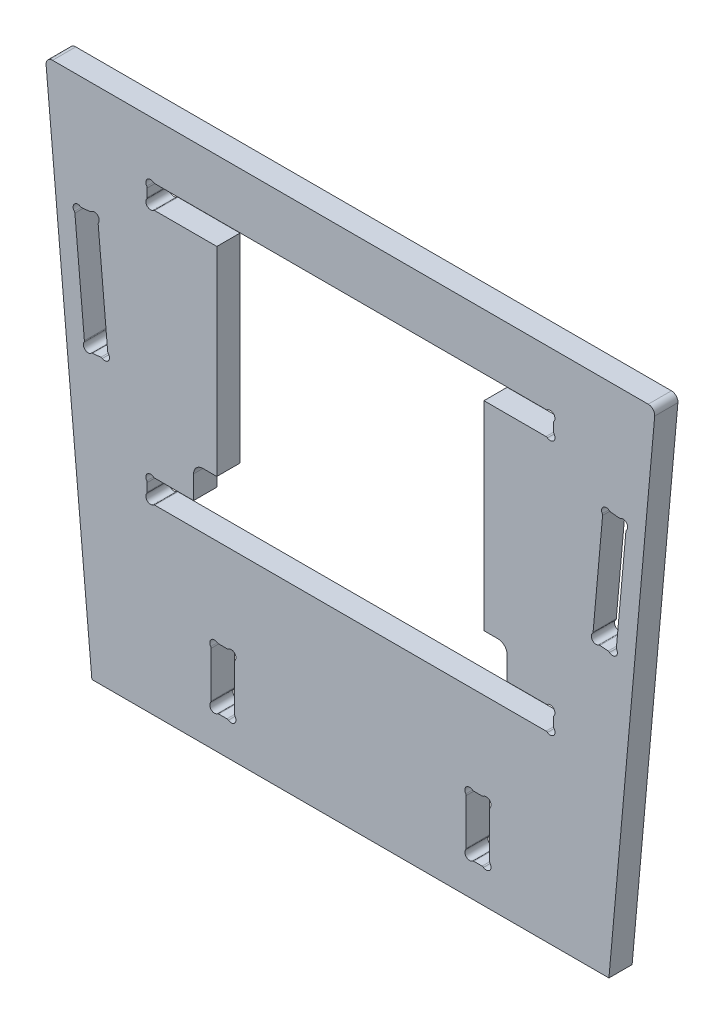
ISO-10303-21;
HEADER;
FILE_DESCRIPTION(('STEP AP214'),'2;1');
FILE_NAME('part.step','',(''),(''),'','','');
FILE_SCHEMA(('AUTOMOTIVE_DESIGN { 1 0 10303 214 1 1 1 1 }'));
ENDSEC;
DATA;
#1=APPLICATION_CONTEXT('core data for automotive mechanical design processes');
#2=APPLICATION_PROTOCOL_DEFINITION('international standard','automotive_design',2000,#1);
#3=PRODUCT_CONTEXT('',#1,'mechanical');
#4=PRODUCT('Part','Part','',(#3));
#5=PRODUCT_RELATED_PRODUCT_CATEGORY('part','',(#4));
#6=PRODUCT_DEFINITION_FORMATION('','',#4);
#7=PRODUCT_DEFINITION_CONTEXT('part definition',#1,'design');
#8=PRODUCT_DEFINITION('design','',#6,#7);
#9=PRODUCT_DEFINITION_SHAPE('','',#8);
#10=(LENGTH_UNIT() NAMED_UNIT(*) SI_UNIT(.MILLI.,.METRE.));
#11=(NAMED_UNIT(*) PLANE_ANGLE_UNIT() SI_UNIT($,.RADIAN.));
#12=(NAMED_UNIT(*) SI_UNIT($,.STERADIAN.) SOLID_ANGLE_UNIT());
#13=UNCERTAINTY_MEASURE_WITH_UNIT(LENGTH_MEASURE(1.E-05),#10,'distance_accuracy_value','');
#14=(GEOMETRIC_REPRESENTATION_CONTEXT(3) GLOBAL_UNCERTAINTY_ASSIGNED_CONTEXT((#13)) GLOBAL_UNIT_ASSIGNED_CONTEXT((#10,
#11,#12)) REPRESENTATION_CONTEXT('',''));
#15=CARTESIAN_POINT('',(0.,0.,0.));
#16=DIRECTION('',(0.,0.,1.));
#17=DIRECTION('',(1.,0.,0.));
#18=AXIS2_PLACEMENT_3D('',#15,#16,#17);
#19=CARTESIAN_POINT('',(67.7473391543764,499.,25.));
#20=DIRECTION('',(0.,0.,1.));
#21=DIRECTION('',(1.,0.,0.));
#22=AXIS2_PLACEMENT_3D('',#19,#20,#21);
#23=PLANE('',#22);
#24=DIRECTION('',(-1.,0.,0.));
#25=VECTOR('',#24,1.);
#26=CARTESIAN_POINT('',(278.5,0.,25.));
#27=LINE('',#26,#25);
#28=CARTESIAN_POINT('',(557.,0.,25.));
#29=VERTEX_POINT('',#28);
#30=CARTESIAN_POINT('',(0.,0.,25.));
#31=VERTEX_POINT('',#30);
#32=EDGE_CURVE('E1400',#29,#31,#27,.T.);
#33=ORIENTED_EDGE('',*,*,#32,.F.);
#34=DIRECTION('',(0.0894867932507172,0.99598800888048,0.));
#35=VECTOR('',#34,1.);
#36=CARTESIAN_POINT('',(557.,0.,25.));
#37=LINE('',#36,#35);
#38=CARTESIAN_POINT('',(606.314788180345,548.873592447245,25.));
#39=VERTEX_POINT('',#38);
#40=EDGE_CURVE('E986',#29,#39,#37,.T.);
#41=ORIENTED_EDGE('',*,*,#40,.T.);
#42=CARTESIAN_POINT('',(599.342872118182,549.5,25.));
#43=DIRECTION('',(0.,0.,-1.));
#44=DIRECTION('',(-1.,0.,0.));
#45=AXIS2_PLACEMENT_3D('',#42,#43,#44);
#46=CIRCLE('',#45,7.);
#47=CARTESIAN_POINT('',(599.342872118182,556.5,25.));
#48=VERTEX_POINT('',#47);
#49=EDGE_CURVE('E1166',#48,#39,#46,.T.);
#50=ORIENTED_EDGE('',*,*,#49,.F.);
#51=DIRECTION('',(1.,0.,0.));
#52=VECTOR('',#51,1.);
#53=CARTESIAN_POINT('',(-50.0000000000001,556.5,25.));
#54=LINE('',#53,#52);
#55=CARTESIAN_POINT('',(-42.3428721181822,556.5,25.));
#56=VERTEX_POINT('',#55);
#57=EDGE_CURVE('E1407',#56,#48,#54,.T.);
#58=ORIENTED_EDGE('',*,*,#57,.F.);
#59=CARTESIAN_POINT('',(-42.3428721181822,549.5,25.));
#60=DIRECTION('',(0.,0.,1.));
#61=DIRECTION('',(1.,0.,0.));
#62=AXIS2_PLACEMENT_3D('',#59,#60,#61);
#63=CIRCLE('',#62,7.);
#64=CARTESIAN_POINT('',(-49.3147881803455,548.873592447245,25.));
#65=VERTEX_POINT('',#64);
#66=EDGE_CURVE('E11',#56,#65,#63,.T.);
#67=ORIENTED_EDGE('',*,*,#66,.T.);
#68=DIRECTION('',(-0.0894867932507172,0.99598800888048,0.));
#69=VECTOR('',#68,1.);
#70=CARTESIAN_POINT('',(0.,0.,25.));
#71=LINE('',#70,#69);
#72=EDGE_CURVE('E1403',#31,#65,#71,.T.);
#73=ORIENTED_EDGE('',*,*,#72,.F.);
#74=EDGE_LOOP('',(#33,#41,#50,#58,#67,#73));
#75=FACE_BOUND('',#74,.T.);
#76=CARTESIAN_POINT('',(489.252660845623,194.,25.));
#77=DIRECTION('',(0.,0.,1.));
#78=DIRECTION('',(1.,0.,0.));
#79=AXIS2_PLACEMENT_3D('',#76,#77,#78);
#80=CIRCLE('',#79,2.50000000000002);
#81=CARTESIAN_POINT('',(490.741080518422,196.008633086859,25.));
#82=VERTEX_POINT('',#81);
#83=CARTESIAN_POINT('',(489.252660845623,196.5,25.));
#84=VERTEX_POINT('',#83);
#85=EDGE_CURVE('E1047',#82,#84,#80,.T.);
#86=ORIENTED_EDGE('',*,*,#85,.T.);
#87=DIRECTION('',(-1.,0.,0.));
#88=VECTOR('',#87,1.);
#89=CARTESIAN_POINT('',(278.5,196.5,25.));
#90=LINE('',#89,#88);
#91=CARTESIAN_POINT('',(67.7473391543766,196.5,25.));
#92=VERTEX_POINT('',#91);
#93=EDGE_CURVE('E1465',#84,#92,#90,.T.);
#94=ORIENTED_EDGE('',*,*,#93,.T.);
#95=CARTESIAN_POINT('',(67.7473391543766,194.,25.));
#96=DIRECTION('',(0.,0.,-1.));
#97=DIRECTION('',(-1.,0.,0.));
#98=AXIS2_PLACEMENT_3D('',#95,#96,#97);
#99=CIRCLE('',#98,2.50000000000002);
#100=CARTESIAN_POINT('',(66.2589194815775,196.008633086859,25.));
#101=VERTEX_POINT('',#100);
#102=EDGE_CURVE('E1462',#101,#92,#99,.T.);
#103=ORIENTED_EDGE('',*,*,#102,.F.);
#104=CARTESIAN_POINT('',(63.2225433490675,200.106244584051,25.));
#105=DIRECTION('',(0.,0.,-1.));
#106=DIRECTION('',(-1.,0.,0.));
#107=AXIS2_PLACEMENT_3D('',#104,#105,#106);
#108=CIRCLE('',#107,5.09999999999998);
#109=CARTESIAN_POINT('',(59.1249318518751,203.142620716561,25.));
#110=VERTEX_POINT('',#109);
#111=EDGE_CURVE('E1460',#101,#110,#108,.T.);
#112=ORIENTED_EDGE('',*,*,#111,.T.);
#113=CARTESIAN_POINT('',(57.1162987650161,204.63104038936,25.));
#114=DIRECTION('',(0.,0.,1.));
#115=DIRECTION('',(1.,0.,0.));
#116=AXIS2_PLACEMENT_3D('',#113,#114,#115);
#117=CIRCLE('',#116,2.50000000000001);
#118=CARTESIAN_POINT('',(59.6162987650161,204.63104038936,25.));
#119=VERTEX_POINT('',#118);
#120=EDGE_CURVE('E1458',#110,#119,#117,.T.);
#121=ORIENTED_EDGE('',*,*,#120,.T.);
#122=DIRECTION('',(0.,-1.,0.));
#123=VECTOR('',#122,1.);
#124=CARTESIAN_POINT('',(59.6162987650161,213.568959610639,25.));
#125=LINE('',#124,#123);
#126=CARTESIAN_POINT('',(59.6162987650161,213.568959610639,25.));
#127=VERTEX_POINT('',#126);
#128=EDGE_CURVE('E1455',#127,#119,#125,.T.);
#129=ORIENTED_EDGE('',*,*,#128,.F.);
#130=CARTESIAN_POINT('',(57.1162987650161,213.568959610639,25.));
#131=DIRECTION('',(0.,0.,-1.));
#132=DIRECTION('',(-1.,0.,0.));
#133=AXIS2_PLACEMENT_3D('',#130,#131,#132);
#134=CIRCLE('',#133,2.50000000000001);
#135=CARTESIAN_POINT('',(59.1249318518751,215.057379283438,25.));
#136=VERTEX_POINT('',#135);
#137=EDGE_CURVE('E1452',#136,#127,#134,.T.);
#138=ORIENTED_EDGE('',*,*,#137,.F.);
#139=CARTESIAN_POINT('',(63.2225433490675,218.093755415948,25.));
#140=DIRECTION('',(0.,0.,1.));
#141=DIRECTION('',(1.,0.,0.));
#142=AXIS2_PLACEMENT_3D('',#139,#140,#141);
#143=CIRCLE('',#142,5.09999999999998);
#144=CARTESIAN_POINT('',(66.2589194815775,222.191366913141,25.));
#145=VERTEX_POINT('',#144);
#146=EDGE_CURVE('E1449',#145,#136,#143,.T.);
#147=ORIENTED_EDGE('',*,*,#146,.F.);
#148=CARTESIAN_POINT('',(67.7473391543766,224.2,25.));
#149=DIRECTION('',(0.,0.,1.));
#150=DIRECTION('',(1.,0.,0.));
#151=AXIS2_PLACEMENT_3D('',#148,#149,#150);
#152=CIRCLE('',#151,2.50000000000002);
#153=CARTESIAN_POINT('',(67.7473391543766,221.7,25.));
#154=VERTEX_POINT('',#153);
#155=EDGE_CURVE('E1447',#145,#154,#152,.T.);
#156=ORIENTED_EDGE('',*,*,#155,.T.);
#157=DIRECTION('',(-1.,0.,0.));
#158=VECTOR('',#157,1.);
#159=CARTESIAN_POINT('',(109.616298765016,221.7,25.));
#160=LINE('',#159,#158);
#161=CARTESIAN_POINT('',(109.616298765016,221.7,25.));
#162=VERTEX_POINT('',#161);
#163=EDGE_CURVE('E1444',#162,#154,#160,.T.);
#164=ORIENTED_EDGE('',*,*,#163,.F.);
#165=DIRECTION('',(0.,-1.,0.));
#166=VECTOR('',#165,1.);
#167=CARTESIAN_POINT('',(109.616298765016,246.7,25.));
#168=LINE('',#167,#166);
#169=CARTESIAN_POINT('',(109.616298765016,246.7,25.));
#170=VERTEX_POINT('',#169);
#171=EDGE_CURVE('E1441',#170,#162,#168,.T.);
#172=ORIENTED_EDGE('',*,*,#171,.F.);
#173=CARTESIAN_POINT('',(119.616298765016,246.7,25.));
#174=DIRECTION('',(0.,0.,1.));
#175=DIRECTION('',(1.,0.,0.));
#176=AXIS2_PLACEMENT_3D('',#173,#174,#175);
#177=CIRCLE('',#176,10.);
#178=CARTESIAN_POINT('',(119.616298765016,256.7,25.));
#179=VERTEX_POINT('',#178);
#180=EDGE_CURVE('E1438',#179,#170,#177,.T.);
#181=ORIENTED_EDGE('',*,*,#180,.F.);
#182=DIRECTION('',(-1.,0.,0.));
#183=VECTOR('',#182,1.);
#184=CARTESIAN_POINT('',(134.616298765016,256.7,25.));
#185=LINE('',#184,#183);
#186=CARTESIAN_POINT('',(134.616298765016,256.7,25.));
#187=VERTEX_POINT('',#186);
#188=EDGE_CURVE('E1435',#187,#179,#185,.T.);
#189=ORIENTED_EDGE('',*,*,#188,.F.);
#190=DIRECTION('',(0.,-1.,0.));
#191=VECTOR('',#190,1.);
#192=CARTESIAN_POINT('',(134.616298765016,471.3,25.));
#193=LINE('',#192,#191);
#194=CARTESIAN_POINT('',(134.616298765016,471.3,25.));
#195=VERTEX_POINT('',#194);
#196=EDGE_CURVE('E1432',#195,#187,#193,.T.);
#197=ORIENTED_EDGE('',*,*,#196,.F.);
#198=DIRECTION('',(-1.,0.,0.));
#199=VECTOR('',#198,1.);
#200=CARTESIAN_POINT('',(134.616298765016,471.3,25.));
#201=LINE('',#200,#199);
#202=CARTESIAN_POINT('',(67.7473391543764,471.3,25.));
#203=VERTEX_POINT('',#202);
#204=EDGE_CURVE('E1430',#195,#203,#201,.T.);
#205=ORIENTED_EDGE('',*,*,#204,.T.);
#206=CARTESIAN_POINT('',(67.7473391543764,468.8,25.));
#207=DIRECTION('',(0.,0.,-1.));
#208=DIRECTION('',(-1.,0.,0.));
#209=AXIS2_PLACEMENT_3D('',#206,#207,#208);
#210=CIRCLE('',#209,2.49999999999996);
#211=CARTESIAN_POINT('',(66.2589194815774,470.808633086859,25.));
#212=VERTEX_POINT('',#211);
#213=EDGE_CURVE('E1427',#212,#203,#210,.T.);
#214=ORIENTED_EDGE('',*,*,#213,.F.);
#215=CARTESIAN_POINT('',(63.2225433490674,474.906244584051,25.));
#216=DIRECTION('',(0.,0.,-1.));
#217=DIRECTION('',(-1.,0.,0.));
#218=AXIS2_PLACEMENT_3D('',#215,#216,#217);
#219=CIRCLE('',#218,5.09999999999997);
#220=CARTESIAN_POINT('',(59.124931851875,477.942620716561,25.));
#221=VERTEX_POINT('',#220);
#222=EDGE_CURVE('E1425',#212,#221,#219,.T.);
#223=ORIENTED_EDGE('',*,*,#222,.T.);
#224=CARTESIAN_POINT('',(57.116298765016,479.43104038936,25.));
#225=DIRECTION('',(0.,0.,1.));
#226=DIRECTION('',(1.,0.,0.));
#227=AXIS2_PLACEMENT_3D('',#224,#225,#226);
#228=CIRCLE('',#227,2.50000000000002);
#229=CARTESIAN_POINT('',(59.616298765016,479.43104038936,25.));
#230=VERTEX_POINT('',#229);
#231=EDGE_CURVE('E1423',#221,#230,#228,.T.);
#232=ORIENTED_EDGE('',*,*,#231,.T.);
#233=DIRECTION('',(0.,-1.,0.));
#234=VECTOR('',#233,1.);
#235=CARTESIAN_POINT('',(59.616298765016,488.368959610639,25.));
#236=LINE('',#235,#234);
#237=CARTESIAN_POINT('',(59.616298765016,488.368959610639,25.));
#238=VERTEX_POINT('',#237);
#239=EDGE_CURVE('E1420',#238,#230,#236,.T.);
#240=ORIENTED_EDGE('',*,*,#239,.F.);
#241=CARTESIAN_POINT('',(57.116298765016,488.368959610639,25.));
#242=DIRECTION('',(0.,0.,-1.));
#243=DIRECTION('',(-1.,0.,0.));
#244=AXIS2_PLACEMENT_3D('',#241,#242,#243);
#245=CIRCLE('',#244,2.50000000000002);
#246=CARTESIAN_POINT('',(59.124931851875,489.857379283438,25.));
#247=VERTEX_POINT('',#246);
#248=EDGE_CURVE('E1417',#247,#238,#245,.T.);
#249=ORIENTED_EDGE('',*,*,#248,.F.);
#250=CARTESIAN_POINT('',(63.2225433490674,492.893755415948,25.));
#251=DIRECTION('',(0.,0.,1.));
#252=DIRECTION('',(1.,0.,0.));
#253=AXIS2_PLACEMENT_3D('',#250,#251,#252);
#254=CIRCLE('',#253,5.09999999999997);
#255=CARTESIAN_POINT('',(66.2589194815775,496.991366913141,25.));
#256=VERTEX_POINT('',#255);
#257=EDGE_CURVE('E1414',#256,#247,#254,.T.);
#258=ORIENTED_EDGE('',*,*,#257,.F.);
#259=CARTESIAN_POINT('',(67.7473391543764,499.,25.));
#260=DIRECTION('',(0.,0.,1.));
#261=DIRECTION('',(1.,0.,0.));
#262=AXIS2_PLACEMENT_3D('',#259,#260,#261);
#263=CIRCLE('',#262,2.49999999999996);
#264=CARTESIAN_POINT('',(67.7473391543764,496.5,25.));
#265=VERTEX_POINT('',#264);
#266=EDGE_CURVE('E1412',#256,#265,#263,.T.);
#267=ORIENTED_EDGE('',*,*,#266,.T.);
#268=DIRECTION('',(-1.,0.,0.));
#269=VECTOR('',#268,1.);
#270=CARTESIAN_POINT('',(278.5,496.5,25.));
#271=LINE('',#270,#269);
#272=CARTESIAN_POINT('',(489.252660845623,496.5,25.));
#273=VERTEX_POINT('',#272);
#274=EDGE_CURVE('E1409',#273,#265,#271,.T.);
#275=ORIENTED_EDGE('',*,*,#274,.F.);
#276=CARTESIAN_POINT('',(489.252660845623,499.,25.));
#277=DIRECTION('',(0.,0.,-1.));
#278=DIRECTION('',(-1.,0.,0.));
#279=AXIS2_PLACEMENT_3D('',#276,#277,#278);
#280=CIRCLE('',#279,2.49999999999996);
#281=CARTESIAN_POINT('',(490.741080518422,496.991366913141,25.));
#282=VERTEX_POINT('',#281);
#283=EDGE_CURVE('E989',#282,#273,#280,.T.);
#284=ORIENTED_EDGE('',*,*,#283,.F.);
#285=CARTESIAN_POINT('',(493.777456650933,492.893755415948,25.));
#286=DIRECTION('',(0.,0.,-1.));
#287=DIRECTION('',(-1.,0.,0.));
#288=AXIS2_PLACEMENT_3D('',#285,#286,#287);
#289=CIRCLE('',#288,5.09999999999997);
#290=CARTESIAN_POINT('',(497.875068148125,489.857379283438,25.));
#291=VERTEX_POINT('',#290);
#292=EDGE_CURVE('E993',#282,#291,#289,.T.);
#293=ORIENTED_EDGE('',*,*,#292,.T.);
#294=CARTESIAN_POINT('',(499.883701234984,488.368959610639,25.));
#295=DIRECTION('',(0.,0.,1.));
#296=DIRECTION('',(1.,0.,0.));
#297=AXIS2_PLACEMENT_3D('',#294,#295,#296);
#298=CIRCLE('',#297,2.50000000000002);
#299=CARTESIAN_POINT('',(497.383701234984,488.368959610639,25.));
#300=VERTEX_POINT('',#299);
#301=EDGE_CURVE('E996',#291,#300,#298,.T.);
#302=ORIENTED_EDGE('',*,*,#301,.T.);
#303=DIRECTION('',(0.,-1.,0.));
#304=VECTOR('',#303,1.);
#305=CARTESIAN_POINT('',(497.383701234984,488.368959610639,25.));
#306=LINE('',#305,#304);
#307=CARTESIAN_POINT('',(497.383701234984,479.43104038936,25.));
#308=VERTEX_POINT('',#307);
#309=EDGE_CURVE('E999',#300,#308,#306,.T.);
#310=ORIENTED_EDGE('',*,*,#309,.T.);
#311=CARTESIAN_POINT('',(499.883701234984,479.43104038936,25.));
#312=DIRECTION('',(0.,0.,-1.));
#313=DIRECTION('',(-1.,0.,0.));
#314=AXIS2_PLACEMENT_3D('',#311,#312,#313);
#315=CIRCLE('',#314,2.50000000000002);
#316=CARTESIAN_POINT('',(497.875068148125,477.942620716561,25.));
#317=VERTEX_POINT('',#316);
#318=EDGE_CURVE('E1002',#317,#308,#315,.T.);
#319=ORIENTED_EDGE('',*,*,#318,.F.);
#320=CARTESIAN_POINT('',(493.777456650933,474.906244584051,25.));
#321=DIRECTION('',(0.,0.,1.));
#322=DIRECTION('',(1.,0.,0.));
#323=AXIS2_PLACEMENT_3D('',#320,#321,#322);
#324=CIRCLE('',#323,5.09999999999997);
#325=CARTESIAN_POINT('',(490.741080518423,470.808633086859,25.));
#326=VERTEX_POINT('',#325);
#327=EDGE_CURVE('E1005',#326,#317,#324,.T.);
#328=ORIENTED_EDGE('',*,*,#327,.F.);
#329=CARTESIAN_POINT('',(489.252660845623,468.8,25.));
#330=DIRECTION('',(0.,0.,1.));
#331=DIRECTION('',(1.,0.,0.));
#332=AXIS2_PLACEMENT_3D('',#329,#330,#331);
#333=CIRCLE('',#332,2.49999999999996);
#334=CARTESIAN_POINT('',(489.252660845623,471.3,25.));
#335=VERTEX_POINT('',#334);
#336=EDGE_CURVE('E1008',#326,#335,#333,.T.);
#337=ORIENTED_EDGE('',*,*,#336,.T.);
#338=DIRECTION('',(1.,0.,0.));
#339=VECTOR('',#338,1.);
#340=CARTESIAN_POINT('',(422.383701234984,471.3,25.));
#341=LINE('',#340,#339);
#342=CARTESIAN_POINT('',(422.383701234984,471.3,25.));
#343=VERTEX_POINT('',#342);
#344=EDGE_CURVE('E1011',#343,#335,#341,.T.);
#345=ORIENTED_EDGE('',*,*,#344,.F.);
#346=DIRECTION('',(0.,-1.,0.));
#347=VECTOR('',#346,1.);
#348=CARTESIAN_POINT('',(422.383701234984,471.3,25.));
#349=LINE('',#348,#347);
#350=CARTESIAN_POINT('',(422.383701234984,256.7,25.));
#351=VERTEX_POINT('',#350);
#352=EDGE_CURVE('E1014',#343,#351,#349,.T.);
#353=ORIENTED_EDGE('',*,*,#352,.T.);
#354=DIRECTION('',(1.,0.,0.));
#355=VECTOR('',#354,1.);
#356=CARTESIAN_POINT('',(422.383701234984,256.7,25.));
#357=LINE('',#356,#355);
#358=CARTESIAN_POINT('',(437.383701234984,256.7,25.));
#359=VERTEX_POINT('',#358);
#360=EDGE_CURVE('E1017',#351,#359,#357,.T.);
#361=ORIENTED_EDGE('',*,*,#360,.T.);
#362=CARTESIAN_POINT('',(437.383701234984,246.7,25.));
#363=DIRECTION('',(0.,0.,-1.));
#364=DIRECTION('',(-1.,0.,0.));
#365=AXIS2_PLACEMENT_3D('',#362,#363,#364);
#366=CIRCLE('',#365,10.);
#367=CARTESIAN_POINT('',(447.383701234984,246.7,25.));
#368=VERTEX_POINT('',#367);
#369=EDGE_CURVE('E1020',#359,#368,#366,.T.);
#370=ORIENTED_EDGE('',*,*,#369,.T.);
#371=DIRECTION('',(0.,-1.,0.));
#372=VECTOR('',#371,1.);
#373=CARTESIAN_POINT('',(447.383701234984,246.7,25.));
#374=LINE('',#373,#372);
#375=CARTESIAN_POINT('',(447.383701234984,221.7,25.));
#376=VERTEX_POINT('',#375);
#377=EDGE_CURVE('E1023',#368,#376,#374,.T.);
#378=ORIENTED_EDGE('',*,*,#377,.T.);
#379=DIRECTION('',(1.,0.,0.));
#380=VECTOR('',#379,1.);
#381=CARTESIAN_POINT('',(447.383701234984,221.7,25.));
#382=LINE('',#381,#380);
#383=CARTESIAN_POINT('',(489.252660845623,221.7,25.));
#384=VERTEX_POINT('',#383);
#385=EDGE_CURVE('E1026',#376,#384,#382,.T.);
#386=ORIENTED_EDGE('',*,*,#385,.T.);
#387=CARTESIAN_POINT('',(489.252660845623,224.2,25.));
#388=DIRECTION('',(0.,0.,-1.));
#389=DIRECTION('',(-1.,0.,0.));
#390=AXIS2_PLACEMENT_3D('',#387,#388,#389);
#391=CIRCLE('',#390,2.50000000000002);
#392=CARTESIAN_POINT('',(490.741080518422,222.191366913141,25.));
#393=VERTEX_POINT('',#392);
#394=EDGE_CURVE('E1029',#393,#384,#391,.T.);
#395=ORIENTED_EDGE('',*,*,#394,.F.);
#396=CARTESIAN_POINT('',(493.777456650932,218.093755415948,25.));
#397=DIRECTION('',(0.,0.,-1.));
#398=DIRECTION('',(-1.,0.,0.));
#399=AXIS2_PLACEMENT_3D('',#396,#397,#398);
#400=CIRCLE('',#399,5.09999999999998);
#401=CARTESIAN_POINT('',(497.875068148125,215.057379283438,25.));
#402=VERTEX_POINT('',#401);
#403=EDGE_CURVE('E1032',#393,#402,#400,.T.);
#404=ORIENTED_EDGE('',*,*,#403,.T.);
#405=CARTESIAN_POINT('',(499.883701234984,213.568959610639,25.));
#406=DIRECTION('',(0.,0.,1.));
#407=DIRECTION('',(1.,0.,0.));
#408=AXIS2_PLACEMENT_3D('',#405,#406,#407);
#409=CIRCLE('',#408,2.50000000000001);
#410=CARTESIAN_POINT('',(497.383701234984,213.568959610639,25.));
#411=VERTEX_POINT('',#410);
#412=EDGE_CURVE('E1035',#402,#411,#409,.T.);
#413=ORIENTED_EDGE('',*,*,#412,.T.);
#414=DIRECTION('',(0.,-1.,0.));
#415=VECTOR('',#414,1.);
#416=CARTESIAN_POINT('',(497.383701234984,213.568959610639,25.));
#417=LINE('',#416,#415);
#418=CARTESIAN_POINT('',(497.383701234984,204.63104038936,25.));
#419=VERTEX_POINT('',#418);
#420=EDGE_CURVE('E1038',#411,#419,#417,.T.);
#421=ORIENTED_EDGE('',*,*,#420,.T.);
#422=CARTESIAN_POINT('',(499.883701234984,204.63104038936,25.));
#423=DIRECTION('',(0.,0.,-1.));
#424=DIRECTION('',(-1.,0.,0.));
#425=AXIS2_PLACEMENT_3D('',#422,#423,#424);
#426=CIRCLE('',#425,2.50000000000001);
#427=CARTESIAN_POINT('',(497.875068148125,203.142620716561,25.));
#428=VERTEX_POINT('',#427);
#429=EDGE_CURVE('E1041',#428,#419,#426,.T.);
#430=ORIENTED_EDGE('',*,*,#429,.F.);
#431=CARTESIAN_POINT('',(493.777456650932,200.106244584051,25.));
#432=DIRECTION('',(0.,0.,1.));
#433=DIRECTION('',(1.,0.,0.));
#434=AXIS2_PLACEMENT_3D('',#431,#432,#433);
#435=CIRCLE('',#434,5.09999999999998);
#436=EDGE_CURVE('E1044',#82,#428,#435,.T.);
#437=ORIENTED_EDGE('',*,*,#436,.F.);
#438=EDGE_LOOP('',(#86,#94,#103,#112,#121,#129,#138,#147,#156,#164,#172,#181,#189,#197,#205,
#214,#223,#232,#240,#249,#258,#267,#275,#284,#293,#302,#310,#319,#328,#337,#345,#353,#361,#370,
#378,#386,#395,#404,#413,#421,#430,#437));
#439=FACE_BOUND('',#438,.T.);
#440=CARTESIAN_POINT('',(-4.06013192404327,307.867633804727,25.));
#441=DIRECTION('',(0.,0.,1.));
#442=DIRECTION('',(1.,0.,0.));
#443=AXIS2_PLACEMENT_3D('',#440,#441,#442);
#444=CIRCLE('',#443,5.10000000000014);
#445=CARTESIAN_POINT('',(-8.41301940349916,310.525145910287,25.));
#446=VERTEX_POINT('',#445);
#447=CARTESIAN_POINT('',(-0.669255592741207,304.058177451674,25.));
#448=VERTEX_POINT('',#447);
#449=EDGE_CURVE('E1287',#446,#448,#444,.T.);
#450=ORIENTED_EDGE('',*,*,#449,.F.);
#451=CARTESIAN_POINT('',(-10.5467877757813,311.827847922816,25.));
#452=DIRECTION('',(0.,0.,-1.));
#453=DIRECTION('',(1.,0.,0.));
#454=AXIS2_PLACEMENT_3D('',#451,#452,#453);
#455=CIRCLE('',#454,2.49999999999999);
#456=CARTESIAN_POINT('',(-8.05681775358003,312.051564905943,25.));
#457=VERTEX_POINT('',#456);
#458=EDGE_CURVE('E1285',#457,#446,#455,.T.);
#459=ORIENTED_EDGE('',*,*,#458,.F.);
#460=DIRECTION('',(0.0894867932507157,-0.99598800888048,0.));
#461=VECTOR('',#460,1.);
#462=CARTESIAN_POINT('',(-18.2885514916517,425.930761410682,25.));
#463=LINE('',#462,#461);
#464=CARTESIAN_POINT('',(-18.2885514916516,425.930761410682,25.));
#465=VERTEX_POINT('',#464);
#466=EDGE_CURVE('E1317',#465,#457,#463,.T.);
#467=ORIENTED_EDGE('',*,*,#466,.F.);
#468=CARTESIAN_POINT('',(-20.7785215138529,425.707044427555,25.));
#469=DIRECTION('',(0.,0.,-1.));
#470=DIRECTION('',(-1.,0.,0.));
#471=AXIS2_PLACEMENT_3D('',#468,#469,#470);
#472=CIRCLE('',#471,2.49999999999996);
#473=CARTESIAN_POINT('',(-18.9111409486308,427.369238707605,25.));
#474=VERTEX_POINT('',#473);
#475=EDGE_CURVE('E1314',#474,#465,#472,.T.);
#476=ORIENTED_EDGE('',*,*,#475,.F.);
#477=CARTESIAN_POINT('',(-15.1016845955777,430.760115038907,25.));
#478=DIRECTION('',(0.,0.,1.));
#479=DIRECTION('',(-1.,0.,0.));
#480=AXIS2_PLACEMENT_3D('',#477,#478,#479);
#481=CIRCLE('',#480,5.10000000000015);
#482=CARTESIAN_POINT('',(-12.4441724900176,435.113002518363,25.));
#483=VERTEX_POINT('',#482);
#484=EDGE_CURVE('E1312',#483,#474,#481,.T.);
#485=ORIENTED_EDGE('',*,*,#484,.F.);
#486=CARTESIAN_POINT('',(-11.1414704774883,437.246770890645,25.));
#487=DIRECTION('',(0.,0.,-1.));
#488=DIRECTION('',(1.,0.,0.));
#489=AXIS2_PLACEMENT_3D('',#486,#487,#488);
#490=CIRCLE('',#489,2.50000000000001);
#491=CARTESIAN_POINT('',(-10.9177534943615,434.756800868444,25.));
#492=VERTEX_POINT('',#491);
#493=EDGE_CURVE('E1310',#492,#483,#490,.T.);
#494=ORIENTED_EDGE('',*,*,#493,.F.);
#495=DIRECTION('',(-0.99598800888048,-0.0894867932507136,0.));
#496=VECTOR('',#495,1.);
#497=CARTESIAN_POINT('',(-10.9177534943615,434.756800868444,25.));
#498=LINE('',#497,#496);
#499=CARTESIAN_POINT('',(-2.01569312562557,435.55662659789,25.));
#500=VERTEX_POINT('',#499);
#501=EDGE_CURVE('E1308',#500,#492,#498,.T.);
#502=ORIENTED_EDGE('',*,*,#501,.F.);
#503=CARTESIAN_POINT('',(-2.23941010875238,438.046596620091,25.));
#504=DIRECTION('',(0.,0.,-1.));
#505=DIRECTION('',(-1.,0.,0.));
#506=AXIS2_PLACEMENT_3D('',#503,#504,#505);
#507=CIRCLE('',#506,2.50000000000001);
#508=CARTESIAN_POINT('',(-0.577215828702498,436.179216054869,25.));
#509=VERTEX_POINT('',#508);
#510=EDGE_CURVE('E1306',#509,#500,#507,.T.);
#511=ORIENTED_EDGE('',*,*,#510,.F.);
#512=CARTESIAN_POINT('',(2.81366050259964,432.369759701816,25.));
#513=DIRECTION('',(0.,0.,1.));
#514=DIRECTION('',(1.,0.,0.));
#515=AXIS2_PLACEMENT_3D('',#512,#513,#514);
#516=CIRCLE('',#515,5.10000000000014);
#517=CARTESIAN_POINT('',(7.16654798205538,429.712247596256,25.));
#518=VERTEX_POINT('',#517);
#519=EDGE_CURVE('E1304',#518,#509,#516,.T.);
#520=ORIENTED_EDGE('',*,*,#519,.F.);
#521=CARTESIAN_POINT('',(9.30031635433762,428.409545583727,25.));
#522=DIRECTION('',(0.,0.,-1.));
#523=DIRECTION('',(1.,0.,0.));
#524=AXIS2_PLACEMENT_3D('',#521,#522,#523);
#525=CIRCLE('',#524,2.49999999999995);
#526=CARTESIAN_POINT('',(6.81034633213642,428.1858286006,25.));
#527=VERTEX_POINT('',#526);
#528=EDGE_CURVE('E1302',#527,#518,#525,.T.);
#529=ORIENTED_EDGE('',*,*,#528,.F.);
#530=DIRECTION('',(-0.0894867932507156,0.99598800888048,0.));
#531=VECTOR('',#530,1.);
#532=CARTESIAN_POINT('',(6.81034633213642,428.1858286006,25.));
#533=LINE('',#532,#531);
#534=CARTESIAN_POINT('',(17.0420800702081,314.306632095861,25.));
#535=VERTEX_POINT('',#534);
#536=EDGE_CURVE('E1300',#535,#527,#533,.T.);
#537=ORIENTED_EDGE('',*,*,#536,.F.);
#538=CARTESIAN_POINT('',(19.5320500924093,314.530349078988,25.));
#539=DIRECTION('',(0.,0.,-1.));
#540=DIRECTION('',(-1.,0.,0.));
#541=AXIS2_PLACEMENT_3D('',#538,#539,#540);
#542=CIRCLE('',#541,2.49999999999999);
#543=CARTESIAN_POINT('',(17.6646695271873,312.868154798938,25.));
#544=VERTEX_POINT('',#543);
#545=EDGE_CURVE('E1298',#544,#535,#542,.T.);
#546=ORIENTED_EDGE('',*,*,#545,.F.);
#547=CARTESIAN_POINT('',(13.8552131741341,309.477278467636,25.));
#548=DIRECTION('',(0.,0.,1.));
#549=DIRECTION('',(-1.,0.,0.));
#550=AXIS2_PLACEMENT_3D('',#547,#548,#549);
#551=CIRCLE('',#550,5.10000000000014);
#552=CARTESIAN_POINT('',(11.197701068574,305.12439098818,25.));
#553=VERTEX_POINT('',#552);
#554=EDGE_CURVE('E1296',#553,#544,#551,.T.);
#555=ORIENTED_EDGE('',*,*,#554,.F.);
#556=CARTESIAN_POINT('',(9.89499905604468,302.990622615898,25.));
#557=DIRECTION('',(0.,0.,-1.));
#558=DIRECTION('',(1.,0.,0.));
#559=AXIS2_PLACEMENT_3D('',#556,#557,#558);
#560=CIRCLE('',#559,2.49999999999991);
#561=CARTESIAN_POINT('',(9.6712820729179,305.480592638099,25.));
#562=VERTEX_POINT('',#561);
#563=EDGE_CURVE('E1294',#562,#553,#560,.T.);
#564=ORIENTED_EDGE('',*,*,#563,.F.);
#565=DIRECTION('',(0.99598800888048,0.0894867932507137,0.));
#566=VECTOR('',#565,1.);
#567=CARTESIAN_POINT('',(0.769221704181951,304.680766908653,25.));
#568=LINE('',#567,#566);
#569=CARTESIAN_POINT('',(0.769221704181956,304.680766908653,25.));
#570=VERTEX_POINT('',#569);
#571=EDGE_CURVE('E1292',#570,#562,#568,.T.);
#572=ORIENTED_EDGE('',*,*,#571,.F.);
#573=CARTESIAN_POINT('',(0.99293868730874,302.190796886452,25.));
#574=DIRECTION('',(0.,0.,-1.));
#575=DIRECTION('',(-1.,0.,0.));
#576=AXIS2_PLACEMENT_3D('',#573,#574,#575);
#577=CIRCLE('',#576,2.49999999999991);
#578=EDGE_CURVE('E1290',#448,#570,#577,.T.);
#579=ORIENTED_EDGE('',*,*,#578,.F.);
#580=EDGE_LOOP('',(#450,#459,#467,#476,#485,#494,#502,#511,#520,#529,#537,#546,#555,#564,#572,#579));
#581=FACE_BOUND('',#580,.T.);
#582=CARTESIAN_POINT('',(150.093755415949,97.8937554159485,25.));
#583=DIRECTION('',(0.,0.,1.));
#584=DIRECTION('',(1.,0.,0.));
#585=AXIS2_PLACEMENT_3D('',#582,#583,#584);
#586=CIRCLE('',#585,5.1);
#587=CARTESIAN_POINT('',(154.191366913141,94.8573792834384,25.));
#588=VERTEX_POINT('',#587);
#589=CARTESIAN_POINT('',(147.057379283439,101.991366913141,25.));
#590=VERTEX_POINT('',#589);
#591=EDGE_CURVE('E1172',#588,#590,#586,.T.);
#592=ORIENTED_EDGE('',*,*,#591,.F.);
#593=CARTESIAN_POINT('',(156.2,93.3689596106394,25.));
#594=DIRECTION('',(0.,0.,-1.));
#595=DIRECTION('',(1.,0.,0.));
#596=AXIS2_PLACEMENT_3D('',#593,#594,#595);
#597=CIRCLE('',#596,2.50000000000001);
#598=CARTESIAN_POINT('',(153.7,93.3689596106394,25.));
#599=VERTEX_POINT('',#598);
#600=EDGE_CURVE('E1170',#599,#588,#597,.T.);
#601=ORIENTED_EDGE('',*,*,#600,.F.);
#602=DIRECTION('',(0.,1.,0.));
#603=VECTOR('',#602,1.);
#604=CARTESIAN_POINT('',(153.7,44.2310403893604,25.));
#605=LINE('',#604,#603);
#606=CARTESIAN_POINT('',(153.7,44.2310403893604,25.));
#607=VERTEX_POINT('',#606);
#608=EDGE_CURVE('E1202',#607,#599,#605,.T.);
#609=ORIENTED_EDGE('',*,*,#608,.F.);
#610=CARTESIAN_POINT('',(156.2,44.2310403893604,25.));
#611=DIRECTION('',(0.,0.,-1.));
#612=DIRECTION('',(-1.,0.,0.));
#613=AXIS2_PLACEMENT_3D('',#610,#611,#612);
#614=CIRCLE('',#613,2.50000000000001);
#615=CARTESIAN_POINT('',(154.191366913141,42.7426207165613,25.));
#616=VERTEX_POINT('',#615);
#617=EDGE_CURVE('E1199',#616,#607,#614,.T.);
#618=ORIENTED_EDGE('',*,*,#617,.F.);
#619=CARTESIAN_POINT('',(150.093755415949,39.7062445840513,25.));
#620=DIRECTION('',(0.,0.,1.));
#621=DIRECTION('',(-1.,0.,0.));
#622=AXIS2_PLACEMENT_3D('',#619,#620,#621);
#623=CIRCLE('',#622,5.1);
#624=CARTESIAN_POINT('',(147.057379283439,35.6086330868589,25.));
#625=VERTEX_POINT('',#624);
#626=EDGE_CURVE('E1197',#625,#616,#623,.T.);
#627=ORIENTED_EDGE('',*,*,#626,.F.);
#628=CARTESIAN_POINT('',(145.568959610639,33.5999999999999,25.));
#629=DIRECTION('',(0.,0.,-1.));
#630=DIRECTION('',(1.,0.,0.));
#631=AXIS2_PLACEMENT_3D('',#628,#629,#630);
#632=CIRCLE('',#631,2.5);
#633=CARTESIAN_POINT('',(145.568959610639,36.0999999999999,25.));
#634=VERTEX_POINT('',#633);
#635=EDGE_CURVE('E1195',#634,#625,#632,.T.);
#636=ORIENTED_EDGE('',*,*,#635,.F.);
#637=DIRECTION('',(1.,0.,0.));
#638=VECTOR('',#637,1.);
#639=CARTESIAN_POINT('',(145.568959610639,36.0999999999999,25.));
#640=LINE('',#639,#638);
#641=CARTESIAN_POINT('',(136.63104038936,36.0999999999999,25.));
#642=VERTEX_POINT('',#641);
#643=EDGE_CURVE('E1193',#642,#634,#640,.T.);
#644=ORIENTED_EDGE('',*,*,#643,.F.);
#645=CARTESIAN_POINT('',(136.63104038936,33.5999999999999,25.));
#646=DIRECTION('',(0.,0.,-1.));
#647=DIRECTION('',(-1.,0.,0.));
#648=AXIS2_PLACEMENT_3D('',#645,#646,#647);
#649=CIRCLE('',#648,2.5);
#650=CARTESIAN_POINT('',(135.142620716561,35.6086330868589,25.));
#651=VERTEX_POINT('',#650);
#652=EDGE_CURVE('E1191',#651,#642,#649,.T.);
#653=ORIENTED_EDGE('',*,*,#652,.F.);
#654=CARTESIAN_POINT('',(132.106244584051,39.7062445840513,25.));
#655=DIRECTION('',(0.,0.,1.));
#656=DIRECTION('',(1.,0.,0.));
#657=AXIS2_PLACEMENT_3D('',#654,#655,#656);
#658=CIRCLE('',#657,5.1);
#659=CARTESIAN_POINT('',(128.008633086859,42.7426207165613,25.));
#660=VERTEX_POINT('',#659);
#661=EDGE_CURVE('E1189',#660,#651,#658,.T.);
#662=ORIENTED_EDGE('',*,*,#661,.F.);
#663=CARTESIAN_POINT('',(126.,44.2310403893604,25.));
#664=DIRECTION('',(0.,0.,-1.));
#665=DIRECTION('',(1.,0.,0.));
#666=AXIS2_PLACEMENT_3D('',#663,#664,#665);
#667=CIRCLE('',#666,2.50000000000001);
#668=CARTESIAN_POINT('',(128.5,44.2310403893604,25.));
#669=VERTEX_POINT('',#668);
#670=EDGE_CURVE('E1187',#669,#660,#667,.T.);
#671=ORIENTED_EDGE('',*,*,#670,.F.);
#672=DIRECTION('',(0.,-1.,0.));
#673=VECTOR('',#672,1.);
#674=CARTESIAN_POINT('',(128.5,44.2310403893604,25.));
#675=LINE('',#674,#673);
#676=CARTESIAN_POINT('',(128.5,93.3689596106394,25.));
#677=VERTEX_POINT('',#676);
#678=EDGE_CURVE('E1185',#677,#669,#675,.T.);
#679=ORIENTED_EDGE('',*,*,#678,.F.);
#680=CARTESIAN_POINT('',(126.,93.3689596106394,25.));
#681=DIRECTION('',(0.,0.,-1.));
#682=DIRECTION('',(-1.,0.,0.));
#683=AXIS2_PLACEMENT_3D('',#680,#681,#682);
#684=CIRCLE('',#683,2.50000000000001);
#685=CARTESIAN_POINT('',(128.008633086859,94.8573792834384,25.));
#686=VERTEX_POINT('',#685);
#687=EDGE_CURVE('E1183',#686,#677,#684,.T.);
#688=ORIENTED_EDGE('',*,*,#687,.F.);
#689=CARTESIAN_POINT('',(132.106244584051,97.8937554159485,25.));
#690=DIRECTION('',(0.,0.,1.));
#691=DIRECTION('',(-1.,0.,0.));
#692=AXIS2_PLACEMENT_3D('',#689,#690,#691);
#693=CIRCLE('',#692,5.1);
#694=CARTESIAN_POINT('',(135.142620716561,101.991366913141,25.));
#695=VERTEX_POINT('',#694);
#696=EDGE_CURVE('E1181',#695,#686,#693,.T.);
#697=ORIENTED_EDGE('',*,*,#696,.F.);
#698=CARTESIAN_POINT('',(136.63104038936,104.,25.));
#699=DIRECTION('',(0.,0.,-1.));
#700=DIRECTION('',(1.,0.,0.));
#701=AXIS2_PLACEMENT_3D('',#698,#699,#700);
#702=CIRCLE('',#701,2.5);
#703=CARTESIAN_POINT('',(136.63104038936,101.5,25.));
#704=VERTEX_POINT('',#703);
#705=EDGE_CURVE('E1179',#704,#695,#702,.T.);
#706=ORIENTED_EDGE('',*,*,#705,.F.);
#707=DIRECTION('',(-1.,0.,0.));
#708=VECTOR('',#707,1.);
#709=CARTESIAN_POINT('',(145.568959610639,101.5,25.));
#710=LINE('',#709,#708);
#711=CARTESIAN_POINT('',(145.568959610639,101.5,25.));
#712=VERTEX_POINT('',#711);
#713=EDGE_CURVE('E1177',#712,#704,#710,.T.);
#714=ORIENTED_EDGE('',*,*,#713,.F.);
#715=CARTESIAN_POINT('',(145.568959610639,104.,25.));
#716=DIRECTION('',(0.,0.,-1.));
#717=DIRECTION('',(-1.,0.,0.));
#718=AXIS2_PLACEMENT_3D('',#715,#716,#717);
#719=CIRCLE('',#718,2.5);
#720=EDGE_CURVE('E1175',#590,#712,#719,.T.);
#721=ORIENTED_EDGE('',*,*,#720,.F.);
#722=EDGE_LOOP('',(#592,#601,#609,#618,#627,#636,#644,#653,#662,#671,#679,#688,#697,#706,#714,#721));
#723=FACE_BOUND('',#722,.T.);
#724=CARTESIAN_POINT('',(561.060131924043,307.867633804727,25.));
#725=DIRECTION('',(0.,0.,-1.));
#726=DIRECTION('',(-1.,0.,0.));
#727=AXIS2_PLACEMENT_3D('',#724,#725,#726);
#728=CIRCLE('',#727,5.10000000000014);
#729=CARTESIAN_POINT('',(565.413019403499,310.525145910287,25.));
#730=VERTEX_POINT('',#729);
#731=CARTESIAN_POINT('',(557.669255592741,304.058177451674,25.));
#732=VERTEX_POINT('',#731);
#733=EDGE_CURVE('E861',#730,#732,#728,.T.);
#734=ORIENTED_EDGE('',*,*,#733,.T.);
#735=CARTESIAN_POINT('',(556.007061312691,302.190796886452,25.));
#736=DIRECTION('',(0.,0.,1.));
#737=DIRECTION('',(1.,0.,0.));
#738=AXIS2_PLACEMENT_3D('',#735,#736,#737);
#739=CIRCLE('',#738,2.49999999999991);
#740=CARTESIAN_POINT('',(556.230778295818,304.680766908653,25.));
#741=VERTEX_POINT('',#740);
#742=EDGE_CURVE('E865',#732,#741,#739,.T.);
#743=ORIENTED_EDGE('',*,*,#742,.T.);
#744=DIRECTION('',(-0.99598800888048,0.0894867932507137,0.));
#745=VECTOR('',#744,1.);
#746=CARTESIAN_POINT('',(556.230778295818,304.680766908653,25.));
#747=LINE('',#746,#745);
#748=CARTESIAN_POINT('',(547.328717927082,305.480592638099,25.));
#749=VERTEX_POINT('',#748);
#750=EDGE_CURVE('E868',#741,#749,#747,.T.);
#751=ORIENTED_EDGE('',*,*,#750,.T.);
#752=CARTESIAN_POINT('',(547.105000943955,302.990622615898,25.));
#753=DIRECTION('',(0.,0.,1.));
#754=DIRECTION('',(-1.,0.,0.));
#755=AXIS2_PLACEMENT_3D('',#752,#753,#754);
#756=CIRCLE('',#755,2.49999999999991);
#757=CARTESIAN_POINT('',(545.802298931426,305.12439098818,25.));
#758=VERTEX_POINT('',#757);
#759=EDGE_CURVE('E871',#749,#758,#756,.T.);
#760=ORIENTED_EDGE('',*,*,#759,.T.);
#761=CARTESIAN_POINT('',(543.144786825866,309.477278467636,25.));
#762=DIRECTION('',(0.,0.,-1.));
#763=DIRECTION('',(1.,0.,0.));
#764=AXIS2_PLACEMENT_3D('',#761,#762,#763);
#765=CIRCLE('',#764,5.10000000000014);
#766=CARTESIAN_POINT('',(539.335330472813,312.868154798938,25.));
#767=VERTEX_POINT('',#766);
#768=EDGE_CURVE('E874',#758,#767,#765,.T.);
#769=ORIENTED_EDGE('',*,*,#768,.T.);
#770=CARTESIAN_POINT('',(537.467949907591,314.530349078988,25.));
#771=DIRECTION('',(0.,0.,1.));
#772=DIRECTION('',(1.,0.,0.));
#773=AXIS2_PLACEMENT_3D('',#770,#771,#772);
#774=CIRCLE('',#773,2.49999999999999);
#775=CARTESIAN_POINT('',(539.957919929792,314.306632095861,25.));
#776=VERTEX_POINT('',#775);
#777=EDGE_CURVE('E877',#767,#776,#774,.T.);
#778=ORIENTED_EDGE('',*,*,#777,.T.);
#779=DIRECTION('',(0.0894867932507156,0.99598800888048,0.));
#780=VECTOR('',#779,1.);
#781=CARTESIAN_POINT('',(550.189653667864,428.1858286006,25.));
#782=LINE('',#781,#780);
#783=CARTESIAN_POINT('',(550.189653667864,428.1858286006,25.));
#784=VERTEX_POINT('',#783);
#785=EDGE_CURVE('E880',#776,#784,#782,.T.);
#786=ORIENTED_EDGE('',*,*,#785,.T.);
#787=CARTESIAN_POINT('',(547.699683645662,428.409545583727,25.));
#788=DIRECTION('',(0.,0.,1.));
#789=DIRECTION('',(-1.,0.,0.));
#790=AXIS2_PLACEMENT_3D('',#787,#788,#789);
#791=CIRCLE('',#790,2.49999999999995);
#792=CARTESIAN_POINT('',(549.833452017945,429.712247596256,25.));
#793=VERTEX_POINT('',#792);
#794=EDGE_CURVE('E883',#784,#793,#791,.T.);
#795=ORIENTED_EDGE('',*,*,#794,.T.);
#796=CARTESIAN_POINT('',(554.1863394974,432.369759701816,25.));
#797=DIRECTION('',(0.,0.,-1.));
#798=DIRECTION('',(-1.,0.,0.));
#799=AXIS2_PLACEMENT_3D('',#796,#797,#798);
#800=CIRCLE('',#799,5.10000000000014);
#801=CARTESIAN_POINT('',(557.577215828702,436.179216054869,25.));
#802=VERTEX_POINT('',#801);
#803=EDGE_CURVE('E886',#793,#802,#800,.T.);
#804=ORIENTED_EDGE('',*,*,#803,.T.);
#805=CARTESIAN_POINT('',(559.239410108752,438.046596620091,25.));
#806=DIRECTION('',(0.,0.,1.));
#807=DIRECTION('',(1.,0.,0.));
#808=AXIS2_PLACEMENT_3D('',#805,#806,#807);
#809=CIRCLE('',#808,2.50000000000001);
#810=CARTESIAN_POINT('',(559.015693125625,435.55662659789,25.));
#811=VERTEX_POINT('',#810);
#812=EDGE_CURVE('E889',#802,#811,#809,.T.);
#813=ORIENTED_EDGE('',*,*,#812,.T.);
#814=DIRECTION('',(0.99598800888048,-0.0894867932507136,0.));
#815=VECTOR('',#814,1.);
#816=CARTESIAN_POINT('',(567.917753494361,434.756800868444,25.));
#817=LINE('',#816,#815);
#818=CARTESIAN_POINT('',(567.917753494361,434.756800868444,25.));
#819=VERTEX_POINT('',#818);
#820=EDGE_CURVE('E892',#811,#819,#817,.T.);
#821=ORIENTED_EDGE('',*,*,#820,.T.);
#822=CARTESIAN_POINT('',(568.141470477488,437.246770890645,25.));
#823=DIRECTION('',(0.,0.,1.));
#824=DIRECTION('',(-1.,0.,0.));
#825=AXIS2_PLACEMENT_3D('',#822,#823,#824);
#826=CIRCLE('',#825,2.50000000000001);
#827=CARTESIAN_POINT('',(569.444172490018,435.113002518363,25.));
#828=VERTEX_POINT('',#827);
#829=EDGE_CURVE('E895',#819,#828,#826,.T.);
#830=ORIENTED_EDGE('',*,*,#829,.T.);
#831=CARTESIAN_POINT('',(572.101684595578,430.760115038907,25.));
#832=DIRECTION('',(0.,0.,-1.));
#833=DIRECTION('',(1.,0.,0.));
#834=AXIS2_PLACEMENT_3D('',#831,#832,#833);
#835=CIRCLE('',#834,5.10000000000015);
#836=CARTESIAN_POINT('',(575.911140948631,427.369238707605,25.));
#837=VERTEX_POINT('',#836);
#838=EDGE_CURVE('E898',#828,#837,#835,.T.);
#839=ORIENTED_EDGE('',*,*,#838,.T.);
#840=CARTESIAN_POINT('',(577.778521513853,425.707044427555,25.));
#841=DIRECTION('',(0.,0.,1.));
#842=DIRECTION('',(1.,0.,0.));
#843=AXIS2_PLACEMENT_3D('',#840,#841,#842);
#844=CIRCLE('',#843,2.49999999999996);
#845=CARTESIAN_POINT('',(575.288551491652,425.930761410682,25.));
#846=VERTEX_POINT('',#845);
#847=EDGE_CURVE('E901',#837,#846,#844,.T.);
#848=ORIENTED_EDGE('',*,*,#847,.T.);
#849=DIRECTION('',(-0.0894867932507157,-0.99598800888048,0.));
#850=VECTOR('',#849,1.);
#851=CARTESIAN_POINT('',(575.288551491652,425.930761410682,25.));
#852=LINE('',#851,#850);
#853=CARTESIAN_POINT('',(565.05681775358,312.051564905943,25.));
#854=VERTEX_POINT('',#853);
#855=EDGE_CURVE('E904',#846,#854,#852,.T.);
#856=ORIENTED_EDGE('',*,*,#855,.T.);
#857=CARTESIAN_POINT('',(567.546787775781,311.827847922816,25.));
#858=DIRECTION('',(0.,0.,1.));
#859=DIRECTION('',(-1.,0.,0.));
#860=AXIS2_PLACEMENT_3D('',#857,#858,#859);
#861=CIRCLE('',#860,2.49999999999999);
#862=EDGE_CURVE('E858',#854,#730,#861,.T.);
#863=ORIENTED_EDGE('',*,*,#862,.T.);
#864=EDGE_LOOP('',(#734,#743,#751,#760,#769,#778,#786,#795,#804,#813,#821,#830,#839,#848,#856,#863));
#865=FACE_BOUND('',#864,.T.);
#866=CARTESIAN_POINT('',(406.906244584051,97.8937554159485,25.));
#867=DIRECTION('',(0.,0.,-1.));
#868=DIRECTION('',(-1.,0.,0.));
#869=AXIS2_PLACEMENT_3D('',#866,#867,#868);
#870=CIRCLE('',#869,5.1);
#871=CARTESIAN_POINT('',(402.808633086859,94.8573792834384,25.));
#872=VERTEX_POINT('',#871);
#873=CARTESIAN_POINT('',(409.942620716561,101.991366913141,25.));
#874=VERTEX_POINT('',#873);
#875=EDGE_CURVE('E737',#872,#874,#870,.T.);
#876=ORIENTED_EDGE('',*,*,#875,.T.);
#877=CARTESIAN_POINT('',(411.43104038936,104.,25.));
#878=DIRECTION('',(0.,0.,1.));
#879=DIRECTION('',(1.,0.,0.));
#880=AXIS2_PLACEMENT_3D('',#877,#878,#879);
#881=CIRCLE('',#880,2.5);
#882=CARTESIAN_POINT('',(411.43104038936,101.5,25.));
#883=VERTEX_POINT('',#882);
#884=EDGE_CURVE('E745',#874,#883,#881,.T.);
#885=ORIENTED_EDGE('',*,*,#884,.T.);
#886=DIRECTION('',(1.,0.,0.));
#887=VECTOR('',#886,1.);
#888=CARTESIAN_POINT('',(411.43104038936,101.5,25.));
#889=LINE('',#888,#887);
#890=CARTESIAN_POINT('',(420.368959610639,101.5,25.));
#891=VERTEX_POINT('',#890);
#892=EDGE_CURVE('E747',#883,#891,#889,.T.);
#893=ORIENTED_EDGE('',*,*,#892,.T.);
#894=CARTESIAN_POINT('',(420.368959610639,104.,25.));
#895=DIRECTION('',(0.,0.,1.));
#896=DIRECTION('',(-1.,0.,0.));
#897=AXIS2_PLACEMENT_3D('',#894,#895,#896);
#898=CIRCLE('',#897,2.5);
#899=CARTESIAN_POINT('',(421.857379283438,101.991366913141,25.));
#900=VERTEX_POINT('',#899);
#901=EDGE_CURVE('E752',#891,#900,#898,.T.);
#902=ORIENTED_EDGE('',*,*,#901,.T.);
#903=CARTESIAN_POINT('',(424.893755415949,97.8937554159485,25.));
#904=DIRECTION('',(0.,0.,-1.));
#905=DIRECTION('',(1.,0.,0.));
#906=AXIS2_PLACEMENT_3D('',#903,#904,#905);
#907=CIRCLE('',#906,5.1);
#908=CARTESIAN_POINT('',(428.991366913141,94.8573792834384,25.));
#909=VERTEX_POINT('',#908);
#910=EDGE_CURVE('E755',#900,#909,#907,.T.);
#911=ORIENTED_EDGE('',*,*,#910,.T.);
#912=CARTESIAN_POINT('',(431.,93.3689596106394,25.));
#913=DIRECTION('',(0.,0.,1.));
#914=DIRECTION('',(1.,0.,0.));
#915=AXIS2_PLACEMENT_3D('',#912,#913,#914);
#916=CIRCLE('',#915,2.50000000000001);
#917=CARTESIAN_POINT('',(428.5,93.3689596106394,25.));
#918=VERTEX_POINT('',#917);
#919=EDGE_CURVE('E758',#909,#918,#916,.T.);
#920=ORIENTED_EDGE('',*,*,#919,.T.);
#921=DIRECTION('',(0.,-1.,0.));
#922=VECTOR('',#921,1.);
#923=CARTESIAN_POINT('',(428.5,44.2310403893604,25.));
#924=LINE('',#923,#922);
#925=CARTESIAN_POINT('',(428.5,44.2310403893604,25.));
#926=VERTEX_POINT('',#925);
#927=EDGE_CURVE('E761',#918,#926,#924,.T.);
#928=ORIENTED_EDGE('',*,*,#927,.T.);
#929=CARTESIAN_POINT('',(431.,44.2310403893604,25.));
#930=DIRECTION('',(0.,0.,1.));
#931=DIRECTION('',(-1.,0.,0.));
#932=AXIS2_PLACEMENT_3D('',#929,#930,#931);
#933=CIRCLE('',#932,2.50000000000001);
#934=CARTESIAN_POINT('',(428.991366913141,42.7426207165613,25.));
#935=VERTEX_POINT('',#934);
#936=EDGE_CURVE('E764',#926,#935,#933,.T.);
#937=ORIENTED_EDGE('',*,*,#936,.T.);
#938=CARTESIAN_POINT('',(424.893755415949,39.7062445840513,25.));
#939=DIRECTION('',(0.,0.,-1.));
#940=DIRECTION('',(-1.,0.,0.));
#941=AXIS2_PLACEMENT_3D('',#938,#939,#940);
#942=CIRCLE('',#941,5.1);
#943=CARTESIAN_POINT('',(421.857379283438,35.6086330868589,25.));
#944=VERTEX_POINT('',#943);
#945=EDGE_CURVE('E767',#935,#944,#942,.T.);
#946=ORIENTED_EDGE('',*,*,#945,.T.);
#947=CARTESIAN_POINT('',(420.368959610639,33.5999999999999,25.));
#948=DIRECTION('',(0.,0.,1.));
#949=DIRECTION('',(1.,0.,0.));
#950=AXIS2_PLACEMENT_3D('',#947,#948,#949);
#951=CIRCLE('',#950,2.5);
#952=CARTESIAN_POINT('',(420.368959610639,36.0999999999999,25.));
#953=VERTEX_POINT('',#952);
#954=EDGE_CURVE('E770',#944,#953,#951,.T.);
#955=ORIENTED_EDGE('',*,*,#954,.T.);
#956=DIRECTION('',(-1.,0.,0.));
#957=VECTOR('',#956,1.);
#958=CARTESIAN_POINT('',(411.43104038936,36.0999999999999,25.));
#959=LINE('',#958,#957);
#960=CARTESIAN_POINT('',(411.43104038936,36.0999999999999,25.));
#961=VERTEX_POINT('',#960);
#962=EDGE_CURVE('E773',#953,#961,#959,.T.);
#963=ORIENTED_EDGE('',*,*,#962,.T.);
#964=CARTESIAN_POINT('',(411.43104038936,33.5999999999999,25.));
#965=DIRECTION('',(0.,0.,1.));
#966=DIRECTION('',(-1.,0.,0.));
#967=AXIS2_PLACEMENT_3D('',#964,#965,#966);
#968=CIRCLE('',#967,2.5);
#969=CARTESIAN_POINT('',(409.942620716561,35.6086330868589,25.));
#970=VERTEX_POINT('',#969);
#971=EDGE_CURVE('E776',#961,#970,#968,.T.);
#972=ORIENTED_EDGE('',*,*,#971,.T.);
#973=CARTESIAN_POINT('',(406.906244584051,39.7062445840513,25.));
#974=DIRECTION('',(0.,0.,-1.));
#975=DIRECTION('',(1.,0.,0.));
#976=AXIS2_PLACEMENT_3D('',#973,#974,#975);
#977=CIRCLE('',#976,5.1);
#978=CARTESIAN_POINT('',(402.808633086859,42.7426207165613,25.));
#979=VERTEX_POINT('',#978);
#980=EDGE_CURVE('E779',#970,#979,#977,.T.);
#981=ORIENTED_EDGE('',*,*,#980,.T.);
#982=CARTESIAN_POINT('',(400.8,44.2310403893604,25.));
#983=DIRECTION('',(0.,0.,1.));
#984=DIRECTION('',(1.,0.,0.));
#985=AXIS2_PLACEMENT_3D('',#982,#983,#984);
#986=CIRCLE('',#985,2.50000000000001);
#987=CARTESIAN_POINT('',(403.3,44.2310403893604,25.));
#988=VERTEX_POINT('',#987);
#989=EDGE_CURVE('E782',#979,#988,#986,.T.);
#990=ORIENTED_EDGE('',*,*,#989,.T.);
#991=DIRECTION('',(0.,1.,0.));
#992=VECTOR('',#991,1.);
#993=CARTESIAN_POINT('',(403.3,44.2310403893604,25.));
#994=LINE('',#993,#992);
#995=CARTESIAN_POINT('',(403.3,93.3689596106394,25.));
#996=VERTEX_POINT('',#995);
#997=EDGE_CURVE('E740',#988,#996,#994,.T.);
#998=ORIENTED_EDGE('',*,*,#997,.T.);
#999=CARTESIAN_POINT('',(400.8,93.3689596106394,25.));
#1000=DIRECTION('',(0.,0.,1.));
#1001=DIRECTION('',(-1.,0.,0.));
#1002=AXIS2_PLACEMENT_3D('',#999,#1000,#1001);
#1003=CIRCLE('',#1002,2.50000000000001);
#1004=EDGE_CURVE('E723',#996,#872,#1003,.T.);
#1005=ORIENTED_EDGE('',*,*,#1004,.T.);
#1006=EDGE_LOOP('',(#876,#885,#893,#902,#911,#920,#928,#937,#946,#955,#963,#972,#981,#990,#998,#1005));
#1007=FACE_BOUND('',#1006,.T.);
#1008=ADVANCED_FACE('F33',(#75,#439,#581,#723,#865,#1007),#23,.T.);
#1009=CARTESIAN_POINT('',(67.7473391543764,499.,0.));
#1010=DIRECTION('',(0.,0.,1.));
#1011=DIRECTION('',(1.,0.,0.));
#1012=AXIS2_PLACEMENT_3D('',#1009,#1010,#1011);
#1013=PLANE('',#1012);
#1014=DIRECTION('',(0.0894867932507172,0.99598800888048,0.));
#1015=VECTOR('',#1014,1.);
#1016=CARTESIAN_POINT('',(557.,0.,0.));
#1017=LINE('',#1016,#1015);
#1018=CARTESIAN_POINT('',(557.,0.,0.));
#1019=VERTEX_POINT('',#1018);
#1020=CARTESIAN_POINT('',(606.314788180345,548.873592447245,0.));
#1021=VERTEX_POINT('',#1020);
#1022=EDGE_CURVE('E985',#1019,#1021,#1017,.T.);
#1023=ORIENTED_EDGE('',*,*,#1022,.F.);
#1024=DIRECTION('',(-1.,0.,0.));
#1025=VECTOR('',#1024,1.);
#1026=CARTESIAN_POINT('',(278.5,0.,0.));
#1027=LINE('',#1026,#1025);
#1028=CARTESIAN_POINT('',(0.,0.,0.));
#1029=VERTEX_POINT('',#1028);
#1030=EDGE_CURVE('E1399',#1019,#1029,#1027,.T.);
#1031=ORIENTED_EDGE('',*,*,#1030,.T.);
#1032=DIRECTION('',(-0.0894867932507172,0.99598800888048,0.));
#1033=VECTOR('',#1032,1.);
#1034=CARTESIAN_POINT('',(0.,0.,0.));
#1035=LINE('',#1034,#1033);
#1036=CARTESIAN_POINT('',(-49.3147881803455,548.873592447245,0.));
#1037=VERTEX_POINT('',#1036);
#1038=EDGE_CURVE('E1470',#1029,#1037,#1035,.T.);
#1039=ORIENTED_EDGE('',*,*,#1038,.T.);
#1040=CARTESIAN_POINT('',(-42.3428721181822,549.5,0.));
#1041=DIRECTION('',(0.,0.,1.));
#1042=DIRECTION('',(1.,0.,0.));
#1043=AXIS2_PLACEMENT_3D('',#1040,#1041,#1042);
#1044=CIRCLE('',#1043,7.);
#1045=CARTESIAN_POINT('',(-42.3428721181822,556.5,0.));
#1046=VERTEX_POINT('',#1045);
#1047=EDGE_CURVE('E55',#1037,#1046,#1044,.F.);
#1048=ORIENTED_EDGE('',*,*,#1047,.T.);
#1049=DIRECTION('',(1.,0.,0.));
#1050=VECTOR('',#1049,1.);
#1051=CARTESIAN_POINT('',(-50.0000000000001,556.5,0.));
#1052=LINE('',#1051,#1050);
#1053=CARTESIAN_POINT('',(599.342872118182,556.5,0.));
#1054=VERTEX_POINT('',#1053);
#1055=EDGE_CURVE('E1472',#1046,#1054,#1052,.T.);
#1056=ORIENTED_EDGE('',*,*,#1055,.T.);
#1057=CARTESIAN_POINT('',(599.342872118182,549.5,0.));
#1058=DIRECTION('',(0.,0.,-1.));
#1059=DIRECTION('',(-1.,0.,0.));
#1060=AXIS2_PLACEMENT_3D('',#1057,#1058,#1059);
#1061=CIRCLE('',#1060,7.);
#1062=EDGE_CURVE('E1160',#1021,#1054,#1061,.F.);
#1063=ORIENTED_EDGE('',*,*,#1062,.F.);
#1064=EDGE_LOOP('',(#1023,#1031,#1039,#1048,#1056,#1063));
#1065=FACE_BOUND('',#1064,.T.);
#1066=CARTESIAN_POINT('',(-10.5467877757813,311.827847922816,0.));
#1067=DIRECTION('',(0.,0.,-1.));
#1068=DIRECTION('',(1.,0.,0.));
#1069=AXIS2_PLACEMENT_3D('',#1066,#1067,#1068);
#1070=CIRCLE('',#1069,2.49999999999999);
#1071=CARTESIAN_POINT('',(-8.05681775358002,312.051564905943,0.));
#1072=VERTEX_POINT('',#1071);
#1073=CARTESIAN_POINT('',(-8.41301940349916,310.525145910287,0.));
#1074=VERTEX_POINT('',#1073);
#1075=EDGE_CURVE('E1284',#1072,#1074,#1070,.T.);
#1076=ORIENTED_EDGE('',*,*,#1075,.T.);
#1077=CARTESIAN_POINT('',(-4.06013192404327,307.867633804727,0.));
#1078=DIRECTION('',(0.,0.,1.));
#1079=DIRECTION('',(1.,0.,0.));
#1080=AXIS2_PLACEMENT_3D('',#1077,#1078,#1079);
#1081=CIRCLE('',#1080,5.10000000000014);
#1082=CARTESIAN_POINT('',(-0.669255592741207,304.058177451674,0.));
#1083=VERTEX_POINT('',#1082);
#1084=EDGE_CURVE('E1322',#1074,#1083,#1081,.T.);
#1085=ORIENTED_EDGE('',*,*,#1084,.T.);
#1086=CARTESIAN_POINT('',(0.99293868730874,302.190796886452,0.));
#1087=DIRECTION('',(0.,0.,-1.));
#1088=DIRECTION('',(-1.,0.,0.));
#1089=AXIS2_PLACEMENT_3D('',#1086,#1087,#1088);
#1090=CIRCLE('',#1089,2.49999999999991);
#1091=CARTESIAN_POINT('',(0.769221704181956,304.680766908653,0.));
#1092=VERTEX_POINT('',#1091);
#1093=EDGE_CURVE('E1325',#1083,#1092,#1090,.T.);
#1094=ORIENTED_EDGE('',*,*,#1093,.T.);
#1095=DIRECTION('',(0.99598800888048,0.0894867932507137,0.));
#1096=VECTOR('',#1095,1.);
#1097=CARTESIAN_POINT('',(0.769221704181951,304.680766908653,0.));
#1098=LINE('',#1097,#1096);
#1099=CARTESIAN_POINT('',(9.6712820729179,305.480592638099,0.));
#1100=VERTEX_POINT('',#1099);
#1101=EDGE_CURVE('E1328',#1092,#1100,#1098,.T.);
#1102=ORIENTED_EDGE('',*,*,#1101,.T.);
#1103=CARTESIAN_POINT('',(9.89499905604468,302.990622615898,0.));
#1104=DIRECTION('',(0.,0.,-1.));
#1105=DIRECTION('',(1.,0.,0.));
#1106=AXIS2_PLACEMENT_3D('',#1103,#1104,#1105);
#1107=CIRCLE('',#1106,2.49999999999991);
#1108=CARTESIAN_POINT('',(11.197701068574,305.12439098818,0.));
#1109=VERTEX_POINT('',#1108);
#1110=EDGE_CURVE('E1331',#1100,#1109,#1107,.T.);
#1111=ORIENTED_EDGE('',*,*,#1110,.T.);
#1112=CARTESIAN_POINT('',(13.8552131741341,309.477278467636,0.));
#1113=DIRECTION('',(0.,0.,1.));
#1114=DIRECTION('',(-1.,0.,0.));
#1115=AXIS2_PLACEMENT_3D('',#1112,#1113,#1114);
#1116=CIRCLE('',#1115,5.10000000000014);
#1117=CARTESIAN_POINT('',(17.6646695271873,312.868154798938,0.));
#1118=VERTEX_POINT('',#1117);
#1119=EDGE_CURVE('E1334',#1109,#1118,#1116,.T.);
#1120=ORIENTED_EDGE('',*,*,#1119,.T.);
#1121=CARTESIAN_POINT('',(19.5320500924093,314.530349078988,0.));
#1122=DIRECTION('',(0.,0.,-1.));
#1123=DIRECTION('',(-1.,0.,0.));
#1124=AXIS2_PLACEMENT_3D('',#1121,#1122,#1123);
#1125=CIRCLE('',#1124,2.49999999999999);
#1126=CARTESIAN_POINT('',(17.0420800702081,314.306632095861,0.));
#1127=VERTEX_POINT('',#1126);
#1128=EDGE_CURVE('E1337',#1118,#1127,#1125,.T.);
#1129=ORIENTED_EDGE('',*,*,#1128,.T.);
#1130=DIRECTION('',(-0.0894867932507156,0.99598800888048,0.));
#1131=VECTOR('',#1130,1.);
#1132=CARTESIAN_POINT('',(6.81034633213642,428.1858286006,0.));
#1133=LINE('',#1132,#1131);
#1134=CARTESIAN_POINT('',(6.81034633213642,428.1858286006,0.));
#1135=VERTEX_POINT('',#1134);
#1136=EDGE_CURVE('E1340',#1127,#1135,#1133,.T.);
#1137=ORIENTED_EDGE('',*,*,#1136,.T.);
#1138=CARTESIAN_POINT('',(9.30031635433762,428.409545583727,0.));
#1139=DIRECTION('',(0.,0.,-1.));
#1140=DIRECTION('',(1.,0.,0.));
#1141=AXIS2_PLACEMENT_3D('',#1138,#1139,#1140);
#1142=CIRCLE('',#1141,2.49999999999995);
#1143=CARTESIAN_POINT('',(7.16654798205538,429.712247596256,0.));
#1144=VERTEX_POINT('',#1143);
#1145=EDGE_CURVE('E1343',#1135,#1144,#1142,.T.);
#1146=ORIENTED_EDGE('',*,*,#1145,.T.);
#1147=CARTESIAN_POINT('',(2.81366050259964,432.369759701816,0.));
#1148=DIRECTION('',(0.,0.,1.));
#1149=DIRECTION('',(1.,0.,0.));
#1150=AXIS2_PLACEMENT_3D('',#1147,#1148,#1149);
#1151=CIRCLE('',#1150,5.10000000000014);
#1152=CARTESIAN_POINT('',(-0.577215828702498,436.179216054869,0.));
#1153=VERTEX_POINT('',#1152);
#1154=EDGE_CURVE('E1346',#1144,#1153,#1151,.T.);
#1155=ORIENTED_EDGE('',*,*,#1154,.T.);
#1156=CARTESIAN_POINT('',(-2.23941010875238,438.046596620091,0.));
#1157=DIRECTION('',(0.,0.,-1.));
#1158=DIRECTION('',(-1.,0.,0.));
#1159=AXIS2_PLACEMENT_3D('',#1156,#1157,#1158);
#1160=CIRCLE('',#1159,2.50000000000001);
#1161=CARTESIAN_POINT('',(-2.01569312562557,435.55662659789,0.));
#1162=VERTEX_POINT('',#1161);
#1163=EDGE_CURVE('E1349',#1153,#1162,#1160,.T.);
#1164=ORIENTED_EDGE('',*,*,#1163,.T.);
#1165=DIRECTION('',(-0.99598800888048,-0.0894867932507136,0.));
#1166=VECTOR('',#1165,1.);
#1167=CARTESIAN_POINT('',(-10.9177534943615,434.756800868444,0.));
#1168=LINE('',#1167,#1166);
#1169=CARTESIAN_POINT('',(-10.9177534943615,434.756800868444,0.));
#1170=VERTEX_POINT('',#1169);
#1171=EDGE_CURVE('E1352',#1162,#1170,#1168,.T.);
#1172=ORIENTED_EDGE('',*,*,#1171,.T.);
#1173=CARTESIAN_POINT('',(-11.1414704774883,437.246770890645,0.));
#1174=DIRECTION('',(0.,0.,-1.));
#1175=DIRECTION('',(1.,0.,0.));
#1176=AXIS2_PLACEMENT_3D('',#1173,#1174,#1175);
#1177=CIRCLE('',#1176,2.50000000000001);
#1178=CARTESIAN_POINT('',(-12.4441724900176,435.113002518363,0.));
#1179=VERTEX_POINT('',#1178);
#1180=EDGE_CURVE('E1355',#1170,#1179,#1177,.T.);
#1181=ORIENTED_EDGE('',*,*,#1180,.T.);
#1182=CARTESIAN_POINT('',(-15.1016845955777,430.760115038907,0.));
#1183=DIRECTION('',(0.,0.,1.));
#1184=DIRECTION('',(-1.,0.,0.));
#1185=AXIS2_PLACEMENT_3D('',#1182,#1183,#1184);
#1186=CIRCLE('',#1185,5.10000000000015);
#1187=CARTESIAN_POINT('',(-18.9111409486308,427.369238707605,0.));
#1188=VERTEX_POINT('',#1187);
#1189=EDGE_CURVE('E1358',#1179,#1188,#1186,.T.);
#1190=ORIENTED_EDGE('',*,*,#1189,.T.);
#1191=CARTESIAN_POINT('',(-20.7785215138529,425.707044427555,0.));
#1192=DIRECTION('',(0.,0.,-1.));
#1193=DIRECTION('',(-1.,0.,0.));
#1194=AXIS2_PLACEMENT_3D('',#1191,#1192,#1193);
#1195=CIRCLE('',#1194,2.49999999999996);
#1196=CARTESIAN_POINT('',(-18.2885514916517,425.930761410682,0.));
#1197=VERTEX_POINT('',#1196);
#1198=EDGE_CURVE('E1361',#1188,#1197,#1195,.T.);
#1199=ORIENTED_EDGE('',*,*,#1198,.T.);
#1200=DIRECTION('',(0.0894867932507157,-0.99598800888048,0.));
#1201=VECTOR('',#1200,1.);
#1202=CARTESIAN_POINT('',(-18.2885514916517,425.930761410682,0.));
#1203=LINE('',#1202,#1201);
#1204=EDGE_CURVE('E1288',#1197,#1072,#1203,.T.);
#1205=ORIENTED_EDGE('',*,*,#1204,.T.);
#1206=EDGE_LOOP('',(#1076,#1085,#1094,#1102,#1111,#1120,#1129,#1137,#1146,#1155,#1164,#1172,
#1181,#1190,#1199,#1205));
#1207=FACE_BOUND('',#1206,.T.);
#1208=DIRECTION('',(-1.,0.,0.));
#1209=VECTOR('',#1208,1.);
#1210=CARTESIAN_POINT('',(278.5,196.5,0.));
#1211=LINE('',#1210,#1209);
#1212=CARTESIAN_POINT('',(489.252660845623,196.5,0.));
#1213=VERTEX_POINT('',#1212);
#1214=CARTESIAN_POINT('',(67.7473391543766,196.5,0.));
#1215=VERTEX_POINT('',#1214);
#1216=EDGE_CURVE('E1404',#1213,#1215,#1211,.T.);
#1217=ORIENTED_EDGE('',*,*,#1216,.F.);
#1218=CARTESIAN_POINT('',(489.252660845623,194.,0.));
#1219=DIRECTION('',(0.,0.,1.));
#1220=DIRECTION('',(1.,0.,0.));
#1221=AXIS2_PLACEMENT_3D('',#1218,#1219,#1220);
#1222=CIRCLE('',#1221,2.50000000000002);
#1223=CARTESIAN_POINT('',(490.741080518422,196.008633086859,0.));
#1224=VERTEX_POINT('',#1223);
#1225=EDGE_CURVE('E990',#1224,#1213,#1222,.T.);
#1226=ORIENTED_EDGE('',*,*,#1225,.F.);
#1227=CARTESIAN_POINT('',(493.777456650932,200.106244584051,0.));
#1228=DIRECTION('',(0.,0.,1.));
#1229=DIRECTION('',(1.,0.,0.));
#1230=AXIS2_PLACEMENT_3D('',#1227,#1228,#1229);
#1231=CIRCLE('',#1230,5.09999999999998);
#1232=CARTESIAN_POINT('',(497.875068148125,203.142620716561,0.));
#1233=VERTEX_POINT('',#1232);
#1234=EDGE_CURVE('E1107',#1224,#1233,#1231,.T.);
#1235=ORIENTED_EDGE('',*,*,#1234,.T.);
#1236=CARTESIAN_POINT('',(499.883701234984,204.63104038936,0.));
#1237=DIRECTION('',(0.,0.,-1.));
#1238=DIRECTION('',(-1.,0.,0.));
#1239=AXIS2_PLACEMENT_3D('',#1236,#1237,#1238);
#1240=CIRCLE('',#1239,2.50000000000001);
#1241=CARTESIAN_POINT('',(497.383701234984,204.63104038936,0.));
#1242=VERTEX_POINT('',#1241);
#1243=EDGE_CURVE('E1104',#1233,#1242,#1240,.T.);
#1244=ORIENTED_EDGE('',*,*,#1243,.T.);
#1245=DIRECTION('',(0.,-1.,0.));
#1246=VECTOR('',#1245,1.);
#1247=CARTESIAN_POINT('',(497.383701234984,213.568959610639,0.));
#1248=LINE('',#1247,#1246);
#1249=CARTESIAN_POINT('',(497.383701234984,213.568959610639,0.));
#1250=VERTEX_POINT('',#1249);
#1251=EDGE_CURVE('E1101',#1250,#1242,#1248,.T.);
#1252=ORIENTED_EDGE('',*,*,#1251,.F.);
#1253=CARTESIAN_POINT('',(499.883701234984,213.568959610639,0.));
#1254=DIRECTION('',(0.,0.,1.));
#1255=DIRECTION('',(1.,0.,0.));
#1256=AXIS2_PLACEMENT_3D('',#1253,#1254,#1255);
#1257=CIRCLE('',#1256,2.50000000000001);
#1258=CARTESIAN_POINT('',(497.875068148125,215.057379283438,0.));
#1259=VERTEX_POINT('',#1258);
#1260=EDGE_CURVE('E1098',#1259,#1250,#1257,.T.);
#1261=ORIENTED_EDGE('',*,*,#1260,.F.);
#1262=CARTESIAN_POINT('',(493.777456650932,218.093755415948,0.));
#1263=DIRECTION('',(0.,0.,-1.));
#1264=DIRECTION('',(-1.,0.,0.));
#1265=AXIS2_PLACEMENT_3D('',#1262,#1263,#1264);
#1266=CIRCLE('',#1265,5.09999999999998);
#1267=CARTESIAN_POINT('',(490.741080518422,222.191366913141,0.));
#1268=VERTEX_POINT('',#1267);
#1269=EDGE_CURVE('E1095',#1268,#1259,#1266,.T.);
#1270=ORIENTED_EDGE('',*,*,#1269,.F.);
#1271=CARTESIAN_POINT('',(489.252660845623,224.2,0.));
#1272=DIRECTION('',(0.,0.,-1.));
#1273=DIRECTION('',(-1.,0.,0.));
#1274=AXIS2_PLACEMENT_3D('',#1271,#1272,#1273);
#1275=CIRCLE('',#1274,2.50000000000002);
#1276=CARTESIAN_POINT('',(489.252660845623,221.7,0.));
#1277=VERTEX_POINT('',#1276);
#1278=EDGE_CURVE('E1092',#1268,#1277,#1275,.T.);
#1279=ORIENTED_EDGE('',*,*,#1278,.T.);
#1280=DIRECTION('',(1.,0.,0.));
#1281=VECTOR('',#1280,1.);
#1282=CARTESIAN_POINT('',(447.383701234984,221.7,0.));
#1283=LINE('',#1282,#1281);
#1284=CARTESIAN_POINT('',(447.383701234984,221.7,0.));
#1285=VERTEX_POINT('',#1284);
#1286=EDGE_CURVE('E1089',#1285,#1277,#1283,.T.);
#1287=ORIENTED_EDGE('',*,*,#1286,.F.);
#1288=DIRECTION('',(0.,-1.,0.));
#1289=VECTOR('',#1288,1.);
#1290=CARTESIAN_POINT('',(447.383701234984,246.7,0.));
#1291=LINE('',#1290,#1289);
#1292=CARTESIAN_POINT('',(447.383701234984,246.7,0.));
#1293=VERTEX_POINT('',#1292);
#1294=EDGE_CURVE('E1086',#1293,#1285,#1291,.T.);
#1295=ORIENTED_EDGE('',*,*,#1294,.F.);
#1296=CARTESIAN_POINT('',(437.383701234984,246.7,0.));
#1297=DIRECTION('',(0.,0.,-1.));
#1298=DIRECTION('',(-1.,0.,0.));
#1299=AXIS2_PLACEMENT_3D('',#1296,#1297,#1298);
#1300=CIRCLE('',#1299,10.);
#1301=CARTESIAN_POINT('',(437.383701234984,256.7,0.));
#1302=VERTEX_POINT('',#1301);
#1303=EDGE_CURVE('E1083',#1302,#1293,#1300,.T.);
#1304=ORIENTED_EDGE('',*,*,#1303,.F.);
#1305=DIRECTION('',(1.,0.,0.));
#1306=VECTOR('',#1305,1.);
#1307=CARTESIAN_POINT('',(422.383701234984,256.7,0.));
#1308=LINE('',#1307,#1306);
#1309=CARTESIAN_POINT('',(422.383701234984,256.7,0.));
#1310=VERTEX_POINT('',#1309);
#1311=EDGE_CURVE('E1080',#1310,#1302,#1308,.T.);
#1312=ORIENTED_EDGE('',*,*,#1311,.F.);
#1313=DIRECTION('',(0.,-1.,0.));
#1314=VECTOR('',#1313,1.);
#1315=CARTESIAN_POINT('',(422.383701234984,471.3,0.));
#1316=LINE('',#1315,#1314);
#1317=CARTESIAN_POINT('',(422.383701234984,471.3,0.));
#1318=VERTEX_POINT('',#1317);
#1319=EDGE_CURVE('E1077',#1318,#1310,#1316,.T.);
#1320=ORIENTED_EDGE('',*,*,#1319,.F.);
#1321=DIRECTION('',(1.,0.,0.));
#1322=VECTOR('',#1321,1.);
#1323=CARTESIAN_POINT('',(422.383701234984,471.3,0.));
#1324=LINE('',#1323,#1322);
#1325=CARTESIAN_POINT('',(489.252660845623,471.3,0.));
#1326=VERTEX_POINT('',#1325);
#1327=EDGE_CURVE('E1074',#1318,#1326,#1324,.T.);
#1328=ORIENTED_EDGE('',*,*,#1327,.T.);
#1329=CARTESIAN_POINT('',(489.252660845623,468.8,0.));
#1330=DIRECTION('',(0.,0.,1.));
#1331=DIRECTION('',(1.,0.,0.));
#1332=AXIS2_PLACEMENT_3D('',#1329,#1330,#1331);
#1333=CIRCLE('',#1332,2.49999999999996);
#1334=CARTESIAN_POINT('',(490.741080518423,470.808633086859,0.));
#1335=VERTEX_POINT('',#1334);
#1336=EDGE_CURVE('E1071',#1335,#1326,#1333,.T.);
#1337=ORIENTED_EDGE('',*,*,#1336,.F.);
#1338=CARTESIAN_POINT('',(493.777456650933,474.906244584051,0.));
#1339=DIRECTION('',(0.,0.,1.));
#1340=DIRECTION('',(1.,0.,0.));
#1341=AXIS2_PLACEMENT_3D('',#1338,#1339,#1340);
#1342=CIRCLE('',#1341,5.09999999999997);
#1343=CARTESIAN_POINT('',(497.875068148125,477.942620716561,0.));
#1344=VERTEX_POINT('',#1343);
#1345=EDGE_CURVE('E1068',#1335,#1344,#1342,.T.);
#1346=ORIENTED_EDGE('',*,*,#1345,.T.);
#1347=CARTESIAN_POINT('',(499.883701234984,479.43104038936,0.));
#1348=DIRECTION('',(0.,0.,-1.));
#1349=DIRECTION('',(-1.,0.,0.));
#1350=AXIS2_PLACEMENT_3D('',#1347,#1348,#1349);
#1351=CIRCLE('',#1350,2.50000000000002);
#1352=CARTESIAN_POINT('',(497.383701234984,479.43104038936,0.));
#1353=VERTEX_POINT('',#1352);
#1354=EDGE_CURVE('E1065',#1344,#1353,#1351,.T.);
#1355=ORIENTED_EDGE('',*,*,#1354,.T.);
#1356=DIRECTION('',(0.,-1.,0.));
#1357=VECTOR('',#1356,1.);
#1358=CARTESIAN_POINT('',(497.383701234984,488.368959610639,0.));
#1359=LINE('',#1358,#1357);
#1360=CARTESIAN_POINT('',(497.383701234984,488.368959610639,0.));
#1361=VERTEX_POINT('',#1360);
#1362=EDGE_CURVE('E1062',#1361,#1353,#1359,.T.);
#1363=ORIENTED_EDGE('',*,*,#1362,.F.);
#1364=CARTESIAN_POINT('',(499.883701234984,488.368959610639,0.));
#1365=DIRECTION('',(0.,0.,1.));
#1366=DIRECTION('',(1.,0.,0.));
#1367=AXIS2_PLACEMENT_3D('',#1364,#1365,#1366);
#1368=CIRCLE('',#1367,2.50000000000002);
#1369=CARTESIAN_POINT('',(497.875068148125,489.857379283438,0.));
#1370=VERTEX_POINT('',#1369);
#1371=EDGE_CURVE('E1059',#1370,#1361,#1368,.T.);
#1372=ORIENTED_EDGE('',*,*,#1371,.F.);
#1373=CARTESIAN_POINT('',(493.777456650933,492.893755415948,0.));
#1374=DIRECTION('',(0.,0.,-1.));
#1375=DIRECTION('',(-1.,0.,0.));
#1376=AXIS2_PLACEMENT_3D('',#1373,#1374,#1375);
#1377=CIRCLE('',#1376,5.09999999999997);
#1378=CARTESIAN_POINT('',(490.741080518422,496.991366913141,0.));
#1379=VERTEX_POINT('',#1378);
#1380=EDGE_CURVE('E1056',#1379,#1370,#1377,.T.);
#1381=ORIENTED_EDGE('',*,*,#1380,.F.);
#1382=CARTESIAN_POINT('',(489.252660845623,499.,0.));
#1383=DIRECTION('',(0.,0.,-1.));
#1384=DIRECTION('',(-1.,0.,0.));
#1385=AXIS2_PLACEMENT_3D('',#1382,#1383,#1384);
#1386=CIRCLE('',#1385,2.49999999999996);
#1387=CARTESIAN_POINT('',(489.252660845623,496.5,0.));
#1388=VERTEX_POINT('',#1387);
#1389=EDGE_CURVE('E1053',#1379,#1388,#1386,.T.);
#1390=ORIENTED_EDGE('',*,*,#1389,.T.);
#1391=DIRECTION('',(-1.,0.,0.));
#1392=VECTOR('',#1391,1.);
#1393=CARTESIAN_POINT('',(278.5,496.5,0.));
#1394=LINE('',#1393,#1392);
#1395=CARTESIAN_POINT('',(67.7473391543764,496.5,0.));
#1396=VERTEX_POINT('',#1395);
#1397=EDGE_CURVE('E1474',#1388,#1396,#1394,.T.);
#1398=ORIENTED_EDGE('',*,*,#1397,.T.);
#1399=CARTESIAN_POINT('',(67.7473391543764,499.,0.));
#1400=DIRECTION('',(0.,0.,1.));
#1401=DIRECTION('',(1.,0.,0.));
#1402=AXIS2_PLACEMENT_3D('',#1399,#1400,#1401);
#1403=CIRCLE('',#1402,2.49999999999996);
#1404=CARTESIAN_POINT('',(66.2589194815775,496.991366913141,0.));
#1405=VERTEX_POINT('',#1404);
#1406=EDGE_CURVE('E1477',#1405,#1396,#1403,.T.);
#1407=ORIENTED_EDGE('',*,*,#1406,.F.);
#1408=CARTESIAN_POINT('',(63.2225433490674,492.893755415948,0.));
#1409=DIRECTION('',(0.,0.,1.));
#1410=DIRECTION('',(1.,0.,0.));
#1411=AXIS2_PLACEMENT_3D('',#1408,#1409,#1410);
#1412=CIRCLE('',#1411,5.09999999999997);
#1413=CARTESIAN_POINT('',(59.124931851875,489.857379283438,0.));
#1414=VERTEX_POINT('',#1413);
#1415=EDGE_CURVE('E1480',#1405,#1414,#1412,.T.);
#1416=ORIENTED_EDGE('',*,*,#1415,.T.);
#1417=CARTESIAN_POINT('',(57.116298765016,488.368959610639,0.));
#1418=DIRECTION('',(0.,0.,-1.));
#1419=DIRECTION('',(-1.,0.,0.));
#1420=AXIS2_PLACEMENT_3D('',#1417,#1418,#1419);
#1421=CIRCLE('',#1420,2.50000000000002);
#1422=CARTESIAN_POINT('',(59.616298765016,488.368959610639,0.));
#1423=VERTEX_POINT('',#1422);
#1424=EDGE_CURVE('E1483',#1414,#1423,#1421,.T.);
#1425=ORIENTED_EDGE('',*,*,#1424,.T.);
#1426=DIRECTION('',(0.,-1.,0.));
#1427=VECTOR('',#1426,1.);
#1428=CARTESIAN_POINT('',(59.616298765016,488.368959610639,0.));
#1429=LINE('',#1428,#1427);
#1430=CARTESIAN_POINT('',(59.616298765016,479.43104038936,0.));
#1431=VERTEX_POINT('',#1430);
#1432=EDGE_CURVE('E1486',#1423,#1431,#1429,.T.);
#1433=ORIENTED_EDGE('',*,*,#1432,.T.);
#1434=CARTESIAN_POINT('',(57.116298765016,479.43104038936,0.));
#1435=DIRECTION('',(0.,0.,1.));
#1436=DIRECTION('',(1.,0.,0.));
#1437=AXIS2_PLACEMENT_3D('',#1434,#1435,#1436);
#1438=CIRCLE('',#1437,2.50000000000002);
#1439=CARTESIAN_POINT('',(59.124931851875,477.942620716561,0.));
#1440=VERTEX_POINT('',#1439);
#1441=EDGE_CURVE('E1489',#1440,#1431,#1438,.T.);
#1442=ORIENTED_EDGE('',*,*,#1441,.F.);
#1443=CARTESIAN_POINT('',(63.2225433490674,474.906244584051,0.));
#1444=DIRECTION('',(0.,0.,-1.));
#1445=DIRECTION('',(-1.,0.,0.));
#1446=AXIS2_PLACEMENT_3D('',#1443,#1444,#1445);
#1447=CIRCLE('',#1446,5.09999999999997);
#1448=CARTESIAN_POINT('',(66.2589194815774,470.808633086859,0.));
#1449=VERTEX_POINT('',#1448);
#1450=EDGE_CURVE('E1492',#1449,#1440,#1447,.T.);
#1451=ORIENTED_EDGE('',*,*,#1450,.F.);
#1452=CARTESIAN_POINT('',(67.7473391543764,468.8,0.));
#1453=DIRECTION('',(0.,0.,-1.));
#1454=DIRECTION('',(-1.,0.,0.));
#1455=AXIS2_PLACEMENT_3D('',#1452,#1453,#1454);
#1456=CIRCLE('',#1455,2.49999999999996);
#1457=CARTESIAN_POINT('',(67.7473391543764,471.3,0.));
#1458=VERTEX_POINT('',#1457);
#1459=EDGE_CURVE('E1494',#1449,#1458,#1456,.T.);
#1460=ORIENTED_EDGE('',*,*,#1459,.T.);
#1461=DIRECTION('',(-1.,0.,0.));
#1462=VECTOR('',#1461,1.);
#1463=CARTESIAN_POINT('',(134.616298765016,471.3,0.));
#1464=LINE('',#1463,#1462);
#1465=CARTESIAN_POINT('',(134.616298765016,471.3,0.));
#1466=VERTEX_POINT('',#1465);
#1467=EDGE_CURVE('E1497',#1466,#1458,#1464,.T.);
#1468=ORIENTED_EDGE('',*,*,#1467,.F.);
#1469=DIRECTION('',(0.,-1.,0.));
#1470=VECTOR('',#1469,1.);
#1471=CARTESIAN_POINT('',(134.616298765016,471.3,0.));
#1472=LINE('',#1471,#1470);
#1473=CARTESIAN_POINT('',(134.616298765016,256.7,0.));
#1474=VERTEX_POINT('',#1473);
#1475=EDGE_CURVE('E1500',#1466,#1474,#1472,.T.);
#1476=ORIENTED_EDGE('',*,*,#1475,.T.);
#1477=DIRECTION('',(-1.,0.,0.));
#1478=VECTOR('',#1477,1.);
#1479=CARTESIAN_POINT('',(134.616298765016,256.7,0.));
#1480=LINE('',#1479,#1478);
#1481=CARTESIAN_POINT('',(119.616298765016,256.7,0.));
#1482=VERTEX_POINT('',#1481);
#1483=EDGE_CURVE('E1503',#1474,#1482,#1480,.T.);
#1484=ORIENTED_EDGE('',*,*,#1483,.T.);
#1485=CARTESIAN_POINT('',(119.616298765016,246.7,0.));
#1486=DIRECTION('',(0.,0.,1.));
#1487=DIRECTION('',(1.,0.,0.));
#1488=AXIS2_PLACEMENT_3D('',#1485,#1486,#1487);
#1489=CIRCLE('',#1488,10.);
#1490=CARTESIAN_POINT('',(109.616298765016,246.7,0.));
#1491=VERTEX_POINT('',#1490);
#1492=EDGE_CURVE('E1506',#1482,#1491,#1489,.T.);
#1493=ORIENTED_EDGE('',*,*,#1492,.T.);
#1494=DIRECTION('',(0.,-1.,0.));
#1495=VECTOR('',#1494,1.);
#1496=CARTESIAN_POINT('',(109.616298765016,246.7,0.));
#1497=LINE('',#1496,#1495);
#1498=CARTESIAN_POINT('',(109.616298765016,221.7,0.));
#1499=VERTEX_POINT('',#1498);
#1500=EDGE_CURVE('E1509',#1491,#1499,#1497,.T.);
#1501=ORIENTED_EDGE('',*,*,#1500,.T.);
#1502=DIRECTION('',(-1.,0.,0.));
#1503=VECTOR('',#1502,1.);
#1504=CARTESIAN_POINT('',(109.616298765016,221.7,0.));
#1505=LINE('',#1504,#1503);
#1506=CARTESIAN_POINT('',(67.7473391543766,221.7,0.));
#1507=VERTEX_POINT('',#1506);
#1508=EDGE_CURVE('E1512',#1499,#1507,#1505,.T.);
#1509=ORIENTED_EDGE('',*,*,#1508,.T.);
#1510=CARTESIAN_POINT('',(67.7473391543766,224.2,0.));
#1511=DIRECTION('',(0.,0.,1.));
#1512=DIRECTION('',(1.,0.,0.));
#1513=AXIS2_PLACEMENT_3D('',#1510,#1511,#1512);
#1514=CIRCLE('',#1513,2.50000000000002);
#1515=CARTESIAN_POINT('',(66.2589194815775,222.191366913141,0.));
#1516=VERTEX_POINT('',#1515);
#1517=EDGE_CURVE('E1515',#1516,#1507,#1514,.T.);
#1518=ORIENTED_EDGE('',*,*,#1517,.F.);
#1519=CARTESIAN_POINT('',(63.2225433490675,218.093755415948,0.));
#1520=DIRECTION('',(0.,0.,1.));
#1521=DIRECTION('',(1.,0.,0.));
#1522=AXIS2_PLACEMENT_3D('',#1519,#1520,#1521);
#1523=CIRCLE('',#1522,5.09999999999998);
#1524=CARTESIAN_POINT('',(59.1249318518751,215.057379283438,0.));
#1525=VERTEX_POINT('',#1524);
#1526=EDGE_CURVE('E1518',#1516,#1525,#1523,.T.);
#1527=ORIENTED_EDGE('',*,*,#1526,.T.);
#1528=CARTESIAN_POINT('',(57.1162987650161,213.568959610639,0.));
#1529=DIRECTION('',(0.,0.,-1.));
#1530=DIRECTION('',(-1.,0.,0.));
#1531=AXIS2_PLACEMENT_3D('',#1528,#1529,#1530);
#1532=CIRCLE('',#1531,2.50000000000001);
#1533=CARTESIAN_POINT('',(59.6162987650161,213.568959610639,0.));
#1534=VERTEX_POINT('',#1533);
#1535=EDGE_CURVE('E1521',#1525,#1534,#1532,.T.);
#1536=ORIENTED_EDGE('',*,*,#1535,.T.);
#1537=DIRECTION('',(0.,-1.,0.));
#1538=VECTOR('',#1537,1.);
#1539=CARTESIAN_POINT('',(59.6162987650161,213.568959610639,0.));
#1540=LINE('',#1539,#1538);
#1541=CARTESIAN_POINT('',(59.6162987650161,204.63104038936,0.));
#1542=VERTEX_POINT('',#1541);
#1543=EDGE_CURVE('E1524',#1534,#1542,#1540,.T.);
#1544=ORIENTED_EDGE('',*,*,#1543,.T.);
#1545=CARTESIAN_POINT('',(57.1162987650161,204.63104038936,0.));
#1546=DIRECTION('',(0.,0.,1.));
#1547=DIRECTION('',(1.,0.,0.));
#1548=AXIS2_PLACEMENT_3D('',#1545,#1546,#1547);
#1549=CIRCLE('',#1548,2.50000000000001);
#1550=CARTESIAN_POINT('',(59.1249318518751,203.142620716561,0.));
#1551=VERTEX_POINT('',#1550);
#1552=EDGE_CURVE('E1527',#1551,#1542,#1549,.T.);
#1553=ORIENTED_EDGE('',*,*,#1552,.F.);
#1554=CARTESIAN_POINT('',(63.2225433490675,200.106244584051,0.));
#1555=DIRECTION('',(0.,0.,-1.));
#1556=DIRECTION('',(-1.,0.,0.));
#1557=AXIS2_PLACEMENT_3D('',#1554,#1555,#1556);
#1558=CIRCLE('',#1557,5.09999999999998);
#1559=CARTESIAN_POINT('',(66.2589194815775,196.008633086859,0.));
#1560=VERTEX_POINT('',#1559);
#1561=EDGE_CURVE('E1530',#1560,#1551,#1558,.T.);
#1562=ORIENTED_EDGE('',*,*,#1561,.F.);
#1563=CARTESIAN_POINT('',(67.7473391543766,194.,0.));
#1564=DIRECTION('',(0.,0.,-1.));
#1565=DIRECTION('',(-1.,0.,0.));
#1566=AXIS2_PLACEMENT_3D('',#1563,#1564,#1565);
#1567=CIRCLE('',#1566,2.50000000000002);
#1568=EDGE_CURVE('E1532',#1560,#1215,#1567,.T.);
#1569=ORIENTED_EDGE('',*,*,#1568,.T.);
#1570=EDGE_LOOP('',(#1217,#1226,#1235,#1244,#1252,#1261,#1270,#1279,#1287,#1295,#1304,#1312,
#1320,#1328,#1337,#1346,#1355,#1363,#1372,#1381,#1390,#1398,#1407,#1416,#1425,#1433,#1442,#1451,
#1460,#1468,#1476,#1484,#1493,#1501,#1509,#1518,#1527,#1536,#1544,#1553,#1562,#1569));
#1571=FACE_BOUND('',#1570,.T.);
#1572=CARTESIAN_POINT('',(156.2,93.3689596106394,0.));
#1573=DIRECTION('',(0.,0.,-1.));
#1574=DIRECTION('',(1.,0.,0.));
#1575=AXIS2_PLACEMENT_3D('',#1572,#1573,#1574);
#1576=CIRCLE('',#1575,2.50000000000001);
#1577=CARTESIAN_POINT('',(153.7,93.3689596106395,0.));
#1578=VERTEX_POINT('',#1577);
#1579=CARTESIAN_POINT('',(154.191366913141,94.8573792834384,0.));
#1580=VERTEX_POINT('',#1579);
#1581=EDGE_CURVE('E1169',#1578,#1580,#1576,.T.);
#1582=ORIENTED_EDGE('',*,*,#1581,.T.);
#1583=CARTESIAN_POINT('',(150.093755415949,97.8937554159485,0.));
#1584=DIRECTION('',(0.,0.,1.));
#1585=DIRECTION('',(1.,0.,0.));
#1586=AXIS2_PLACEMENT_3D('',#1583,#1584,#1585);
#1587=CIRCLE('',#1586,5.1);
#1588=CARTESIAN_POINT('',(147.057379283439,101.991366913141,0.));
#1589=VERTEX_POINT('',#1588);
#1590=EDGE_CURVE('E1207',#1580,#1589,#1587,.T.);
#1591=ORIENTED_EDGE('',*,*,#1590,.T.);
#1592=CARTESIAN_POINT('',(145.568959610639,104.,0.));
#1593=DIRECTION('',(0.,0.,-1.));
#1594=DIRECTION('',(-1.,0.,0.));
#1595=AXIS2_PLACEMENT_3D('',#1592,#1593,#1594);
#1596=CIRCLE('',#1595,2.5);
#1597=CARTESIAN_POINT('',(145.568959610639,101.5,0.));
#1598=VERTEX_POINT('',#1597);
#1599=EDGE_CURVE('E1210',#1589,#1598,#1596,.T.);
#1600=ORIENTED_EDGE('',*,*,#1599,.T.);
#1601=DIRECTION('',(-1.,0.,0.));
#1602=VECTOR('',#1601,1.);
#1603=CARTESIAN_POINT('',(145.568959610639,101.5,0.));
#1604=LINE('',#1603,#1602);
#1605=CARTESIAN_POINT('',(136.63104038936,101.5,0.));
#1606=VERTEX_POINT('',#1605);
#1607=EDGE_CURVE('E1213',#1598,#1606,#1604,.T.);
#1608=ORIENTED_EDGE('',*,*,#1607,.T.);
#1609=CARTESIAN_POINT('',(136.63104038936,104.,0.));
#1610=DIRECTION('',(0.,0.,-1.));
#1611=DIRECTION('',(1.,0.,0.));
#1612=AXIS2_PLACEMENT_3D('',#1609,#1610,#1611);
#1613=CIRCLE('',#1612,2.5);
#1614=CARTESIAN_POINT('',(135.142620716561,101.991366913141,0.));
#1615=VERTEX_POINT('',#1614);
#1616=EDGE_CURVE('E1216',#1606,#1615,#1613,.T.);
#1617=ORIENTED_EDGE('',*,*,#1616,.T.);
#1618=CARTESIAN_POINT('',(132.106244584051,97.8937554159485,0.));
#1619=DIRECTION('',(0.,0.,1.));
#1620=DIRECTION('',(-1.,0.,0.));
#1621=AXIS2_PLACEMENT_3D('',#1618,#1619,#1620);
#1622=CIRCLE('',#1621,5.1);
#1623=CARTESIAN_POINT('',(128.008633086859,94.8573792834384,0.));
#1624=VERTEX_POINT('',#1623);
#1625=EDGE_CURVE('E1219',#1615,#1624,#1622,.T.);
#1626=ORIENTED_EDGE('',*,*,#1625,.T.);
#1627=CARTESIAN_POINT('',(126.,93.3689596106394,0.));
#1628=DIRECTION('',(0.,0.,-1.));
#1629=DIRECTION('',(-1.,0.,0.));
#1630=AXIS2_PLACEMENT_3D('',#1627,#1628,#1629);
#1631=CIRCLE('',#1630,2.50000000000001);
#1632=CARTESIAN_POINT('',(128.5,93.3689596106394,0.));
#1633=VERTEX_POINT('',#1632);
#1634=EDGE_CURVE('E1222',#1624,#1633,#1631,.T.);
#1635=ORIENTED_EDGE('',*,*,#1634,.T.);
#1636=DIRECTION('',(0.,-1.,0.));
#1637=VECTOR('',#1636,1.);
#1638=CARTESIAN_POINT('',(128.5,44.2310403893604,0.));
#1639=LINE('',#1638,#1637);
#1640=CARTESIAN_POINT('',(128.5,44.2310403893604,0.));
#1641=VERTEX_POINT('',#1640);
#1642=EDGE_CURVE('E1225',#1633,#1641,#1639,.T.);
#1643=ORIENTED_EDGE('',*,*,#1642,.T.);
#1644=CARTESIAN_POINT('',(126.,44.2310403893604,0.));
#1645=DIRECTION('',(0.,0.,-1.));
#1646=DIRECTION('',(1.,0.,0.));
#1647=AXIS2_PLACEMENT_3D('',#1644,#1645,#1646);
#1648=CIRCLE('',#1647,2.50000000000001);
#1649=CARTESIAN_POINT('',(128.008633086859,42.7426207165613,0.));
#1650=VERTEX_POINT('',#1649);
#1651=EDGE_CURVE('E1228',#1641,#1650,#1648,.T.);
#1652=ORIENTED_EDGE('',*,*,#1651,.T.);
#1653=CARTESIAN_POINT('',(132.106244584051,39.7062445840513,0.));
#1654=DIRECTION('',(0.,0.,1.));
#1655=DIRECTION('',(1.,0.,0.));
#1656=AXIS2_PLACEMENT_3D('',#1653,#1654,#1655);
#1657=CIRCLE('',#1656,5.1);
#1658=CARTESIAN_POINT('',(135.142620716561,35.6086330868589,0.));
#1659=VERTEX_POINT('',#1658);
#1660=EDGE_CURVE('E1231',#1650,#1659,#1657,.T.);
#1661=ORIENTED_EDGE('',*,*,#1660,.T.);
#1662=CARTESIAN_POINT('',(136.63104038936,33.5999999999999,0.));
#1663=DIRECTION('',(0.,0.,-1.));
#1664=DIRECTION('',(-1.,0.,0.));
#1665=AXIS2_PLACEMENT_3D('',#1662,#1663,#1664);
#1666=CIRCLE('',#1665,2.5);
#1667=CARTESIAN_POINT('',(136.63104038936,36.0999999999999,0.));
#1668=VERTEX_POINT('',#1667);
#1669=EDGE_CURVE('E1234',#1659,#1668,#1666,.T.);
#1670=ORIENTED_EDGE('',*,*,#1669,.T.);
#1671=DIRECTION('',(1.,0.,0.));
#1672=VECTOR('',#1671,1.);
#1673=CARTESIAN_POINT('',(145.568959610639,36.0999999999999,0.));
#1674=LINE('',#1673,#1672);
#1675=CARTESIAN_POINT('',(145.568959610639,36.0999999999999,0.));
#1676=VERTEX_POINT('',#1675);
#1677=EDGE_CURVE('E1237',#1668,#1676,#1674,.T.);
#1678=ORIENTED_EDGE('',*,*,#1677,.T.);
#1679=CARTESIAN_POINT('',(145.568959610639,33.5999999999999,0.));
#1680=DIRECTION('',(0.,0.,-1.));
#1681=DIRECTION('',(1.,0.,0.));
#1682=AXIS2_PLACEMENT_3D('',#1679,#1680,#1681);
#1683=CIRCLE('',#1682,2.5);
#1684=CARTESIAN_POINT('',(147.057379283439,35.6086330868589,0.));
#1685=VERTEX_POINT('',#1684);
#1686=EDGE_CURVE('E1240',#1676,#1685,#1683,.T.);
#1687=ORIENTED_EDGE('',*,*,#1686,.T.);
#1688=CARTESIAN_POINT('',(150.093755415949,39.7062445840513,0.));
#1689=DIRECTION('',(0.,0.,1.));
#1690=DIRECTION('',(-1.,0.,0.));
#1691=AXIS2_PLACEMENT_3D('',#1688,#1689,#1690);
#1692=CIRCLE('',#1691,5.1);
#1693=CARTESIAN_POINT('',(154.191366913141,42.7426207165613,0.));
#1694=VERTEX_POINT('',#1693);
#1695=EDGE_CURVE('E1243',#1685,#1694,#1692,.T.);
#1696=ORIENTED_EDGE('',*,*,#1695,.T.);
#1697=CARTESIAN_POINT('',(156.2,44.2310403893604,0.));
#1698=DIRECTION('',(0.,0.,-1.));
#1699=DIRECTION('',(-1.,0.,0.));
#1700=AXIS2_PLACEMENT_3D('',#1697,#1698,#1699);
#1701=CIRCLE('',#1700,2.50000000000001);
#1702=CARTESIAN_POINT('',(153.7,44.2310403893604,0.));
#1703=VERTEX_POINT('',#1702);
#1704=EDGE_CURVE('E1246',#1694,#1703,#1701,.T.);
#1705=ORIENTED_EDGE('',*,*,#1704,.T.);
#1706=DIRECTION('',(0.,1.,0.));
#1707=VECTOR('',#1706,1.);
#1708=CARTESIAN_POINT('',(153.7,44.2310403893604,0.));
#1709=LINE('',#1708,#1707);
#1710=EDGE_CURVE('E1173',#1703,#1578,#1709,.T.);
#1711=ORIENTED_EDGE('',*,*,#1710,.T.);
#1712=EDGE_LOOP('',(#1582,#1591,#1600,#1608,#1617,#1626,#1635,#1643,#1652,#1661,#1670,#1678,
#1687,#1696,#1705,#1711));
#1713=FACE_BOUND('',#1712,.T.);
#1714=CARTESIAN_POINT('',(567.546787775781,311.827847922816,0.));
#1715=DIRECTION('',(0.,0.,1.));
#1716=DIRECTION('',(-1.,0.,0.));
#1717=AXIS2_PLACEMENT_3D('',#1714,#1715,#1716);
#1718=CIRCLE('',#1717,2.49999999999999);
#1719=CARTESIAN_POINT('',(565.05681775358,312.051564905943,0.));
#1720=VERTEX_POINT('',#1719);
#1721=CARTESIAN_POINT('',(565.413019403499,310.525145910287,0.));
#1722=VERTEX_POINT('',#1721);
#1723=EDGE_CURVE('E731',#1720,#1722,#1718,.T.);
#1724=ORIENTED_EDGE('',*,*,#1723,.F.);
#1725=DIRECTION('',(-0.0894867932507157,-0.99598800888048,0.));
#1726=VECTOR('',#1725,1.);
#1727=CARTESIAN_POINT('',(575.288551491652,425.930761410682,0.));
#1728=LINE('',#1727,#1726);
#1729=CARTESIAN_POINT('',(575.288551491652,425.930761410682,0.));
#1730=VERTEX_POINT('',#1729);
#1731=EDGE_CURVE('E862',#1730,#1720,#1728,.T.);
#1732=ORIENTED_EDGE('',*,*,#1731,.F.);
#1733=CARTESIAN_POINT('',(577.778521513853,425.707044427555,0.));
#1734=DIRECTION('',(0.,0.,1.));
#1735=DIRECTION('',(1.,0.,0.));
#1736=AXIS2_PLACEMENT_3D('',#1733,#1734,#1735);
#1737=CIRCLE('',#1736,2.49999999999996);
#1738=CARTESIAN_POINT('',(575.911140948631,427.369238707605,0.));
#1739=VERTEX_POINT('',#1738);
#1740=EDGE_CURVE('E949',#1739,#1730,#1737,.T.);
#1741=ORIENTED_EDGE('',*,*,#1740,.F.);
#1742=CARTESIAN_POINT('',(572.101684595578,430.760115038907,0.));
#1743=DIRECTION('',(0.,0.,-1.));
#1744=DIRECTION('',(1.,0.,0.));
#1745=AXIS2_PLACEMENT_3D('',#1742,#1743,#1744);
#1746=CIRCLE('',#1745,5.10000000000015);
#1747=CARTESIAN_POINT('',(569.444172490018,435.113002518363,0.));
#1748=VERTEX_POINT('',#1747);
#1749=EDGE_CURVE('E946',#1748,#1739,#1746,.T.);
#1750=ORIENTED_EDGE('',*,*,#1749,.F.);
#1751=CARTESIAN_POINT('',(568.141470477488,437.246770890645,0.));
#1752=DIRECTION('',(0.,0.,1.));
#1753=DIRECTION('',(-1.,0.,0.));
#1754=AXIS2_PLACEMENT_3D('',#1751,#1752,#1753);
#1755=CIRCLE('',#1754,2.50000000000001);
#1756=CARTESIAN_POINT('',(567.917753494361,434.756800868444,0.));
#1757=VERTEX_POINT('',#1756);
#1758=EDGE_CURVE('E943',#1757,#1748,#1755,.T.);
#1759=ORIENTED_EDGE('',*,*,#1758,.F.);
#1760=DIRECTION('',(0.99598800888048,-0.0894867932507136,0.));
#1761=VECTOR('',#1760,1.);
#1762=CARTESIAN_POINT('',(567.917753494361,434.756800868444,0.));
#1763=LINE('',#1762,#1761);
#1764=CARTESIAN_POINT('',(559.015693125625,435.55662659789,0.));
#1765=VERTEX_POINT('',#1764);
#1766=EDGE_CURVE('E940',#1765,#1757,#1763,.T.);
#1767=ORIENTED_EDGE('',*,*,#1766,.F.);
#1768=CARTESIAN_POINT('',(559.239410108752,438.046596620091,0.));
#1769=DIRECTION('',(0.,0.,1.));
#1770=DIRECTION('',(1.,0.,0.));
#1771=AXIS2_PLACEMENT_3D('',#1768,#1769,#1770);
#1772=CIRCLE('',#1771,2.50000000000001);
#1773=CARTESIAN_POINT('',(557.577215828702,436.179216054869,0.));
#1774=VERTEX_POINT('',#1773);
#1775=EDGE_CURVE('E937',#1774,#1765,#1772,.T.);
#1776=ORIENTED_EDGE('',*,*,#1775,.F.);
#1777=CARTESIAN_POINT('',(554.1863394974,432.369759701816,0.));
#1778=DIRECTION('',(0.,0.,-1.));
#1779=DIRECTION('',(-1.,0.,0.));
#1780=AXIS2_PLACEMENT_3D('',#1777,#1778,#1779);
#1781=CIRCLE('',#1780,5.10000000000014);
#1782=CARTESIAN_POINT('',(549.833452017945,429.712247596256,0.));
#1783=VERTEX_POINT('',#1782);
#1784=EDGE_CURVE('E934',#1783,#1774,#1781,.T.);
#1785=ORIENTED_EDGE('',*,*,#1784,.F.);
#1786=CARTESIAN_POINT('',(547.699683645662,428.409545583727,0.));
#1787=DIRECTION('',(0.,0.,1.));
#1788=DIRECTION('',(-1.,0.,0.));
#1789=AXIS2_PLACEMENT_3D('',#1786,#1787,#1788);
#1790=CIRCLE('',#1789,2.49999999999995);
#1791=CARTESIAN_POINT('',(550.189653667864,428.1858286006,0.));
#1792=VERTEX_POINT('',#1791);
#1793=EDGE_CURVE('E931',#1792,#1783,#1790,.T.);
#1794=ORIENTED_EDGE('',*,*,#1793,.F.);
#1795=DIRECTION('',(0.0894867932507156,0.99598800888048,0.));
#1796=VECTOR('',#1795,1.);
#1797=CARTESIAN_POINT('',(550.189653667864,428.1858286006,0.));
#1798=LINE('',#1797,#1796);
#1799=CARTESIAN_POINT('',(539.957919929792,314.306632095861,0.));
#1800=VERTEX_POINT('',#1799);
#1801=EDGE_CURVE('E928',#1800,#1792,#1798,.T.);
#1802=ORIENTED_EDGE('',*,*,#1801,.F.);
#1803=CARTESIAN_POINT('',(537.467949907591,314.530349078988,0.));
#1804=DIRECTION('',(0.,0.,1.));
#1805=DIRECTION('',(1.,0.,0.));
#1806=AXIS2_PLACEMENT_3D('',#1803,#1804,#1805);
#1807=CIRCLE('',#1806,2.49999999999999);
#1808=CARTESIAN_POINT('',(539.335330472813,312.868154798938,0.));
#1809=VERTEX_POINT('',#1808);
#1810=EDGE_CURVE('E925',#1809,#1800,#1807,.T.);
#1811=ORIENTED_EDGE('',*,*,#1810,.F.);
#1812=CARTESIAN_POINT('',(543.144786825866,309.477278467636,0.));
#1813=DIRECTION('',(0.,0.,-1.));
#1814=DIRECTION('',(1.,0.,0.));
#1815=AXIS2_PLACEMENT_3D('',#1812,#1813,#1814);
#1816=CIRCLE('',#1815,5.10000000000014);
#1817=CARTESIAN_POINT('',(545.802298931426,305.12439098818,0.));
#1818=VERTEX_POINT('',#1817);
#1819=EDGE_CURVE('E922',#1818,#1809,#1816,.T.);
#1820=ORIENTED_EDGE('',*,*,#1819,.F.);
#1821=CARTESIAN_POINT('',(547.105000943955,302.990622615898,0.));
#1822=DIRECTION('',(0.,0.,1.));
#1823=DIRECTION('',(-1.,0.,0.));
#1824=AXIS2_PLACEMENT_3D('',#1821,#1822,#1823);
#1825=CIRCLE('',#1824,2.49999999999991);
#1826=CARTESIAN_POINT('',(547.328717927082,305.480592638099,0.));
#1827=VERTEX_POINT('',#1826);
#1828=EDGE_CURVE('E919',#1827,#1818,#1825,.T.);
#1829=ORIENTED_EDGE('',*,*,#1828,.F.);
#1830=DIRECTION('',(-0.99598800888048,0.0894867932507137,0.));
#1831=VECTOR('',#1830,1.);
#1832=CARTESIAN_POINT('',(556.230778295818,304.680766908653,0.));
#1833=LINE('',#1832,#1831);
#1834=CARTESIAN_POINT('',(556.230778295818,304.680766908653,0.));
#1835=VERTEX_POINT('',#1834);
#1836=EDGE_CURVE('E916',#1835,#1827,#1833,.T.);
#1837=ORIENTED_EDGE('',*,*,#1836,.F.);
#1838=CARTESIAN_POINT('',(556.007061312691,302.190796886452,0.));
#1839=DIRECTION('',(0.,0.,1.));
#1840=DIRECTION('',(1.,0.,0.));
#1841=AXIS2_PLACEMENT_3D('',#1838,#1839,#1840);
#1842=CIRCLE('',#1841,2.49999999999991);
#1843=CARTESIAN_POINT('',(557.669255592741,304.058177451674,0.));
#1844=VERTEX_POINT('',#1843);
#1845=EDGE_CURVE('E913',#1844,#1835,#1842,.T.);
#1846=ORIENTED_EDGE('',*,*,#1845,.F.);
#1847=CARTESIAN_POINT('',(561.060131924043,307.867633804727,0.));
#1848=DIRECTION('',(0.,0.,-1.));
#1849=DIRECTION('',(-1.,0.,0.));
#1850=AXIS2_PLACEMENT_3D('',#1847,#1848,#1849);
#1851=CIRCLE('',#1850,5.10000000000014);
#1852=EDGE_CURVE('E910',#1722,#1844,#1851,.T.);
#1853=ORIENTED_EDGE('',*,*,#1852,.F.);
#1854=EDGE_LOOP('',(#1724,#1732,#1741,#1750,#1759,#1767,#1776,#1785,#1794,#1802,#1811,#1820,
#1829,#1837,#1846,#1853));
#1855=FACE_BOUND('',#1854,.T.);
#1856=CARTESIAN_POINT('',(400.8,93.3689596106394,0.));
#1857=DIRECTION('',(0.,0.,1.));
#1858=DIRECTION('',(-1.,0.,0.));
#1859=AXIS2_PLACEMENT_3D('',#1856,#1857,#1858);
#1860=CIRCLE('',#1859,2.50000000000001);
#1861=CARTESIAN_POINT('',(403.3,93.3689596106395,0.));
#1862=VERTEX_POINT('',#1861);
#1863=CARTESIAN_POINT('',(402.808633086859,94.8573792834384,0.));
#1864=VERTEX_POINT('',#1863);
#1865=EDGE_CURVE('E726',#1862,#1864,#1860,.T.);
#1866=ORIENTED_EDGE('',*,*,#1865,.F.);
#1867=DIRECTION('',(0.,1.,0.));
#1868=VECTOR('',#1867,1.);
#1869=CARTESIAN_POINT('',(403.3,44.2310403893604,0.));
#1870=LINE('',#1869,#1868);
#1871=CARTESIAN_POINT('',(403.3,44.2310403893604,0.));
#1872=VERTEX_POINT('',#1871);
#1873=EDGE_CURVE('E741',#1872,#1862,#1870,.T.);
#1874=ORIENTED_EDGE('',*,*,#1873,.F.);
#1875=CARTESIAN_POINT('',(400.8,44.2310403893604,0.));
#1876=DIRECTION('',(0.,0.,1.));
#1877=DIRECTION('',(1.,0.,0.));
#1878=AXIS2_PLACEMENT_3D('',#1875,#1876,#1877);
#1879=CIRCLE('',#1878,2.50000000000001);
#1880=CARTESIAN_POINT('',(402.808633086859,42.7426207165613,0.));
#1881=VERTEX_POINT('',#1880);
#1882=EDGE_CURVE('E825',#1881,#1872,#1879,.T.);
#1883=ORIENTED_EDGE('',*,*,#1882,.F.);
#1884=CARTESIAN_POINT('',(406.906244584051,39.7062445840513,0.));
#1885=DIRECTION('',(0.,0.,-1.));
#1886=DIRECTION('',(1.,0.,0.));
#1887=AXIS2_PLACEMENT_3D('',#1884,#1885,#1886);
#1888=CIRCLE('',#1887,5.1);
#1889=CARTESIAN_POINT('',(409.942620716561,35.6086330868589,0.));
#1890=VERTEX_POINT('',#1889);
#1891=EDGE_CURVE('E822',#1890,#1881,#1888,.T.);
#1892=ORIENTED_EDGE('',*,*,#1891,.F.);
#1893=CARTESIAN_POINT('',(411.43104038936,33.5999999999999,0.));
#1894=DIRECTION('',(0.,0.,1.));
#1895=DIRECTION('',(-1.,0.,0.));
#1896=AXIS2_PLACEMENT_3D('',#1893,#1894,#1895);
#1897=CIRCLE('',#1896,2.5);
#1898=CARTESIAN_POINT('',(411.43104038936,36.0999999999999,0.));
#1899=VERTEX_POINT('',#1898);
#1900=EDGE_CURVE('E819',#1899,#1890,#1897,.T.);
#1901=ORIENTED_EDGE('',*,*,#1900,.F.);
#1902=DIRECTION('',(-1.,0.,0.));
#1903=VECTOR('',#1902,1.);
#1904=CARTESIAN_POINT('',(411.43104038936,36.0999999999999,0.));
#1905=LINE('',#1904,#1903);
#1906=CARTESIAN_POINT('',(420.368959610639,36.0999999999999,0.));
#1907=VERTEX_POINT('',#1906);
#1908=EDGE_CURVE('E816',#1907,#1899,#1905,.T.);
#1909=ORIENTED_EDGE('',*,*,#1908,.F.);
#1910=CARTESIAN_POINT('',(420.368959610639,33.5999999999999,0.));
#1911=DIRECTION('',(0.,0.,1.));
#1912=DIRECTION('',(1.,0.,0.));
#1913=AXIS2_PLACEMENT_3D('',#1910,#1911,#1912);
#1914=CIRCLE('',#1913,2.5);
#1915=CARTESIAN_POINT('',(421.857379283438,35.6086330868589,0.));
#1916=VERTEX_POINT('',#1915);
#1917=EDGE_CURVE('E813',#1916,#1907,#1914,.T.);
#1918=ORIENTED_EDGE('',*,*,#1917,.F.);
#1919=CARTESIAN_POINT('',(424.893755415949,39.7062445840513,0.));
#1920=DIRECTION('',(0.,0.,-1.));
#1921=DIRECTION('',(-1.,0.,0.));
#1922=AXIS2_PLACEMENT_3D('',#1919,#1920,#1921);
#1923=CIRCLE('',#1922,5.1);
#1924=CARTESIAN_POINT('',(428.991366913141,42.7426207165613,0.));
#1925=VERTEX_POINT('',#1924);
#1926=EDGE_CURVE('E810',#1925,#1916,#1923,.T.);
#1927=ORIENTED_EDGE('',*,*,#1926,.F.);
#1928=CARTESIAN_POINT('',(431.,44.2310403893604,0.));
#1929=DIRECTION('',(0.,0.,1.));
#1930=DIRECTION('',(-1.,0.,0.));
#1931=AXIS2_PLACEMENT_3D('',#1928,#1929,#1930);
#1932=CIRCLE('',#1931,2.50000000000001);
#1933=CARTESIAN_POINT('',(428.5,44.2310403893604,0.));
#1934=VERTEX_POINT('',#1933);
#1935=EDGE_CURVE('E807',#1934,#1925,#1932,.T.);
#1936=ORIENTED_EDGE('',*,*,#1935,.F.);
#1937=DIRECTION('',(0.,-1.,0.));
#1938=VECTOR('',#1937,1.);
#1939=CARTESIAN_POINT('',(428.5,44.2310403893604,0.));
#1940=LINE('',#1939,#1938);
#1941=CARTESIAN_POINT('',(428.5,93.3689596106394,0.));
#1942=VERTEX_POINT('',#1941);
#1943=EDGE_CURVE('E804',#1942,#1934,#1940,.T.);
#1944=ORIENTED_EDGE('',*,*,#1943,.F.);
#1945=CARTESIAN_POINT('',(431.,93.3689596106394,0.));
#1946=DIRECTION('',(0.,0.,1.));
#1947=DIRECTION('',(1.,0.,0.));
#1948=AXIS2_PLACEMENT_3D('',#1945,#1946,#1947);
#1949=CIRCLE('',#1948,2.50000000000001);
#1950=CARTESIAN_POINT('',(428.991366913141,94.8573792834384,0.));
#1951=VERTEX_POINT('',#1950);
#1952=EDGE_CURVE('E801',#1951,#1942,#1949,.T.);
#1953=ORIENTED_EDGE('',*,*,#1952,.F.);
#1954=CARTESIAN_POINT('',(424.893755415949,97.8937554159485,0.));
#1955=DIRECTION('',(0.,0.,-1.));
#1956=DIRECTION('',(1.,0.,0.));
#1957=AXIS2_PLACEMENT_3D('',#1954,#1955,#1956);
#1958=CIRCLE('',#1957,5.1);
#1959=CARTESIAN_POINT('',(421.857379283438,101.991366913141,0.));
#1960=VERTEX_POINT('',#1959);
#1961=EDGE_CURVE('E798',#1960,#1951,#1958,.T.);
#1962=ORIENTED_EDGE('',*,*,#1961,.F.);
#1963=CARTESIAN_POINT('',(420.368959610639,104.,0.));
#1964=DIRECTION('',(0.,0.,1.));
#1965=DIRECTION('',(-1.,0.,0.));
#1966=AXIS2_PLACEMENT_3D('',#1963,#1964,#1965);
#1967=CIRCLE('',#1966,2.5);
#1968=CARTESIAN_POINT('',(420.368959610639,101.5,0.));
#1969=VERTEX_POINT('',#1968);
#1970=EDGE_CURVE('E795',#1969,#1960,#1967,.T.);
#1971=ORIENTED_EDGE('',*,*,#1970,.F.);
#1972=DIRECTION('',(1.,0.,0.));
#1973=VECTOR('',#1972,1.);
#1974=CARTESIAN_POINT('',(411.43104038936,101.5,0.));
#1975=LINE('',#1974,#1973);
#1976=CARTESIAN_POINT('',(411.43104038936,101.5,0.));
#1977=VERTEX_POINT('',#1976);
#1978=EDGE_CURVE('E792',#1977,#1969,#1975,.T.);
#1979=ORIENTED_EDGE('',*,*,#1978,.F.);
#1980=CARTESIAN_POINT('',(411.43104038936,104.,0.));
#1981=DIRECTION('',(0.,0.,1.));
#1982=DIRECTION('',(1.,0.,0.));
#1983=AXIS2_PLACEMENT_3D('',#1980,#1981,#1982);
#1984=CIRCLE('',#1983,2.5);
#1985=CARTESIAN_POINT('',(409.942620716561,101.991366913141,0.));
#1986=VERTEX_POINT('',#1985);
#1987=EDGE_CURVE('E789',#1986,#1977,#1984,.T.);
#1988=ORIENTED_EDGE('',*,*,#1987,.F.);
#1989=CARTESIAN_POINT('',(406.906244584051,97.8937554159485,0.));
#1990=DIRECTION('',(0.,0.,-1.));
#1991=DIRECTION('',(-1.,0.,0.));
#1992=AXIS2_PLACEMENT_3D('',#1989,#1990,#1991);
#1993=CIRCLE('',#1992,5.1);
#1994=EDGE_CURVE('E787',#1864,#1986,#1993,.T.);
#1995=ORIENTED_EDGE('',*,*,#1994,.F.);
#1996=EDGE_LOOP('',(#1866,#1874,#1883,#1892,#1901,#1909,#1918,#1927,#1936,#1944,#1953,#1962,
#1971,#1979,#1988,#1995));
#1997=FACE_BOUND('',#1996,.T.);
#1998=ADVANCED_FACE('F1593',(#1065,#1207,#1571,#1713,#1855,#1997),#1013,.F.);
#1999=CARTESIAN_POINT('',(278.5,196.5,25.));
#2000=DIRECTION('',(0.,-1.,0.));
#2001=DIRECTION('',(1.,0.,0.));
#2002=AXIS2_PLACEMENT_3D('',#1999,#2000,#2001);
#2003=PLANE('',#2002);
#2004=ORIENTED_EDGE('',*,*,#1216,.T.);
#2005=DIRECTION('',(0.,0.,-1.));
#2006=VECTOR('',#2005,1.);
#2007=CARTESIAN_POINT('',(67.7473391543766,196.5,25.));
#2008=LINE('',#2007,#2006);
#2009=EDGE_CURVE('E1537',#92,#1215,#2008,.T.);
#2010=ORIENTED_EDGE('',*,*,#2009,.F.);
#2011=ORIENTED_EDGE('',*,*,#93,.F.);
#2012=DIRECTION('',(0.,0.,-1.));
#2013=VECTOR('',#2012,1.);
#2014=CARTESIAN_POINT('',(489.252660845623,196.5,25.));
#2015=LINE('',#2014,#2013);
#2016=EDGE_CURVE('E1112',#84,#1213,#2015,.T.);
#2017=ORIENTED_EDGE('',*,*,#2016,.T.);
#2018=EDGE_LOOP('',(#2004,#2010,#2011,#2017));
#2019=FACE_BOUND('',#2018,.T.);
#2020=ADVANCED_FACE('F1623',(#2019),#2003,.F.);
#2021=CARTESIAN_POINT('',(67.7473391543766,194.,25.));
#2022=DIRECTION('',(0.,0.,-1.));
#2023=DIRECTION('',(-1.,0.,0.));
#2024=AXIS2_PLACEMENT_3D('',#2021,#2022,#2023);
#2025=CYLINDRICAL_SURFACE('',#2024,2.50000000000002);
#2026=ORIENTED_EDGE('',*,*,#1568,.F.);
#2027=DIRECTION('',(0.,0.,-1.));
#2028=VECTOR('',#2027,1.);
#2029=CARTESIAN_POINT('',(66.2589194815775,196.008633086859,25.));
#2030=LINE('',#2029,#2028);
#2031=EDGE_CURVE('E1540',#101,#1560,#2030,.T.);
#2032=ORIENTED_EDGE('',*,*,#2031,.F.);
#2033=ORIENTED_EDGE('',*,*,#102,.T.);
#2034=ORIENTED_EDGE('',*,*,#2009,.T.);
#2035=EDGE_LOOP('',(#2026,#2032,#2033,#2034));
#2036=FACE_BOUND('',#2035,.T.);
#2037=ADVANCED_FACE('F1631',(#2036),#2025,.T.);
#2038=CARTESIAN_POINT('',(63.2225433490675,200.106244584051,25.));
#2039=DIRECTION('',(0.,0.,-1.));
#2040=DIRECTION('',(-1.,0.,0.));
#2041=AXIS2_PLACEMENT_3D('',#2038,#2039,#2040);
#2042=CYLINDRICAL_SURFACE('',#2041,5.09999999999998);
#2043=ORIENTED_EDGE('',*,*,#1561,.T.);
#2044=DIRECTION('',(0.,0.,-1.));
#2045=VECTOR('',#2044,1.);
#2046=CARTESIAN_POINT('',(59.1249318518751,203.142620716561,25.));
#2047=LINE('',#2046,#2045);
#2048=EDGE_CURVE('E1542',#110,#1551,#2047,.T.);
#2049=ORIENTED_EDGE('',*,*,#2048,.F.);
#2050=ORIENTED_EDGE('',*,*,#111,.F.);
#2051=ORIENTED_EDGE('',*,*,#2031,.T.);
#2052=EDGE_LOOP('',(#2043,#2049,#2050,#2051));
#2053=FACE_BOUND('',#2052,.T.);
#2054=ADVANCED_FACE('F1635',(#2053),#2042,.F.);
#2055=CARTESIAN_POINT('',(57.1162987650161,204.63104038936,25.));
#2056=DIRECTION('',(0.,0.,-1.));
#2057=DIRECTION('',(-1.,0.,0.));
#2058=AXIS2_PLACEMENT_3D('',#2055,#2056,#2057);
#2059=CYLINDRICAL_SURFACE('',#2058,2.50000000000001);
#2060=ORIENTED_EDGE('',*,*,#1552,.T.);
#2061=DIRECTION('',(0.,0.,-1.));
#2062=VECTOR('',#2061,1.);
#2063=CARTESIAN_POINT('',(59.6162987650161,204.63104038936,25.));
#2064=LINE('',#2063,#2062);
#2065=EDGE_CURVE('E1545',#119,#1542,#2064,.T.);
#2066=ORIENTED_EDGE('',*,*,#2065,.F.);
#2067=ORIENTED_EDGE('',*,*,#120,.F.);
#2068=ORIENTED_EDGE('',*,*,#2048,.T.);
#2069=EDGE_LOOP('',(#2060,#2066,#2067,#2068));
#2070=FACE_BOUND('',#2069,.T.);
#2071=ADVANCED_FACE('F1639',(#2070),#2059,.T.);
#2072=CARTESIAN_POINT('',(59.6162987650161,213.568959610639,25.));
#2073=DIRECTION('',(1.,0.,0.));
#2074=DIRECTION('',(0.,0.,-1.));
#2075=AXIS2_PLACEMENT_3D('',#2072,#2073,#2074);
#2076=PLANE('',#2075);
#2077=ORIENTED_EDGE('',*,*,#1543,.F.);
#2078=DIRECTION('',(0.,0.,-1.));
#2079=VECTOR('',#2078,1.);
#2080=CARTESIAN_POINT('',(59.6162987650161,213.568959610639,25.));
#2081=LINE('',#2080,#2079);
#2082=EDGE_CURVE('E1547',#127,#1534,#2081,.T.);
#2083=ORIENTED_EDGE('',*,*,#2082,.F.);
#2084=ORIENTED_EDGE('',*,*,#128,.T.);
#2085=ORIENTED_EDGE('',*,*,#2065,.T.);
#2086=EDGE_LOOP('',(#2077,#2083,#2084,#2085));
#2087=FACE_BOUND('',#2086,.T.);
#2088=ADVANCED_FACE('F1643',(#2087),#2076,.T.);
#2089=CARTESIAN_POINT('',(57.1162987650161,213.568959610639,25.));
#2090=DIRECTION('',(0.,0.,-1.));
#2091=DIRECTION('',(-1.,0.,0.));
#2092=AXIS2_PLACEMENT_3D('',#2089,#2090,#2091);
#2093=CYLINDRICAL_SURFACE('',#2092,2.50000000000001);
#2094=ORIENTED_EDGE('',*,*,#1535,.F.);
#2095=DIRECTION('',(0.,0.,-1.));
#2096=VECTOR('',#2095,1.);
#2097=CARTESIAN_POINT('',(59.1249318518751,215.057379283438,25.));
#2098=LINE('',#2097,#2096);
#2099=EDGE_CURVE('E1549',#136,#1525,#2098,.T.);
#2100=ORIENTED_EDGE('',*,*,#2099,.F.);
#2101=ORIENTED_EDGE('',*,*,#137,.T.);
#2102=ORIENTED_EDGE('',*,*,#2082,.T.);
#2103=EDGE_LOOP('',(#2094,#2100,#2101,#2102));
#2104=FACE_BOUND('',#2103,.T.);
#2105=ADVANCED_FACE('F1647',(#2104),#2093,.T.);
#2106=CARTESIAN_POINT('',(63.2225433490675,218.093755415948,25.));
#2107=DIRECTION('',(0.,0.,-1.));
#2108=DIRECTION('',(-1.,0.,0.));
#2109=AXIS2_PLACEMENT_3D('',#2106,#2107,#2108);
#2110=CYLINDRICAL_SURFACE('',#2109,5.09999999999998);
#2111=ORIENTED_EDGE('',*,*,#1526,.F.);
#2112=DIRECTION('',(0.,0.,-1.));
#2113=VECTOR('',#2112,1.);
#2114=CARTESIAN_POINT('',(66.2589194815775,222.191366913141,25.));
#2115=LINE('',#2114,#2113);
#2116=EDGE_CURVE('E1551',#145,#1516,#2115,.T.);
#2117=ORIENTED_EDGE('',*,*,#2116,.F.);
#2118=ORIENTED_EDGE('',*,*,#146,.T.);
#2119=ORIENTED_EDGE('',*,*,#2099,.T.);
#2120=EDGE_LOOP('',(#2111,#2117,#2118,#2119));
#2121=FACE_BOUND('',#2120,.T.);
#2122=ADVANCED_FACE('F1651',(#2121),#2110,.F.);
#2123=CARTESIAN_POINT('',(67.7473391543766,224.2,25.));
#2124=DIRECTION('',(0.,0.,-1.));
#2125=DIRECTION('',(-1.,0.,0.));
#2126=AXIS2_PLACEMENT_3D('',#2123,#2124,#2125);
#2127=CYLINDRICAL_SURFACE('',#2126,2.50000000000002);
#2128=ORIENTED_EDGE('',*,*,#1517,.T.);
#2129=DIRECTION('',(0.,0.,-1.));
#2130=VECTOR('',#2129,1.);
#2131=CARTESIAN_POINT('',(67.7473391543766,221.7,25.));
#2132=LINE('',#2131,#2130);
#2133=EDGE_CURVE('E1553',#154,#1507,#2132,.T.);
#2134=ORIENTED_EDGE('',*,*,#2133,.F.);
#2135=ORIENTED_EDGE('',*,*,#155,.F.);
#2136=ORIENTED_EDGE('',*,*,#2116,.T.);
#2137=EDGE_LOOP('',(#2128,#2134,#2135,#2136));
#2138=FACE_BOUND('',#2137,.T.);
#2139=ADVANCED_FACE('F1655',(#2138),#2127,.T.);
#2140=CARTESIAN_POINT('',(109.616298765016,221.7,25.));
#2141=DIRECTION('',(0.,-1.,0.));
#2142=DIRECTION('',(0.,0.,-1.));
#2143=AXIS2_PLACEMENT_3D('',#2140,#2141,#2142);
#2144=PLANE('',#2143);
#2145=ORIENTED_EDGE('',*,*,#1508,.F.);
#2146=DIRECTION('',(0.,0.,-1.));
#2147=VECTOR('',#2146,1.);
#2148=CARTESIAN_POINT('',(109.616298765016,221.7,25.));
#2149=LINE('',#2148,#2147);
#2150=EDGE_CURVE('E1555',#162,#1499,#2149,.T.);
#2151=ORIENTED_EDGE('',*,*,#2150,.F.);
#2152=ORIENTED_EDGE('',*,*,#163,.T.);
#2153=ORIENTED_EDGE('',*,*,#2133,.T.);
#2154=EDGE_LOOP('',(#2145,#2151,#2152,#2153));
#2155=FACE_BOUND('',#2154,.T.);
#2156=ADVANCED_FACE('F1659',(#2155),#2144,.T.);
#2157=CARTESIAN_POINT('',(109.616298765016,246.7,25.));
#2158=DIRECTION('',(1.,0.,0.));
#2159=DIRECTION('',(0.,1.,0.));
#2160=AXIS2_PLACEMENT_3D('',#2157,#2158,#2159);
#2161=PLANE('',#2160);
#2162=ORIENTED_EDGE('',*,*,#1500,.F.);
#2163=DIRECTION('',(0.,0.,-1.));
#2164=VECTOR('',#2163,1.);
#2165=CARTESIAN_POINT('',(109.616298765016,246.7,25.));
#2166=LINE('',#2165,#2164);
#2167=EDGE_CURVE('E1557',#170,#1491,#2166,.T.);
#2168=ORIENTED_EDGE('',*,*,#2167,.F.);
#2169=ORIENTED_EDGE('',*,*,#171,.T.);
#2170=ORIENTED_EDGE('',*,*,#2150,.T.);
#2171=EDGE_LOOP('',(#2162,#2168,#2169,#2170));
#2172=FACE_BOUND('',#2171,.T.);
#2173=ADVANCED_FACE('F1663',(#2172),#2161,.T.);
#2174=CARTESIAN_POINT('',(119.616298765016,246.7,25.));
#2175=DIRECTION('',(0.,0.,-1.));
#2176=DIRECTION('',(-1.,0.,0.));
#2177=AXIS2_PLACEMENT_3D('',#2174,#2175,#2176);
#2178=CYLINDRICAL_SURFACE('',#2177,10.);
#2179=ORIENTED_EDGE('',*,*,#1492,.F.);
#2180=DIRECTION('',(0.,0.,-1.));
#2181=VECTOR('',#2180,1.);
#2182=CARTESIAN_POINT('',(119.616298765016,256.7,25.));
#2183=LINE('',#2182,#2181);
#2184=EDGE_CURVE('E1559',#179,#1482,#2183,.T.);
#2185=ORIENTED_EDGE('',*,*,#2184,.F.);
#2186=ORIENTED_EDGE('',*,*,#180,.T.);
#2187=ORIENTED_EDGE('',*,*,#2167,.T.);
#2188=EDGE_LOOP('',(#2179,#2185,#2186,#2187));
#2189=FACE_BOUND('',#2188,.T.);
#2190=ADVANCED_FACE('F1667',(#2189),#2178,.F.);
#2191=CARTESIAN_POINT('',(134.616298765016,256.7,25.));
#2192=DIRECTION('',(0.,-1.,0.));
#2193=DIRECTION('',(0.,0.,-1.));
#2194=AXIS2_PLACEMENT_3D('',#2191,#2192,#2193);
#2195=PLANE('',#2194);
#2196=ORIENTED_EDGE('',*,*,#1483,.F.);
#2197=DIRECTION('',(0.,0.,-1.));
#2198=VECTOR('',#2197,1.);
#2199=CARTESIAN_POINT('',(134.616298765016,256.7,25.));
#2200=LINE('',#2199,#2198);
#2201=EDGE_CURVE('E1561',#187,#1474,#2200,.T.);
#2202=ORIENTED_EDGE('',*,*,#2201,.F.);
#2203=ORIENTED_EDGE('',*,*,#188,.T.);
#2204=ORIENTED_EDGE('',*,*,#2184,.T.);
#2205=EDGE_LOOP('',(#2196,#2202,#2203,#2204));
#2206=FACE_BOUND('',#2205,.T.);
#2207=ADVANCED_FACE('F1671',(#2206),#2195,.T.);
#2208=CARTESIAN_POINT('',(134.616298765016,471.3,25.));
#2209=DIRECTION('',(1.,0.,0.));
#2210=DIRECTION('',(0.,1.,0.));
#2211=AXIS2_PLACEMENT_3D('',#2208,#2209,#2210);
#2212=PLANE('',#2211);
#2213=ORIENTED_EDGE('',*,*,#1475,.F.);
#2214=DIRECTION('',(0.,0.,-1.));
#2215=VECTOR('',#2214,1.);
#2216=CARTESIAN_POINT('',(134.616298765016,471.3,25.));
#2217=LINE('',#2216,#2215);
#2218=EDGE_CURVE('E1563',#195,#1466,#2217,.T.);
#2219=ORIENTED_EDGE('',*,*,#2218,.F.);
#2220=ORIENTED_EDGE('',*,*,#196,.T.);
#2221=ORIENTED_EDGE('',*,*,#2201,.T.);
#2222=EDGE_LOOP('',(#2213,#2219,#2220,#2221));
#2223=FACE_BOUND('',#2222,.T.);
#2224=ADVANCED_FACE('F1675',(#2223),#2212,.T.);
#2225=CARTESIAN_POINT('',(134.616298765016,471.3,25.));
#2226=DIRECTION('',(0.,-1.,0.));
#2227=DIRECTION('',(1.,0.,0.));
#2228=AXIS2_PLACEMENT_3D('',#2225,#2226,#2227);
#2229=PLANE('',#2228);
#2230=ORIENTED_EDGE('',*,*,#1467,.T.);
#2231=DIRECTION('',(0.,0.,-1.));
#2232=VECTOR('',#2231,1.);
#2233=CARTESIAN_POINT('',(67.7473391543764,471.3,25.));
#2234=LINE('',#2233,#2232);
#2235=EDGE_CURVE('E1565',#203,#1458,#2234,.T.);
#2236=ORIENTED_EDGE('',*,*,#2235,.F.);
#2237=ORIENTED_EDGE('',*,*,#204,.F.);
#2238=ORIENTED_EDGE('',*,*,#2218,.T.);
#2239=EDGE_LOOP('',(#2230,#2236,#2237,#2238));
#2240=FACE_BOUND('',#2239,.T.);
#2241=ADVANCED_FACE('F1679',(#2240),#2229,.F.);
#2242=CARTESIAN_POINT('',(67.7473391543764,468.8,25.));
#2243=DIRECTION('',(0.,0.,-1.));
#2244=DIRECTION('',(-1.,0.,0.));
#2245=AXIS2_PLACEMENT_3D('',#2242,#2243,#2244);
#2246=CYLINDRICAL_SURFACE('',#2245,2.49999999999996);
#2247=ORIENTED_EDGE('',*,*,#1459,.F.);
#2248=DIRECTION('',(0.,0.,-1.));
#2249=VECTOR('',#2248,1.);
#2250=CARTESIAN_POINT('',(66.2589194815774,470.808633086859,25.));
#2251=LINE('',#2250,#2249);
#2252=EDGE_CURVE('E1567',#212,#1449,#2251,.T.);
#2253=ORIENTED_EDGE('',*,*,#2252,.F.);
#2254=ORIENTED_EDGE('',*,*,#213,.T.);
#2255=ORIENTED_EDGE('',*,*,#2235,.T.);
#2256=EDGE_LOOP('',(#2247,#2253,#2254,#2255));
#2257=FACE_BOUND('',#2256,.T.);
#2258=ADVANCED_FACE('F1683',(#2257),#2246,.T.);
#2259=CARTESIAN_POINT('',(63.2225433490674,474.906244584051,25.));
#2260=DIRECTION('',(0.,0.,-1.));
#2261=DIRECTION('',(-1.,0.,0.));
#2262=AXIS2_PLACEMENT_3D('',#2259,#2260,#2261);
#2263=CYLINDRICAL_SURFACE('',#2262,5.09999999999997);
#2264=ORIENTED_EDGE('',*,*,#1450,.T.);
#2265=DIRECTION('',(0.,0.,-1.));
#2266=VECTOR('',#2265,1.);
#2267=CARTESIAN_POINT('',(59.124931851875,477.942620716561,25.));
#2268=LINE('',#2267,#2266);
#2269=EDGE_CURVE('E1569',#221,#1440,#2268,.T.);
#2270=ORIENTED_EDGE('',*,*,#2269,.F.);
#2271=ORIENTED_EDGE('',*,*,#222,.F.);
#2272=ORIENTED_EDGE('',*,*,#2252,.T.);
#2273=EDGE_LOOP('',(#2264,#2270,#2271,#2272));
#2274=FACE_BOUND('',#2273,.T.);
#2275=ADVANCED_FACE('F1687',(#2274),#2263,.F.);
#2276=CARTESIAN_POINT('',(57.116298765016,479.43104038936,25.));
#2277=DIRECTION('',(0.,0.,-1.));
#2278=DIRECTION('',(-1.,0.,0.));
#2279=AXIS2_PLACEMENT_3D('',#2276,#2277,#2278);
#2280=CYLINDRICAL_SURFACE('',#2279,2.50000000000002);
#2281=ORIENTED_EDGE('',*,*,#1441,.T.);
#2282=DIRECTION('',(0.,0.,-1.));
#2283=VECTOR('',#2282,1.);
#2284=CARTESIAN_POINT('',(59.616298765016,479.43104038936,25.));
#2285=LINE('',#2284,#2283);
#2286=EDGE_CURVE('E1572',#230,#1431,#2285,.T.);
#2287=ORIENTED_EDGE('',*,*,#2286,.F.);
#2288=ORIENTED_EDGE('',*,*,#231,.F.);
#2289=ORIENTED_EDGE('',*,*,#2269,.T.);
#2290=EDGE_LOOP('',(#2281,#2287,#2288,#2289));
#2291=FACE_BOUND('',#2290,.T.);
#2292=ADVANCED_FACE('F1691',(#2291),#2280,.T.);
#2293=CARTESIAN_POINT('',(59.616298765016,488.368959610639,25.));
#2294=DIRECTION('',(1.,0.,0.));
#2295=DIRECTION('',(0.,0.,-1.));
#2296=AXIS2_PLACEMENT_3D('',#2293,#2294,#2295);
#2297=PLANE('',#2296);
#2298=ORIENTED_EDGE('',*,*,#1432,.F.);
#2299=DIRECTION('',(0.,0.,-1.));
#2300=VECTOR('',#2299,1.);
#2301=CARTESIAN_POINT('',(59.616298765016,488.368959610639,25.));
#2302=LINE('',#2301,#2300);
#2303=EDGE_CURVE('E1574',#238,#1423,#2302,.T.);
#2304=ORIENTED_EDGE('',*,*,#2303,.F.);
#2305=ORIENTED_EDGE('',*,*,#239,.T.);
#2306=ORIENTED_EDGE('',*,*,#2286,.T.);
#2307=EDGE_LOOP('',(#2298,#2304,#2305,#2306));
#2308=FACE_BOUND('',#2307,.T.);
#2309=ADVANCED_FACE('F1695',(#2308),#2297,.T.);
#2310=CARTESIAN_POINT('',(57.116298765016,488.368959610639,25.));
#2311=DIRECTION('',(0.,0.,-1.));
#2312=DIRECTION('',(-1.,0.,0.));
#2313=AXIS2_PLACEMENT_3D('',#2310,#2311,#2312);
#2314=CYLINDRICAL_SURFACE('',#2313,2.50000000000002);
#2315=ORIENTED_EDGE('',*,*,#1424,.F.);
#2316=DIRECTION('',(0.,0.,-1.));
#2317=VECTOR('',#2316,1.);
#2318=CARTESIAN_POINT('',(59.124931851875,489.857379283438,25.));
#2319=LINE('',#2318,#2317);
#2320=EDGE_CURVE('E1576',#247,#1414,#2319,.T.);
#2321=ORIENTED_EDGE('',*,*,#2320,.F.);
#2322=ORIENTED_EDGE('',*,*,#248,.T.);
#2323=ORIENTED_EDGE('',*,*,#2303,.T.);
#2324=EDGE_LOOP('',(#2315,#2321,#2322,#2323));
#2325=FACE_BOUND('',#2324,.T.);
#2326=ADVANCED_FACE('F1699',(#2325),#2314,.T.);
#2327=CARTESIAN_POINT('',(63.2225433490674,492.893755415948,25.));
#2328=DIRECTION('',(0.,0.,-1.));
#2329=DIRECTION('',(-1.,0.,0.));
#2330=AXIS2_PLACEMENT_3D('',#2327,#2328,#2329);
#2331=CYLINDRICAL_SURFACE('',#2330,5.09999999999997);
#2332=ORIENTED_EDGE('',*,*,#1415,.F.);
#2333=DIRECTION('',(0.,0.,-1.));
#2334=VECTOR('',#2333,1.);
#2335=CARTESIAN_POINT('',(66.2589194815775,496.991366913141,25.));
#2336=LINE('',#2335,#2334);
#2337=EDGE_CURVE('E1578',#256,#1405,#2336,.T.);
#2338=ORIENTED_EDGE('',*,*,#2337,.F.);
#2339=ORIENTED_EDGE('',*,*,#257,.T.);
#2340=ORIENTED_EDGE('',*,*,#2320,.T.);
#2341=EDGE_LOOP('',(#2332,#2338,#2339,#2340));
#2342=FACE_BOUND('',#2341,.T.);
#2343=ADVANCED_FACE('F1703',(#2342),#2331,.F.);
#2344=CARTESIAN_POINT('',(67.7473391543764,499.,25.));
#2345=DIRECTION('',(0.,0.,-1.));
#2346=DIRECTION('',(-1.,0.,0.));
#2347=AXIS2_PLACEMENT_3D('',#2344,#2345,#2346);
#2348=CYLINDRICAL_SURFACE('',#2347,2.49999999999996);
#2349=ORIENTED_EDGE('',*,*,#1406,.T.);
#2350=DIRECTION('',(0.,0.,-1.));
#2351=VECTOR('',#2350,1.);
#2352=CARTESIAN_POINT('',(67.7473391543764,496.5,25.));
#2353=LINE('',#2352,#2351);
#2354=EDGE_CURVE('E1580',#265,#1396,#2353,.T.);
#2355=ORIENTED_EDGE('',*,*,#2354,.F.);
#2356=ORIENTED_EDGE('',*,*,#266,.F.);
#2357=ORIENTED_EDGE('',*,*,#2337,.T.);
#2358=EDGE_LOOP('',(#2349,#2355,#2356,#2357));
#2359=FACE_BOUND('',#2358,.T.);
#2360=ADVANCED_FACE('F1707',(#2359),#2348,.T.);
#2361=CARTESIAN_POINT('',(278.5,496.5,25.));
#2362=DIRECTION('',(0.,-1.,0.));
#2363=DIRECTION('',(1.,0.,0.));
#2364=AXIS2_PLACEMENT_3D('',#2361,#2362,#2363);
#2365=PLANE('',#2364);
#2366=ORIENTED_EDGE('',*,*,#1397,.F.);
#2367=DIRECTION('',(0.,0.,-1.));
#2368=VECTOR('',#2367,1.);
#2369=CARTESIAN_POINT('',(489.252660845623,496.5,25.));
#2370=LINE('',#2369,#2368);
#2371=EDGE_CURVE('E1154',#273,#1388,#2370,.T.);
#2372=ORIENTED_EDGE('',*,*,#2371,.F.);
#2373=ORIENTED_EDGE('',*,*,#274,.T.);
#2374=ORIENTED_EDGE('',*,*,#2354,.T.);
#2375=EDGE_LOOP('',(#2366,#2372,#2373,#2374));
#2376=FACE_BOUND('',#2375,.T.);
#2377=ADVANCED_FACE('F1711',(#2376),#2365,.T.);
#2378=CARTESIAN_POINT('',(-50.0000000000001,556.5,25.));
#2379=DIRECTION('',(0.,1.,0.));
#2380=DIRECTION('',(0.,0.,1.));
#2381=AXIS2_PLACEMENT_3D('',#2378,#2379,#2380);
#2382=PLANE('',#2381);
#2383=ORIENTED_EDGE('',*,*,#1055,.F.);
#2384=DIRECTION('',(0.,0.,-1.));
#2385=VECTOR('',#2384,1.);
#2386=CARTESIAN_POINT('',(-42.3428721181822,556.5,25.));
#2387=LINE('',#2386,#2385);
#2388=EDGE_CURVE('E41',#1046,#56,#2387,.F.);
#2389=ORIENTED_EDGE('',*,*,#2388,.T.);
#2390=ORIENTED_EDGE('',*,*,#57,.T.);
#2391=DIRECTION('',(0.,0.,-1.));
#2392=VECTOR('',#2391,1.);
#2393=CARTESIAN_POINT('',(599.342872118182,556.5,25.));
#2394=LINE('',#2393,#2392);
#2395=EDGE_CURVE('E1163',#1054,#48,#2394,.F.);
#2396=ORIENTED_EDGE('',*,*,#2395,.F.);
#2397=EDGE_LOOP('',(#2383,#2389,#2390,#2396));
#2398=FACE_BOUND('',#2397,.T.);
#2399=ADVANCED_FACE('F1715',(#2398),#2382,.T.);
#2400=CARTESIAN_POINT('',(0.,0.,25.));
#2401=DIRECTION('',(-0.99598800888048,-0.0894867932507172,0.));
#2402=DIRECTION('',(0.0894867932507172,-0.99598800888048,0.));
#2403=AXIS2_PLACEMENT_3D('',#2400,#2401,#2402);
#2404=PLANE('',#2403);
#2405=ORIENTED_EDGE('',*,*,#72,.T.);
#2406=DIRECTION('',(0.,0.,-1.));
#2407=VECTOR('',#2406,1.);
#2408=CARTESIAN_POINT('',(-49.3147881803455,548.873592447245,25.));
#2409=LINE('',#2408,#2407);
#2410=EDGE_CURVE('E1539',#65,#1037,#2409,.T.);
#2411=ORIENTED_EDGE('',*,*,#2410,.T.);
#2412=ORIENTED_EDGE('',*,*,#1038,.F.);
#2413=DIRECTION('',(0.,0.,-1.));
#2414=VECTOR('',#2413,1.);
#2415=CARTESIAN_POINT('',(0.,0.,25.));
#2416=LINE('',#2415,#2414);
#2417=EDGE_CURVE('E1467',#31,#1029,#2416,.T.);
#2418=ORIENTED_EDGE('',*,*,#2417,.F.);
#2419=EDGE_LOOP('',(#2405,#2411,#2412,#2418));
#2420=FACE_BOUND('',#2419,.T.);
#2421=ADVANCED_FACE('F1588',(#2420),#2404,.T.);
#2422=CARTESIAN_POINT('',(278.5,0.,25.));
#2423=DIRECTION('',(0.,-1.,0.));
#2424=DIRECTION('',(1.,0.,0.));
#2425=AXIS2_PLACEMENT_3D('',#2422,#2423,#2424);
#2426=PLANE('',#2425);
#2427=ORIENTED_EDGE('',*,*,#1030,.F.);
#2428=DIRECTION('',(0.,0.,-1.));
#2429=VECTOR('',#2428,1.);
#2430=CARTESIAN_POINT('',(557.,0.,25.));
#2431=LINE('',#2430,#2429);
#2432=EDGE_CURVE('E1050',#29,#1019,#2431,.T.);
#2433=ORIENTED_EDGE('',*,*,#2432,.F.);
#2434=ORIENTED_EDGE('',*,*,#32,.T.);
#2435=ORIENTED_EDGE('',*,*,#2417,.T.);
#2436=EDGE_LOOP('',(#2427,#2433,#2434,#2435));
#2437=FACE_BOUND('',#2436,.T.);
#2438=ADVANCED_FACE('F1598',(#2437),#2426,.T.);
#2439=CARTESIAN_POINT('',(-10.5467877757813,311.827847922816,25.));
#2440=DIRECTION('',(0.,0.,-1.));
#2441=DIRECTION('',(-1.,0.,0.));
#2442=AXIS2_PLACEMENT_3D('',#2439,#2440,#2441);
#2443=CYLINDRICAL_SURFACE('',#2442,2.49999999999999);
#2444=ORIENTED_EDGE('',*,*,#1075,.F.);
#2445=DIRECTION('',(0.,0.,-1.));
#2446=VECTOR('',#2445,1.);
#2447=CARTESIAN_POINT('',(-8.05681775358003,312.051564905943,25.));
#2448=LINE('',#2447,#2446);
#2449=EDGE_CURVE('E1319',#457,#1072,#2448,.T.);
#2450=ORIENTED_EDGE('',*,*,#2449,.F.);
#2451=ORIENTED_EDGE('',*,*,#458,.T.);
#2452=DIRECTION('',(0.,0.,-1.));
#2453=VECTOR('',#2452,1.);
#2454=CARTESIAN_POINT('',(-8.41301940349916,310.525145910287,25.));
#2455=LINE('',#2454,#2453);
#2456=EDGE_CURVE('E1396',#446,#1074,#2455,.T.);
#2457=ORIENTED_EDGE('',*,*,#2456,.T.);
#2458=EDGE_LOOP('',(#2444,#2450,#2451,#2457));
#2459=FACE_BOUND('',#2458,.T.);
#2460=ADVANCED_FACE('F1626',(#2459),#2443,.T.);
#2461=CARTESIAN_POINT('',(-4.06013192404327,307.867633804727,25.));
#2462=DIRECTION('',(0.,0.,-1.));
#2463=DIRECTION('',(-1.,0.,0.));
#2464=AXIS2_PLACEMENT_3D('',#2461,#2462,#2463);
#2465=CYLINDRICAL_SURFACE('',#2464,5.10000000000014);
#2466=ORIENTED_EDGE('',*,*,#1084,.F.);
#2467=ORIENTED_EDGE('',*,*,#2456,.F.);
#2468=ORIENTED_EDGE('',*,*,#449,.T.);
#2469=DIRECTION('',(0.,0.,-1.));
#2470=VECTOR('',#2469,1.);
#2471=CARTESIAN_POINT('',(-0.669255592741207,304.058177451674,25.));
#2472=LINE('',#2471,#2470);
#2473=EDGE_CURVE('E1394',#448,#1083,#2472,.T.);
#2474=ORIENTED_EDGE('',*,*,#2473,.T.);
#2475=EDGE_LOOP('',(#2466,#2467,#2468,#2474));
#2476=FACE_BOUND('',#2475,.T.);
#2477=ADVANCED_FACE('F1724',(#2476),#2465,.F.);
#2478=CARTESIAN_POINT('',(0.99293868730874,302.190796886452,25.));
#2479=DIRECTION('',(0.,0.,-1.));
#2480=DIRECTION('',(-1.,0.,0.));
#2481=AXIS2_PLACEMENT_3D('',#2478,#2479,#2480);
#2482=CYLINDRICAL_SURFACE('',#2481,2.49999999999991);
#2483=ORIENTED_EDGE('',*,*,#1093,.F.);
#2484=ORIENTED_EDGE('',*,*,#2473,.F.);
#2485=ORIENTED_EDGE('',*,*,#578,.T.);
#2486=DIRECTION('',(0.,0.,-1.));
#2487=VECTOR('',#2486,1.);
#2488=CARTESIAN_POINT('',(0.769221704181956,304.680766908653,25.));
#2489=LINE('',#2488,#2487);
#2490=EDGE_CURVE('E1392',#570,#1092,#2489,.T.);
#2491=ORIENTED_EDGE('',*,*,#2490,.T.);
#2492=EDGE_LOOP('',(#2483,#2484,#2485,#2491));
#2493=FACE_BOUND('',#2492,.T.);
#2494=ADVANCED_FACE('F1729',(#2493),#2482,.T.);
#2495=CARTESIAN_POINT('',(0.769221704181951,304.680766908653,25.));
#2496=DIRECTION('',(-0.0894867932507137,0.995988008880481,0.));
#2497=DIRECTION('',(-0.995988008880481,-0.0894867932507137,0.));
#2498=AXIS2_PLACEMENT_3D('',#2495,#2496,#2497);
#2499=PLANE('',#2498);
#2500=ORIENTED_EDGE('',*,*,#1101,.F.);
#2501=ORIENTED_EDGE('',*,*,#2490,.F.);
#2502=ORIENTED_EDGE('',*,*,#571,.T.);
#2503=DIRECTION('',(0.,0.,-1.));
#2504=VECTOR('',#2503,1.);
#2505=CARTESIAN_POINT('',(9.6712820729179,305.480592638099,25.));
#2506=LINE('',#2505,#2504);
#2507=EDGE_CURVE('E1390',#562,#1100,#2506,.T.);
#2508=ORIENTED_EDGE('',*,*,#2507,.T.);
#2509=EDGE_LOOP('',(#2500,#2501,#2502,#2508));
#2510=FACE_BOUND('',#2509,.T.);
#2511=ADVANCED_FACE('F1757',(#2510),#2499,.T.);
#2512=CARTESIAN_POINT('',(9.89499905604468,302.990622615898,25.));
#2513=DIRECTION('',(0.,0.,-1.));
#2514=DIRECTION('',(-1.,0.,0.));
#2515=AXIS2_PLACEMENT_3D('',#2512,#2513,#2514);
#2516=CYLINDRICAL_SURFACE('',#2515,2.49999999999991);
#2517=ORIENTED_EDGE('',*,*,#1110,.F.);
#2518=ORIENTED_EDGE('',*,*,#2507,.F.);
#2519=ORIENTED_EDGE('',*,*,#563,.T.);
#2520=DIRECTION('',(0.,0.,-1.));
#2521=VECTOR('',#2520,1.);
#2522=CARTESIAN_POINT('',(11.197701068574,305.12439098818,25.));
#2523=LINE('',#2522,#2521);
#2524=EDGE_CURVE('E1388',#553,#1109,#2523,.T.);
#2525=ORIENTED_EDGE('',*,*,#2524,.T.);
#2526=EDGE_LOOP('',(#2517,#2518,#2519,#2525));
#2527=FACE_BOUND('',#2526,.T.);
#2528=ADVANCED_FACE('F1762',(#2527),#2516,.T.);
#2529=CARTESIAN_POINT('',(13.8552131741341,309.477278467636,25.));
#2530=DIRECTION('',(0.,0.,-1.));
#2531=DIRECTION('',(-1.,0.,0.));
#2532=AXIS2_PLACEMENT_3D('',#2529,#2530,#2531);
#2533=CYLINDRICAL_SURFACE('',#2532,5.10000000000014);
#2534=ORIENTED_EDGE('',*,*,#1119,.F.);
#2535=ORIENTED_EDGE('',*,*,#2524,.F.);
#2536=ORIENTED_EDGE('',*,*,#554,.T.);
#2537=DIRECTION('',(0.,0.,-1.));
#2538=VECTOR('',#2537,1.);
#2539=CARTESIAN_POINT('',(17.6646695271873,312.868154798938,25.));
#2540=LINE('',#2539,#2538);
#2541=EDGE_CURVE('E1386',#544,#1118,#2540,.T.);
#2542=ORIENTED_EDGE('',*,*,#2541,.T.);
#2543=EDGE_LOOP('',(#2534,#2535,#2536,#2542));
#2544=FACE_BOUND('',#2543,.T.);
#2545=ADVANCED_FACE('F1767',(#2544),#2533,.F.);
#2546=CARTESIAN_POINT('',(19.5320500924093,314.530349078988,25.));
#2547=DIRECTION('',(0.,0.,-1.));
#2548=DIRECTION('',(-1.,0.,0.));
#2549=AXIS2_PLACEMENT_3D('',#2546,#2547,#2548);
#2550=CYLINDRICAL_SURFACE('',#2549,2.49999999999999);
#2551=ORIENTED_EDGE('',*,*,#1128,.F.);
#2552=ORIENTED_EDGE('',*,*,#2541,.F.);
#2553=ORIENTED_EDGE('',*,*,#545,.T.);
#2554=DIRECTION('',(0.,0.,-1.));
#2555=VECTOR('',#2554,1.);
#2556=CARTESIAN_POINT('',(17.0420800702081,314.306632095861,25.));
#2557=LINE('',#2556,#2555);
#2558=EDGE_CURVE('E1384',#535,#1127,#2557,.T.);
#2559=ORIENTED_EDGE('',*,*,#2558,.T.);
#2560=EDGE_LOOP('',(#2551,#2552,#2553,#2559));
#2561=FACE_BOUND('',#2560,.T.);
#2562=ADVANCED_FACE('F1772',(#2561),#2550,.T.);
#2563=CARTESIAN_POINT('',(6.81034633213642,428.1858286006,25.));
#2564=DIRECTION('',(-0.99598800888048,-0.0894867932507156,0.));
#2565=DIRECTION('',(0.0894867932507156,-0.99598800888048,0.));
#2566=AXIS2_PLACEMENT_3D('',#2563,#2564,#2565);
#2567=PLANE('',#2566);
#2568=ORIENTED_EDGE('',*,*,#1136,.F.);
#2569=ORIENTED_EDGE('',*,*,#2558,.F.);
#2570=ORIENTED_EDGE('',*,*,#536,.T.);
#2571=DIRECTION('',(0.,0.,-1.));
#2572=VECTOR('',#2571,1.);
#2573=CARTESIAN_POINT('',(6.81034633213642,428.1858286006,25.));
#2574=LINE('',#2573,#2572);
#2575=EDGE_CURVE('E1382',#527,#1135,#2574,.T.);
#2576=ORIENTED_EDGE('',*,*,#2575,.T.);
#2577=EDGE_LOOP('',(#2568,#2569,#2570,#2576));
#2578=FACE_BOUND('',#2577,.T.);
#2579=ADVANCED_FACE('F1777',(#2578),#2567,.T.);
#2580=CARTESIAN_POINT('',(9.30031635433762,428.409545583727,25.));
#2581=DIRECTION('',(0.,0.,-1.));
#2582=DIRECTION('',(-1.,0.,0.));
#2583=AXIS2_PLACEMENT_3D('',#2580,#2581,#2582);
#2584=CYLINDRICAL_SURFACE('',#2583,2.49999999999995);
#2585=ORIENTED_EDGE('',*,*,#1145,.F.);
#2586=ORIENTED_EDGE('',*,*,#2575,.F.);
#2587=ORIENTED_EDGE('',*,*,#528,.T.);
#2588=DIRECTION('',(0.,0.,-1.));
#2589=VECTOR('',#2588,1.);
#2590=CARTESIAN_POINT('',(7.16654798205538,429.712247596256,25.));
#2591=LINE('',#2590,#2589);
#2592=EDGE_CURVE('E1380',#518,#1144,#2591,.T.);
#2593=ORIENTED_EDGE('',*,*,#2592,.T.);
#2594=EDGE_LOOP('',(#2585,#2586,#2587,#2593));
#2595=FACE_BOUND('',#2594,.T.);
#2596=ADVANCED_FACE('F1782',(#2595),#2584,.T.);
#2597=CARTESIAN_POINT('',(2.81366050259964,432.369759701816,25.));
#2598=DIRECTION('',(0.,0.,-1.));
#2599=DIRECTION('',(-1.,0.,0.));
#2600=AXIS2_PLACEMENT_3D('',#2597,#2598,#2599);
#2601=CYLINDRICAL_SURFACE('',#2600,5.10000000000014);
#2602=ORIENTED_EDGE('',*,*,#1154,.F.);
#2603=ORIENTED_EDGE('',*,*,#2592,.F.);
#2604=ORIENTED_EDGE('',*,*,#519,.T.);
#2605=DIRECTION('',(0.,0.,-1.));
#2606=VECTOR('',#2605,1.);
#2607=CARTESIAN_POINT('',(-0.577215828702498,436.179216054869,25.));
#2608=LINE('',#2607,#2606);
#2609=EDGE_CURVE('E1378',#509,#1153,#2608,.T.);
#2610=ORIENTED_EDGE('',*,*,#2609,.T.);
#2611=EDGE_LOOP('',(#2602,#2603,#2604,#2610));
#2612=FACE_BOUND('',#2611,.T.);
#2613=ADVANCED_FACE('F1787',(#2612),#2601,.F.);
#2614=CARTESIAN_POINT('',(-2.23941010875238,438.046596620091,25.));
#2615=DIRECTION('',(0.,0.,-1.));
#2616=DIRECTION('',(-1.,0.,0.));
#2617=AXIS2_PLACEMENT_3D('',#2614,#2615,#2616);
#2618=CYLINDRICAL_SURFACE('',#2617,2.50000000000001);
#2619=ORIENTED_EDGE('',*,*,#1163,.F.);
#2620=ORIENTED_EDGE('',*,*,#2609,.F.);
#2621=ORIENTED_EDGE('',*,*,#510,.T.);
#2622=DIRECTION('',(0.,0.,-1.));
#2623=VECTOR('',#2622,1.);
#2624=CARTESIAN_POINT('',(-2.01569312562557,435.55662659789,25.));
#2625=LINE('',#2624,#2623);
#2626=EDGE_CURVE('E1376',#500,#1162,#2625,.T.);
#2627=ORIENTED_EDGE('',*,*,#2626,.T.);
#2628=EDGE_LOOP('',(#2619,#2620,#2621,#2627));
#2629=FACE_BOUND('',#2628,.T.);
#2630=ADVANCED_FACE('F1792',(#2629),#2618,.T.);
#2631=CARTESIAN_POINT('',(-10.9177534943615,434.756800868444,25.));
#2632=DIRECTION('',(0.0894867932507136,-0.995988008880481,0.));
#2633=DIRECTION('',(0.995988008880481,0.0894867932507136,0.));
#2634=AXIS2_PLACEMENT_3D('',#2631,#2632,#2633);
#2635=PLANE('',#2634);
#2636=ORIENTED_EDGE('',*,*,#1171,.F.);
#2637=ORIENTED_EDGE('',*,*,#2626,.F.);
#2638=ORIENTED_EDGE('',*,*,#501,.T.);
#2639=DIRECTION('',(0.,0.,-1.));
#2640=VECTOR('',#2639,1.);
#2641=CARTESIAN_POINT('',(-10.9177534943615,434.756800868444,25.));
#2642=LINE('',#2641,#2640);
#2643=EDGE_CURVE('E1374',#492,#1170,#2642,.T.);
#2644=ORIENTED_EDGE('',*,*,#2643,.T.);
#2645=EDGE_LOOP('',(#2636,#2637,#2638,#2644));
#2646=FACE_BOUND('',#2645,.T.);
#2647=ADVANCED_FACE('F1797',(#2646),#2635,.T.);
#2648=CARTESIAN_POINT('',(-11.1414704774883,437.246770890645,25.));
#2649=DIRECTION('',(0.,0.,-1.));
#2650=DIRECTION('',(-1.,0.,0.));
#2651=AXIS2_PLACEMENT_3D('',#2648,#2649,#2650);
#2652=CYLINDRICAL_SURFACE('',#2651,2.50000000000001);
#2653=ORIENTED_EDGE('',*,*,#1180,.F.);
#2654=ORIENTED_EDGE('',*,*,#2643,.F.);
#2655=ORIENTED_EDGE('',*,*,#493,.T.);
#2656=DIRECTION('',(0.,0.,-1.));
#2657=VECTOR('',#2656,1.);
#2658=CARTESIAN_POINT('',(-12.4441724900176,435.113002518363,25.));
#2659=LINE('',#2658,#2657);
#2660=EDGE_CURVE('E1372',#483,#1179,#2659,.T.);
#2661=ORIENTED_EDGE('',*,*,#2660,.T.);
#2662=EDGE_LOOP('',(#2653,#2654,#2655,#2661));
#2663=FACE_BOUND('',#2662,.T.);
#2664=ADVANCED_FACE('F1802',(#2663),#2652,.T.);
#2665=CARTESIAN_POINT('',(-15.1016845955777,430.760115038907,25.));
#2666=DIRECTION('',(0.,0.,-1.));
#2667=DIRECTION('',(-1.,0.,0.));
#2668=AXIS2_PLACEMENT_3D('',#2665,#2666,#2667);
#2669=CYLINDRICAL_SURFACE('',#2668,5.10000000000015);
#2670=ORIENTED_EDGE('',*,*,#1189,.F.);
#2671=ORIENTED_EDGE('',*,*,#2660,.F.);
#2672=ORIENTED_EDGE('',*,*,#484,.T.);
#2673=DIRECTION('',(0.,0.,-1.));
#2674=VECTOR('',#2673,1.);
#2675=CARTESIAN_POINT('',(-18.9111409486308,427.369238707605,25.));
#2676=LINE('',#2675,#2674);
#2677=EDGE_CURVE('E1370',#474,#1188,#2676,.T.);
#2678=ORIENTED_EDGE('',*,*,#2677,.T.);
#2679=EDGE_LOOP('',(#2670,#2671,#2672,#2678));
#2680=FACE_BOUND('',#2679,.T.);
#2681=ADVANCED_FACE('F1805',(#2680),#2669,.F.);
#2682=CARTESIAN_POINT('',(-20.7785215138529,425.707044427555,25.));
#2683=DIRECTION('',(0.,0.,-1.));
#2684=DIRECTION('',(-1.,0.,0.));
#2685=AXIS2_PLACEMENT_3D('',#2682,#2683,#2684);
#2686=CYLINDRICAL_SURFACE('',#2685,2.49999999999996);
#2687=ORIENTED_EDGE('',*,*,#1198,.F.);
#2688=ORIENTED_EDGE('',*,*,#2677,.F.);
#2689=ORIENTED_EDGE('',*,*,#475,.T.);
#2690=DIRECTION('',(0.,0.,-1.));
#2691=VECTOR('',#2690,1.);
#2692=CARTESIAN_POINT('',(-18.2885514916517,425.930761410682,25.));
#2693=LINE('',#2692,#2691);
#2694=EDGE_CURVE('E1368',#465,#1197,#2693,.T.);
#2695=ORIENTED_EDGE('',*,*,#2694,.T.);
#2696=EDGE_LOOP('',(#2687,#2688,#2689,#2695));
#2697=FACE_BOUND('',#2696,.T.);
#2698=ADVANCED_FACE('F1743',(#2697),#2686,.T.);
#2699=CARTESIAN_POINT('',(-18.2885514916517,425.930761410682,25.));
#2700=DIRECTION('',(0.99598800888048,0.0894867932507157,0.));
#2701=DIRECTION('',(-0.0894867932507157,0.99598800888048,0.));
#2702=AXIS2_PLACEMENT_3D('',#2699,#2700,#2701);
#2703=PLANE('',#2702);
#2704=ORIENTED_EDGE('',*,*,#1204,.F.);
#2705=ORIENTED_EDGE('',*,*,#2694,.F.);
#2706=ORIENTED_EDGE('',*,*,#466,.T.);
#2707=ORIENTED_EDGE('',*,*,#2449,.T.);
#2708=EDGE_LOOP('',(#2704,#2705,#2706,#2707));
#2709=FACE_BOUND('',#2708,.T.);
#2710=ADVANCED_FACE('F1736',(#2709),#2703,.T.);
#2711=CARTESIAN_POINT('',(156.2,93.3689596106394,25.));
#2712=DIRECTION('',(0.,0.,-1.));
#2713=DIRECTION('',(-1.,0.,0.));
#2714=AXIS2_PLACEMENT_3D('',#2711,#2712,#2713);
#2715=CYLINDRICAL_SURFACE('',#2714,2.50000000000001);
#2716=ORIENTED_EDGE('',*,*,#1581,.F.);
#2717=DIRECTION('',(0.,0.,-1.));
#2718=VECTOR('',#2717,1.);
#2719=CARTESIAN_POINT('',(153.7,93.3689596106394,25.));
#2720=LINE('',#2719,#2718);
#2721=EDGE_CURVE('E1204',#599,#1578,#2720,.T.);
#2722=ORIENTED_EDGE('',*,*,#2721,.F.);
#2723=ORIENTED_EDGE('',*,*,#600,.T.);
#2724=DIRECTION('',(0.,0.,-1.));
#2725=VECTOR('',#2724,1.);
#2726=CARTESIAN_POINT('',(154.191366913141,94.8573792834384,25.));
#2727=LINE('',#2726,#2725);
#2728=EDGE_CURVE('E1281',#588,#1580,#2727,.T.);
#2729=ORIENTED_EDGE('',*,*,#2728,.T.);
#2730=EDGE_LOOP('',(#2716,#2722,#2723,#2729));
#2731=FACE_BOUND('',#2730,.T.);
#2732=ADVANCED_FACE('F1909',(#2731),#2715,.T.);
#2733=CARTESIAN_POINT('',(150.093755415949,97.8937554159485,25.));
#2734=DIRECTION('',(0.,0.,-1.));
#2735=DIRECTION('',(-1.,0.,0.));
#2736=AXIS2_PLACEMENT_3D('',#2733,#2734,#2735);
#2737=CYLINDRICAL_SURFACE('',#2736,5.1);
#2738=ORIENTED_EDGE('',*,*,#1590,.F.);
#2739=ORIENTED_EDGE('',*,*,#2728,.F.);
#2740=ORIENTED_EDGE('',*,*,#591,.T.);
#2741=DIRECTION('',(0.,0.,-1.));
#2742=VECTOR('',#2741,1.);
#2743=CARTESIAN_POINT('',(147.057379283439,101.991366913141,25.));
#2744=LINE('',#2743,#2742);
#2745=EDGE_CURVE('E1279',#590,#1589,#2744,.T.);
#2746=ORIENTED_EDGE('',*,*,#2745,.T.);
#2747=EDGE_LOOP('',(#2738,#2739,#2740,#2746));
#2748=FACE_BOUND('',#2747,.T.);
#2749=ADVANCED_FACE('F1917',(#2748),#2737,.F.);
#2750=CARTESIAN_POINT('',(145.568959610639,104.,25.));
#2751=DIRECTION('',(0.,0.,-1.));
#2752=DIRECTION('',(-1.,0.,0.));
#2753=AXIS2_PLACEMENT_3D('',#2750,#2751,#2752);
#2754=CYLINDRICAL_SURFACE('',#2753,2.5);
#2755=ORIENTED_EDGE('',*,*,#1599,.F.);
#2756=ORIENTED_EDGE('',*,*,#2745,.F.);
#2757=ORIENTED_EDGE('',*,*,#720,.T.);
#2758=DIRECTION('',(0.,0.,-1.));
#2759=VECTOR('',#2758,1.);
#2760=CARTESIAN_POINT('',(145.568959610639,101.5,25.));
#2761=LINE('',#2760,#2759);
#2762=EDGE_CURVE('E1277',#712,#1598,#2761,.T.);
#2763=ORIENTED_EDGE('',*,*,#2762,.T.);
#2764=EDGE_LOOP('',(#2755,#2756,#2757,#2763));
#2765=FACE_BOUND('',#2764,.T.);
#2766=ADVANCED_FACE('F1927',(#2765),#2754,.T.);
#2767=CARTESIAN_POINT('',(145.568959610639,101.5,25.));
#2768=DIRECTION('',(0.,-1.,0.));
#2769=DIRECTION('',(0.,0.,-1.));
#2770=AXIS2_PLACEMENT_3D('',#2767,#2768,#2769);
#2771=PLANE('',#2770);
#2772=ORIENTED_EDGE('',*,*,#1607,.F.);
#2773=ORIENTED_EDGE('',*,*,#2762,.F.);
#2774=ORIENTED_EDGE('',*,*,#713,.T.);
#2775=DIRECTION('',(0.,0.,-1.));
#2776=VECTOR('',#2775,1.);
#2777=CARTESIAN_POINT('',(136.63104038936,101.5,25.));
#2778=LINE('',#2777,#2776);
#2779=EDGE_CURVE('E1275',#704,#1606,#2778,.T.);
#2780=ORIENTED_EDGE('',*,*,#2779,.T.);
#2781=EDGE_LOOP('',(#2772,#2773,#2774,#2780));
#2782=FACE_BOUND('',#2781,.T.);
#2783=ADVANCED_FACE('F1937',(#2782),#2771,.T.);
#2784=CARTESIAN_POINT('',(136.63104038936,104.,25.));
#2785=DIRECTION('',(0.,0.,-1.));
#2786=DIRECTION('',(-1.,0.,0.));
#2787=AXIS2_PLACEMENT_3D('',#2784,#2785,#2786);
#2788=CYLINDRICAL_SURFACE('',#2787,2.5);
#2789=ORIENTED_EDGE('',*,*,#1616,.F.);
#2790=ORIENTED_EDGE('',*,*,#2779,.F.);
#2791=ORIENTED_EDGE('',*,*,#705,.T.);
#2792=DIRECTION('',(0.,0.,-1.));
#2793=VECTOR('',#2792,1.);
#2794=CARTESIAN_POINT('',(135.142620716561,101.991366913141,25.));
#2795=LINE('',#2794,#2793);
#2796=EDGE_CURVE('E1273',#695,#1615,#2795,.T.);
#2797=ORIENTED_EDGE('',*,*,#2796,.T.);
#2798=EDGE_LOOP('',(#2789,#2790,#2791,#2797));
#2799=FACE_BOUND('',#2798,.T.);
#2800=ADVANCED_FACE('F1947',(#2799),#2788,.T.);
#2801=CARTESIAN_POINT('',(132.106244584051,97.8937554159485,25.));
#2802=DIRECTION('',(0.,0.,-1.));
#2803=DIRECTION('',(-1.,0.,0.));
#2804=AXIS2_PLACEMENT_3D('',#2801,#2802,#2803);
#2805=CYLINDRICAL_SURFACE('',#2804,5.1);
#2806=ORIENTED_EDGE('',*,*,#1625,.F.);
#2807=ORIENTED_EDGE('',*,*,#2796,.F.);
#2808=ORIENTED_EDGE('',*,*,#696,.T.);
#2809=DIRECTION('',(0.,0.,-1.));
#2810=VECTOR('',#2809,1.);
#2811=CARTESIAN_POINT('',(128.008633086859,94.8573792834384,25.));
#2812=LINE('',#2811,#2810);
#2813=EDGE_CURVE('E1271',#686,#1624,#2812,.T.);
#2814=ORIENTED_EDGE('',*,*,#2813,.T.);
#2815=EDGE_LOOP('',(#2806,#2807,#2808,#2814));
#2816=FACE_BOUND('',#2815,.T.);
#2817=ADVANCED_FACE('F1957',(#2816),#2805,.F.);
#2818=CARTESIAN_POINT('',(126.,93.3689596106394,25.));
#2819=DIRECTION('',(0.,0.,-1.));
#2820=DIRECTION('',(-1.,0.,0.));
#2821=AXIS2_PLACEMENT_3D('',#2818,#2819,#2820);
#2822=CYLINDRICAL_SURFACE('',#2821,2.50000000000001);
#2823=ORIENTED_EDGE('',*,*,#1634,.F.);
#2824=ORIENTED_EDGE('',*,*,#2813,.F.);
#2825=ORIENTED_EDGE('',*,*,#687,.T.);
#2826=DIRECTION('',(0.,0.,-1.));
#2827=VECTOR('',#2826,1.);
#2828=CARTESIAN_POINT('',(128.5,93.3689596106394,25.));
#2829=LINE('',#2828,#2827);
#2830=EDGE_CURVE('E1269',#677,#1633,#2829,.T.);
#2831=ORIENTED_EDGE('',*,*,#2830,.T.);
#2832=EDGE_LOOP('',(#2823,#2824,#2825,#2831));
#2833=FACE_BOUND('',#2832,.T.);
#2834=ADVANCED_FACE('F1967',(#2833),#2822,.T.);
#2835=CARTESIAN_POINT('',(128.5,44.2310403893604,25.));
#2836=DIRECTION('',(1.,0.,0.));
#2837=DIRECTION('',(0.,0.,-1.));
#2838=AXIS2_PLACEMENT_3D('',#2835,#2836,#2837);
#2839=PLANE('',#2838);
#2840=ORIENTED_EDGE('',*,*,#1642,.F.);
#2841=ORIENTED_EDGE('',*,*,#2830,.F.);
#2842=ORIENTED_EDGE('',*,*,#678,.T.);
#2843=DIRECTION('',(0.,0.,-1.));
#2844=VECTOR('',#2843,1.);
#2845=CARTESIAN_POINT('',(128.5,44.2310403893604,25.));
#2846=LINE('',#2845,#2844);
#2847=EDGE_CURVE('E1267',#669,#1641,#2846,.T.);
#2848=ORIENTED_EDGE('',*,*,#2847,.T.);
#2849=EDGE_LOOP('',(#2840,#2841,#2842,#2848));
#2850=FACE_BOUND('',#2849,.T.);
#2851=ADVANCED_FACE('F1977',(#2850),#2839,.T.);
#2852=CARTESIAN_POINT('',(126.,44.2310403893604,25.));
#2853=DIRECTION('',(0.,0.,-1.));
#2854=DIRECTION('',(-1.,0.,0.));
#2855=AXIS2_PLACEMENT_3D('',#2852,#2853,#2854);
#2856=CYLINDRICAL_SURFACE('',#2855,2.50000000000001);
#2857=ORIENTED_EDGE('',*,*,#1651,.F.);
#2858=ORIENTED_EDGE('',*,*,#2847,.F.);
#2859=ORIENTED_EDGE('',*,*,#670,.T.);
#2860=DIRECTION('',(0.,0.,-1.));
#2861=VECTOR('',#2860,1.);
#2862=CARTESIAN_POINT('',(128.008633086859,42.7426207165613,25.));
#2863=LINE('',#2862,#2861);
#2864=EDGE_CURVE('E1265',#660,#1650,#2863,.T.);
#2865=ORIENTED_EDGE('',*,*,#2864,.T.);
#2866=EDGE_LOOP('',(#2857,#2858,#2859,#2865));
#2867=FACE_BOUND('',#2866,.T.);
#2868=ADVANCED_FACE('F1987',(#2867),#2856,.T.);
#2869=CARTESIAN_POINT('',(132.106244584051,39.7062445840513,25.));
#2870=DIRECTION('',(0.,0.,-1.));
#2871=DIRECTION('',(-1.,0.,0.));
#2872=AXIS2_PLACEMENT_3D('',#2869,#2870,#2871);
#2873=CYLINDRICAL_SURFACE('',#2872,5.1);
#2874=ORIENTED_EDGE('',*,*,#1660,.F.);
#2875=ORIENTED_EDGE('',*,*,#2864,.F.);
#2876=ORIENTED_EDGE('',*,*,#661,.T.);
#2877=DIRECTION('',(0.,0.,-1.));
#2878=VECTOR('',#2877,1.);
#2879=CARTESIAN_POINT('',(135.142620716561,35.6086330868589,25.));
#2880=LINE('',#2879,#2878);
#2881=EDGE_CURVE('E1263',#651,#1659,#2880,.T.);
#2882=ORIENTED_EDGE('',*,*,#2881,.T.);
#2883=EDGE_LOOP('',(#2874,#2875,#2876,#2882));
#2884=FACE_BOUND('',#2883,.T.);
#2885=ADVANCED_FACE('F1997',(#2884),#2873,.F.);
#2886=CARTESIAN_POINT('',(136.63104038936,33.5999999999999,25.));
#2887=DIRECTION('',(0.,0.,-1.));
#2888=DIRECTION('',(-1.,0.,0.));
#2889=AXIS2_PLACEMENT_3D('',#2886,#2887,#2888);
#2890=CYLINDRICAL_SURFACE('',#2889,2.5);
#2891=ORIENTED_EDGE('',*,*,#1669,.F.);
#2892=ORIENTED_EDGE('',*,*,#2881,.F.);
#2893=ORIENTED_EDGE('',*,*,#652,.T.);
#2894=DIRECTION('',(0.,0.,-1.));
#2895=VECTOR('',#2894,1.);
#2896=CARTESIAN_POINT('',(136.63104038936,36.0999999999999,25.));
#2897=LINE('',#2896,#2895);
#2898=EDGE_CURVE('E1261',#642,#1668,#2897,.T.);
#2899=ORIENTED_EDGE('',*,*,#2898,.T.);
#2900=EDGE_LOOP('',(#2891,#2892,#2893,#2899));
#2901=FACE_BOUND('',#2900,.T.);
#2902=ADVANCED_FACE('F2007',(#2901),#2890,.T.);
#2903=CARTESIAN_POINT('',(145.568959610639,36.0999999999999,25.));
#2904=DIRECTION('',(0.,1.,0.));
#2905=DIRECTION('',(0.,0.,1.));
#2906=AXIS2_PLACEMENT_3D('',#2903,#2904,#2905);
#2907=PLANE('',#2906);
#2908=ORIENTED_EDGE('',*,*,#1677,.F.);
#2909=ORIENTED_EDGE('',*,*,#2898,.F.);
#2910=ORIENTED_EDGE('',*,*,#643,.T.);
#2911=DIRECTION('',(0.,0.,-1.));
#2912=VECTOR('',#2911,1.);
#2913=CARTESIAN_POINT('',(145.568959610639,36.0999999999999,25.));
#2914=LINE('',#2913,#2912);
#2915=EDGE_CURVE('E1259',#634,#1676,#2914,.T.);
#2916=ORIENTED_EDGE('',*,*,#2915,.T.);
#2917=EDGE_LOOP('',(#2908,#2909,#2910,#2916));
#2918=FACE_BOUND('',#2917,.T.);
#2919=ADVANCED_FACE('F2017',(#2918),#2907,.T.);
#2920=CARTESIAN_POINT('',(145.568959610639,33.5999999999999,25.));
#2921=DIRECTION('',(0.,0.,-1.));
#2922=DIRECTION('',(-1.,0.,0.));
#2923=AXIS2_PLACEMENT_3D('',#2920,#2921,#2922);
#2924=CYLINDRICAL_SURFACE('',#2923,2.5);
#2925=ORIENTED_EDGE('',*,*,#1686,.F.);
#2926=ORIENTED_EDGE('',*,*,#2915,.F.);
#2927=ORIENTED_EDGE('',*,*,#635,.T.);
#2928=DIRECTION('',(0.,0.,-1.));
#2929=VECTOR('',#2928,1.);
#2930=CARTESIAN_POINT('',(147.057379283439,35.6086330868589,25.));
#2931=LINE('',#2930,#2929);
#2932=EDGE_CURVE('E1257',#625,#1685,#2931,.T.);
#2933=ORIENTED_EDGE('',*,*,#2932,.T.);
#2934=EDGE_LOOP('',(#2925,#2926,#2927,#2933));
#2935=FACE_BOUND('',#2934,.T.);
#2936=ADVANCED_FACE('F2027',(#2935),#2924,.T.);
#2937=CARTESIAN_POINT('',(150.093755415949,39.7062445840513,25.));
#2938=DIRECTION('',(0.,0.,-1.));
#2939=DIRECTION('',(-1.,0.,0.));
#2940=AXIS2_PLACEMENT_3D('',#2937,#2938,#2939);
#2941=CYLINDRICAL_SURFACE('',#2940,5.1);
#2942=ORIENTED_EDGE('',*,*,#1695,.F.);
#2943=ORIENTED_EDGE('',*,*,#2932,.F.);
#2944=ORIENTED_EDGE('',*,*,#626,.T.);
#2945=DIRECTION('',(0.,0.,-1.));
#2946=VECTOR('',#2945,1.);
#2947=CARTESIAN_POINT('',(154.191366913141,42.7426207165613,25.));
#2948=LINE('',#2947,#2946);
#2949=EDGE_CURVE('E1255',#616,#1694,#2948,.T.);
#2950=ORIENTED_EDGE('',*,*,#2949,.T.);
#2951=EDGE_LOOP('',(#2942,#2943,#2944,#2950));
#2952=FACE_BOUND('',#2951,.T.);
#2953=ADVANCED_FACE('F2037',(#2952),#2941,.F.);
#2954=CARTESIAN_POINT('',(156.2,44.2310403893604,25.));
#2955=DIRECTION('',(0.,0.,-1.));
#2956=DIRECTION('',(-1.,0.,0.));
#2957=AXIS2_PLACEMENT_3D('',#2954,#2955,#2956);
#2958=CYLINDRICAL_SURFACE('',#2957,2.50000000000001);
#2959=ORIENTED_EDGE('',*,*,#1704,.F.);
#2960=ORIENTED_EDGE('',*,*,#2949,.F.);
#2961=ORIENTED_EDGE('',*,*,#617,.T.);
#2962=DIRECTION('',(0.,0.,-1.));
#2963=VECTOR('',#2962,1.);
#2964=CARTESIAN_POINT('',(153.7,44.2310403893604,25.));
#2965=LINE('',#2964,#2963);
#2966=EDGE_CURVE('E1253',#607,#1703,#2965,.T.);
#2967=ORIENTED_EDGE('',*,*,#2966,.T.);
#2968=EDGE_LOOP('',(#2959,#2960,#2961,#2967));
#2969=FACE_BOUND('',#2968,.T.);
#2970=ADVANCED_FACE('F1615',(#2969),#2958,.T.);
#2971=CARTESIAN_POINT('',(153.7,44.2310403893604,25.));
#2972=DIRECTION('',(-1.,0.,0.));
#2973=DIRECTION('',(0.,0.,1.));
#2974=AXIS2_PLACEMENT_3D('',#2971,#2972,#2973);
#2975=PLANE('',#2974);
#2976=ORIENTED_EDGE('',*,*,#1710,.F.);
#2977=ORIENTED_EDGE('',*,*,#2966,.F.);
#2978=ORIENTED_EDGE('',*,*,#608,.T.);
#2979=ORIENTED_EDGE('',*,*,#2721,.T.);
#2980=EDGE_LOOP('',(#2976,#2977,#2978,#2979));
#2981=FACE_BOUND('',#2980,.T.);
#2982=ADVANCED_FACE('F1607',(#2981),#2975,.T.);
#2983=CARTESIAN_POINT('',(-42.3428721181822,549.5,25.));
#2984=DIRECTION('',(0.,0.,-1.));
#2985=DIRECTION('',(-1.,0.,0.));
#2986=AXIS2_PLACEMENT_3D('',#2983,#2984,#2985);
#2987=CYLINDRICAL_SURFACE('',#2986,7.);
#2988=ORIENTED_EDGE('',*,*,#66,.F.);
#2989=ORIENTED_EDGE('',*,*,#2388,.F.);
#2990=ORIENTED_EDGE('',*,*,#1047,.F.);
#2991=ORIENTED_EDGE('',*,*,#2410,.F.);
#2992=EDGE_LOOP('',(#2988,#2989,#2990,#2991));
#2993=FACE_BOUND('',#2992,.T.);
#2994=ADVANCED_FACE('F35',(#2993),#2987,.T.);
#2995=CARTESIAN_POINT('',(489.252660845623,194.,25.));
#2996=DIRECTION('',(0.,0.,-1.));
#2997=DIRECTION('',(1.,0.,0.));
#2998=AXIS2_PLACEMENT_3D('',#2995,#2996,#2997);
#2999=CYLINDRICAL_SURFACE('',#2998,2.50000000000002);
#3000=ORIENTED_EDGE('',*,*,#1225,.T.);
#3001=ORIENTED_EDGE('',*,*,#2016,.F.);
#3002=ORIENTED_EDGE('',*,*,#85,.F.);
#3003=DIRECTION('',(0.,0.,-1.));
#3004=VECTOR('',#3003,1.);
#3005=CARTESIAN_POINT('',(490.741080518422,196.008633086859,25.));
#3006=LINE('',#3005,#3004);
#3007=EDGE_CURVE('E1116',#82,#1224,#3006,.T.);
#3008=ORIENTED_EDGE('',*,*,#3007,.T.);
#3009=EDGE_LOOP('',(#3000,#3001,#3002,#3008));
#3010=FACE_BOUND('',#3009,.T.);
#3011=ADVANCED_FACE('F1606',(#3010),#2999,.T.);
#3012=CARTESIAN_POINT('',(493.777456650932,200.106244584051,25.));
#3013=DIRECTION('',(0.,0.,-1.));
#3014=DIRECTION('',(1.,0.,0.));
#3015=AXIS2_PLACEMENT_3D('',#3012,#3013,#3014);
#3016=CYLINDRICAL_SURFACE('',#3015,5.09999999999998);
#3017=ORIENTED_EDGE('',*,*,#1234,.F.);
#3018=ORIENTED_EDGE('',*,*,#3007,.F.);
#3019=ORIENTED_EDGE('',*,*,#436,.T.);
#3020=DIRECTION('',(0.,0.,-1.));
#3021=VECTOR('',#3020,1.);
#3022=CARTESIAN_POINT('',(497.875068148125,203.142620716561,25.));
#3023=LINE('',#3022,#3021);
#3024=EDGE_CURVE('E1118',#428,#1233,#3023,.T.);
#3025=ORIENTED_EDGE('',*,*,#3024,.T.);
#3026=EDGE_LOOP('',(#3017,#3018,#3019,#3025));
#3027=FACE_BOUND('',#3026,.T.);
#3028=ADVANCED_FACE('F1612',(#3027),#3016,.F.);
#3029=CARTESIAN_POINT('',(499.883701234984,204.63104038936,25.));
#3030=DIRECTION('',(0.,0.,-1.));
#3031=DIRECTION('',(1.,0.,0.));
#3032=AXIS2_PLACEMENT_3D('',#3029,#3030,#3031);
#3033=CYLINDRICAL_SURFACE('',#3032,2.50000000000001);
#3034=ORIENTED_EDGE('',*,*,#1243,.F.);
#3035=ORIENTED_EDGE('',*,*,#3024,.F.);
#3036=ORIENTED_EDGE('',*,*,#429,.T.);
#3037=DIRECTION('',(0.,0.,-1.));
#3038=VECTOR('',#3037,1.);
#3039=CARTESIAN_POINT('',(497.383701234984,204.63104038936,25.));
#3040=LINE('',#3039,#3038);
#3041=EDGE_CURVE('E1120',#419,#1242,#3040,.T.);
#3042=ORIENTED_EDGE('',*,*,#3041,.T.);
#3043=EDGE_LOOP('',(#3034,#3035,#3036,#3042));
#3044=FACE_BOUND('',#3043,.T.);
#3045=ADVANCED_FACE('F2120',(#3044),#3033,.T.);
#3046=CARTESIAN_POINT('',(497.383701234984,213.568959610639,25.));
#3047=DIRECTION('',(-1.,0.,0.));
#3048=DIRECTION('',(0.,0.,-1.));
#3049=AXIS2_PLACEMENT_3D('',#3046,#3047,#3048);
#3050=PLANE('',#3049);
#3051=ORIENTED_EDGE('',*,*,#1251,.T.);
#3052=ORIENTED_EDGE('',*,*,#3041,.F.);
#3053=ORIENTED_EDGE('',*,*,#420,.F.);
#3054=DIRECTION('',(0.,0.,-1.));
#3055=VECTOR('',#3054,1.);
#3056=CARTESIAN_POINT('',(497.383701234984,213.568959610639,25.));
#3057=LINE('',#3056,#3055);
#3058=EDGE_CURVE('E1122',#411,#1250,#3057,.T.);
#3059=ORIENTED_EDGE('',*,*,#3058,.T.);
#3060=EDGE_LOOP('',(#3051,#3052,#3053,#3059));
#3061=FACE_BOUND('',#3060,.T.);
#3062=ADVANCED_FACE('F2129',(#3061),#3050,.T.);
#3063=CARTESIAN_POINT('',(499.883701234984,213.568959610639,25.));
#3064=DIRECTION('',(0.,0.,-1.));
#3065=DIRECTION('',(1.,0.,0.));
#3066=AXIS2_PLACEMENT_3D('',#3063,#3064,#3065);
#3067=CYLINDRICAL_SURFACE('',#3066,2.50000000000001);
#3068=ORIENTED_EDGE('',*,*,#1260,.T.);
#3069=ORIENTED_EDGE('',*,*,#3058,.F.);
#3070=ORIENTED_EDGE('',*,*,#412,.F.);
#3071=DIRECTION('',(0.,0.,-1.));
#3072=VECTOR('',#3071,1.);
#3073=CARTESIAN_POINT('',(497.875068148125,215.057379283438,25.));
#3074=LINE('',#3073,#3072);
#3075=EDGE_CURVE('E1124',#402,#1259,#3074,.T.);
#3076=ORIENTED_EDGE('',*,*,#3075,.T.);
#3077=EDGE_LOOP('',(#3068,#3069,#3070,#3076));
#3078=FACE_BOUND('',#3077,.T.);
#3079=ADVANCED_FACE('F2138',(#3078),#3067,.T.);
#3080=CARTESIAN_POINT('',(493.777456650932,218.093755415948,25.));
#3081=DIRECTION('',(0.,0.,-1.));
#3082=DIRECTION('',(1.,0.,0.));
#3083=AXIS2_PLACEMENT_3D('',#3080,#3081,#3082);
#3084=CYLINDRICAL_SURFACE('',#3083,5.09999999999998);
#3085=ORIENTED_EDGE('',*,*,#1269,.T.);
#3086=ORIENTED_EDGE('',*,*,#3075,.F.);
#3087=ORIENTED_EDGE('',*,*,#403,.F.);
#3088=DIRECTION('',(0.,0.,-1.));
#3089=VECTOR('',#3088,1.);
#3090=CARTESIAN_POINT('',(490.741080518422,222.191366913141,25.));
#3091=LINE('',#3090,#3089);
#3092=EDGE_CURVE('E1126',#393,#1268,#3091,.T.);
#3093=ORIENTED_EDGE('',*,*,#3092,.T.);
#3094=EDGE_LOOP('',(#3085,#3086,#3087,#3093));
#3095=FACE_BOUND('',#3094,.T.);
#3096=ADVANCED_FACE('F2147',(#3095),#3084,.F.);
#3097=CARTESIAN_POINT('',(489.252660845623,224.2,25.));
#3098=DIRECTION('',(0.,0.,-1.));
#3099=DIRECTION('',(1.,0.,0.));
#3100=AXIS2_PLACEMENT_3D('',#3097,#3098,#3099);
#3101=CYLINDRICAL_SURFACE('',#3100,2.50000000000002);
#3102=ORIENTED_EDGE('',*,*,#1278,.F.);
#3103=ORIENTED_EDGE('',*,*,#3092,.F.);
#3104=ORIENTED_EDGE('',*,*,#394,.T.);
#3105=DIRECTION('',(0.,0.,-1.));
#3106=VECTOR('',#3105,1.);
#3107=CARTESIAN_POINT('',(489.252660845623,221.7,25.));
#3108=LINE('',#3107,#3106);
#3109=EDGE_CURVE('E1128',#384,#1277,#3108,.T.);
#3110=ORIENTED_EDGE('',*,*,#3109,.T.);
#3111=EDGE_LOOP('',(#3102,#3103,#3104,#3110));
#3112=FACE_BOUND('',#3111,.T.);
#3113=ADVANCED_FACE('F2156',(#3112),#3101,.T.);
#3114=CARTESIAN_POINT('',(447.383701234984,221.7,25.));
#3115=DIRECTION('',(0.,-1.,0.));
#3116=DIRECTION('',(0.,0.,-1.));
#3117=AXIS2_PLACEMENT_3D('',#3114,#3115,#3116);
#3118=PLANE('',#3117);
#3119=ORIENTED_EDGE('',*,*,#1286,.T.);
#3120=ORIENTED_EDGE('',*,*,#3109,.F.);
#3121=ORIENTED_EDGE('',*,*,#385,.F.);
#3122=DIRECTION('',(0.,0.,-1.));
#3123=VECTOR('',#3122,1.);
#3124=CARTESIAN_POINT('',(447.383701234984,221.7,25.));
#3125=LINE('',#3124,#3123);
#3126=EDGE_CURVE('E1130',#376,#1285,#3125,.T.);
#3127=ORIENTED_EDGE('',*,*,#3126,.T.);
#3128=EDGE_LOOP('',(#3119,#3120,#3121,#3127));
#3129=FACE_BOUND('',#3128,.T.);
#3130=ADVANCED_FACE('F2165',(#3129),#3118,.T.);
#3131=CARTESIAN_POINT('',(447.383701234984,246.7,25.));
#3132=DIRECTION('',(-1.,0.,0.));
#3133=DIRECTION('',(0.,1.,0.));
#3134=AXIS2_PLACEMENT_3D('',#3131,#3132,#3133);
#3135=PLANE('',#3134);
#3136=ORIENTED_EDGE('',*,*,#1294,.T.);
#3137=ORIENTED_EDGE('',*,*,#3126,.F.);
#3138=ORIENTED_EDGE('',*,*,#377,.F.);
#3139=DIRECTION('',(0.,0.,-1.));
#3140=VECTOR('',#3139,1.);
#3141=CARTESIAN_POINT('',(447.383701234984,246.7,25.));
#3142=LINE('',#3141,#3140);
#3143=EDGE_CURVE('E1132',#368,#1293,#3142,.T.);
#3144=ORIENTED_EDGE('',*,*,#3143,.T.);
#3145=EDGE_LOOP('',(#3136,#3137,#3138,#3144));
#3146=FACE_BOUND('',#3145,.T.);
#3147=ADVANCED_FACE('F2174',(#3146),#3135,.T.);
#3148=CARTESIAN_POINT('',(437.383701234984,246.7,25.));
#3149=DIRECTION('',(0.,0.,-1.));
#3150=DIRECTION('',(1.,0.,0.));
#3151=AXIS2_PLACEMENT_3D('',#3148,#3149,#3150);
#3152=CYLINDRICAL_SURFACE('',#3151,10.);
#3153=ORIENTED_EDGE('',*,*,#1303,.T.);
#3154=ORIENTED_EDGE('',*,*,#3143,.F.);
#3155=ORIENTED_EDGE('',*,*,#369,.F.);
#3156=DIRECTION('',(0.,0.,-1.));
#3157=VECTOR('',#3156,1.);
#3158=CARTESIAN_POINT('',(437.383701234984,256.7,25.));
#3159=LINE('',#3158,#3157);
#3160=EDGE_CURVE('E1134',#359,#1302,#3159,.T.);
#3161=ORIENTED_EDGE('',*,*,#3160,.T.);
#3162=EDGE_LOOP('',(#3153,#3154,#3155,#3161));
#3163=FACE_BOUND('',#3162,.T.);
#3164=ADVANCED_FACE('F2183',(#3163),#3152,.F.);
#3165=CARTESIAN_POINT('',(422.383701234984,256.7,25.));
#3166=DIRECTION('',(0.,-1.,0.));
#3167=DIRECTION('',(0.,0.,-1.));
#3168=AXIS2_PLACEMENT_3D('',#3165,#3166,#3167);
#3169=PLANE('',#3168);
#3170=ORIENTED_EDGE('',*,*,#1311,.T.);
#3171=ORIENTED_EDGE('',*,*,#3160,.F.);
#3172=ORIENTED_EDGE('',*,*,#360,.F.);
#3173=DIRECTION('',(0.,0.,-1.));
#3174=VECTOR('',#3173,1.);
#3175=CARTESIAN_POINT('',(422.383701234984,256.7,25.));
#3176=LINE('',#3175,#3174);
#3177=EDGE_CURVE('E1136',#351,#1310,#3176,.T.);
#3178=ORIENTED_EDGE('',*,*,#3177,.T.);
#3179=EDGE_LOOP('',(#3170,#3171,#3172,#3178));
#3180=FACE_BOUND('',#3179,.T.);
#3181=ADVANCED_FACE('F2192',(#3180),#3169,.T.);
#3182=CARTESIAN_POINT('',(422.383701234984,471.3,25.));
#3183=DIRECTION('',(-1.,0.,0.));
#3184=DIRECTION('',(0.,1.,0.));
#3185=AXIS2_PLACEMENT_3D('',#3182,#3183,#3184);
#3186=PLANE('',#3185);
#3187=ORIENTED_EDGE('',*,*,#1319,.T.);
#3188=ORIENTED_EDGE('',*,*,#3177,.F.);
#3189=ORIENTED_EDGE('',*,*,#352,.F.);
#3190=DIRECTION('',(0.,0.,-1.));
#3191=VECTOR('',#3190,1.);
#3192=CARTESIAN_POINT('',(422.383701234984,471.3,25.));
#3193=LINE('',#3192,#3191);
#3194=EDGE_CURVE('E1138',#343,#1318,#3193,.T.);
#3195=ORIENTED_EDGE('',*,*,#3194,.T.);
#3196=EDGE_LOOP('',(#3187,#3188,#3189,#3195));
#3197=FACE_BOUND('',#3196,.T.);
#3198=ADVANCED_FACE('F2201',(#3197),#3186,.T.);
#3199=CARTESIAN_POINT('',(422.383701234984,471.3,25.));
#3200=DIRECTION('',(0.,-1.,0.));
#3201=DIRECTION('',(-1.,0.,0.));
#3202=AXIS2_PLACEMENT_3D('',#3199,#3200,#3201);
#3203=PLANE('',#3202);
#3204=ORIENTED_EDGE('',*,*,#1327,.F.);
#3205=ORIENTED_EDGE('',*,*,#3194,.F.);
#3206=ORIENTED_EDGE('',*,*,#344,.T.);
#3207=DIRECTION('',(0.,0.,-1.));
#3208=VECTOR('',#3207,1.);
#3209=CARTESIAN_POINT('',(489.252660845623,471.3,25.));
#3210=LINE('',#3209,#3208);
#3211=EDGE_CURVE('E1140',#335,#1326,#3210,.T.);
#3212=ORIENTED_EDGE('',*,*,#3211,.T.);
#3213=EDGE_LOOP('',(#3204,#3205,#3206,#3212));
#3214=FACE_BOUND('',#3213,.T.);
#3215=ADVANCED_FACE('F2210',(#3214),#3203,.F.);
#3216=CARTESIAN_POINT('',(489.252660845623,468.8,25.));
#3217=DIRECTION('',(0.,0.,-1.));
#3218=DIRECTION('',(1.,0.,0.));
#3219=AXIS2_PLACEMENT_3D('',#3216,#3217,#3218);
#3220=CYLINDRICAL_SURFACE('',#3219,2.49999999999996);
#3221=ORIENTED_EDGE('',*,*,#1336,.T.);
#3222=ORIENTED_EDGE('',*,*,#3211,.F.);
#3223=ORIENTED_EDGE('',*,*,#336,.F.);
#3224=DIRECTION('',(0.,0.,-1.));
#3225=VECTOR('',#3224,1.);
#3226=CARTESIAN_POINT('',(490.741080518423,470.808633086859,25.));
#3227=LINE('',#3226,#3225);
#3228=EDGE_CURVE('E1142',#326,#1335,#3227,.T.);
#3229=ORIENTED_EDGE('',*,*,#3228,.T.);
#3230=EDGE_LOOP('',(#3221,#3222,#3223,#3229));
#3231=FACE_BOUND('',#3230,.T.);
#3232=ADVANCED_FACE('F2219',(#3231),#3220,.T.);
#3233=CARTESIAN_POINT('',(493.777456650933,474.906244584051,25.));
#3234=DIRECTION('',(0.,0.,-1.));
#3235=DIRECTION('',(1.,0.,0.));
#3236=AXIS2_PLACEMENT_3D('',#3233,#3234,#3235);
#3237=CYLINDRICAL_SURFACE('',#3236,5.09999999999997);
#3238=ORIENTED_EDGE('',*,*,#1345,.F.);
#3239=ORIENTED_EDGE('',*,*,#3228,.F.);
#3240=ORIENTED_EDGE('',*,*,#327,.T.);
#3241=DIRECTION('',(0.,0.,-1.));
#3242=VECTOR('',#3241,1.);
#3243=CARTESIAN_POINT('',(497.875068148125,477.942620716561,25.));
#3244=LINE('',#3243,#3242);
#3245=EDGE_CURVE('E1144',#317,#1344,#3244,.T.);
#3246=ORIENTED_EDGE('',*,*,#3245,.T.);
#3247=EDGE_LOOP('',(#3238,#3239,#3240,#3246));
#3248=FACE_BOUND('',#3247,.T.);
#3249=ADVANCED_FACE('F2228',(#3248),#3237,.F.);
#3250=CARTESIAN_POINT('',(499.883701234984,479.43104038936,25.));
#3251=DIRECTION('',(0.,0.,-1.));
#3252=DIRECTION('',(1.,0.,0.));
#3253=AXIS2_PLACEMENT_3D('',#3250,#3251,#3252);
#3254=CYLINDRICAL_SURFACE('',#3253,2.50000000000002);
#3255=ORIENTED_EDGE('',*,*,#1354,.F.);
#3256=ORIENTED_EDGE('',*,*,#3245,.F.);
#3257=ORIENTED_EDGE('',*,*,#318,.T.);
#3258=DIRECTION('',(0.,0.,-1.));
#3259=VECTOR('',#3258,1.);
#3260=CARTESIAN_POINT('',(497.383701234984,479.43104038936,25.));
#3261=LINE('',#3260,#3259);
#3262=EDGE_CURVE('E1146',#308,#1353,#3261,.T.);
#3263=ORIENTED_EDGE('',*,*,#3262,.T.);
#3264=EDGE_LOOP('',(#3255,#3256,#3257,#3263));
#3265=FACE_BOUND('',#3264,.T.);
#3266=ADVANCED_FACE('F2237',(#3265),#3254,.T.);
#3267=CARTESIAN_POINT('',(497.383701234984,488.368959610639,25.));
#3268=DIRECTION('',(-1.,0.,0.));
#3269=DIRECTION('',(0.,0.,-1.));
#3270=AXIS2_PLACEMENT_3D('',#3267,#3268,#3269);
#3271=PLANE('',#3270);
#3272=ORIENTED_EDGE('',*,*,#1362,.T.);
#3273=ORIENTED_EDGE('',*,*,#3262,.F.);
#3274=ORIENTED_EDGE('',*,*,#309,.F.);
#3275=DIRECTION('',(0.,0.,-1.));
#3276=VECTOR('',#3275,1.);
#3277=CARTESIAN_POINT('',(497.383701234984,488.368959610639,25.));
#3278=LINE('',#3277,#3276);
#3279=EDGE_CURVE('E1148',#300,#1361,#3278,.T.);
#3280=ORIENTED_EDGE('',*,*,#3279,.T.);
#3281=EDGE_LOOP('',(#3272,#3273,#3274,#3280));
#3282=FACE_BOUND('',#3281,.T.);
#3283=ADVANCED_FACE('F2246',(#3282),#3271,.T.);
#3284=CARTESIAN_POINT('',(499.883701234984,488.368959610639,25.));
#3285=DIRECTION('',(0.,0.,-1.));
#3286=DIRECTION('',(1.,0.,0.));
#3287=AXIS2_PLACEMENT_3D('',#3284,#3285,#3286);
#3288=CYLINDRICAL_SURFACE('',#3287,2.50000000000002);
#3289=ORIENTED_EDGE('',*,*,#1371,.T.);
#3290=ORIENTED_EDGE('',*,*,#3279,.F.);
#3291=ORIENTED_EDGE('',*,*,#301,.F.);
#3292=DIRECTION('',(0.,0.,-1.));
#3293=VECTOR('',#3292,1.);
#3294=CARTESIAN_POINT('',(497.875068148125,489.857379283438,25.));
#3295=LINE('',#3294,#3293);
#3296=EDGE_CURVE('E1150',#291,#1370,#3295,.T.);
#3297=ORIENTED_EDGE('',*,*,#3296,.T.);
#3298=EDGE_LOOP('',(#3289,#3290,#3291,#3297));
#3299=FACE_BOUND('',#3298,.T.);
#3300=ADVANCED_FACE('F2255',(#3299),#3288,.T.);
#3301=CARTESIAN_POINT('',(493.777456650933,492.893755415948,25.));
#3302=DIRECTION('',(0.,0.,-1.));
#3303=DIRECTION('',(1.,0.,0.));
#3304=AXIS2_PLACEMENT_3D('',#3301,#3302,#3303);
#3305=CYLINDRICAL_SURFACE('',#3304,5.09999999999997);
#3306=ORIENTED_EDGE('',*,*,#1380,.T.);
#3307=ORIENTED_EDGE('',*,*,#3296,.F.);
#3308=ORIENTED_EDGE('',*,*,#292,.F.);
#3309=DIRECTION('',(0.,0.,-1.));
#3310=VECTOR('',#3309,1.);
#3311=CARTESIAN_POINT('',(490.741080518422,496.991366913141,25.));
#3312=LINE('',#3311,#3310);
#3313=EDGE_CURVE('E1152',#282,#1379,#3312,.T.);
#3314=ORIENTED_EDGE('',*,*,#3313,.T.);
#3315=EDGE_LOOP('',(#3306,#3307,#3308,#3314));
#3316=FACE_BOUND('',#3315,.T.);
#3317=ADVANCED_FACE('F2264',(#3316),#3305,.F.);
#3318=CARTESIAN_POINT('',(489.252660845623,499.,25.));
#3319=DIRECTION('',(0.,0.,-1.));
#3320=DIRECTION('',(1.,0.,0.));
#3321=AXIS2_PLACEMENT_3D('',#3318,#3319,#3320);
#3322=CYLINDRICAL_SURFACE('',#3321,2.49999999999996);
#3323=ORIENTED_EDGE('',*,*,#1389,.F.);
#3324=ORIENTED_EDGE('',*,*,#3313,.F.);
#3325=ORIENTED_EDGE('',*,*,#283,.T.);
#3326=ORIENTED_EDGE('',*,*,#2371,.T.);
#3327=EDGE_LOOP('',(#3323,#3324,#3325,#3326));
#3328=FACE_BOUND('',#3327,.T.);
#3329=ADVANCED_FACE('F2273',(#3328),#3322,.T.);
#3330=CARTESIAN_POINT('',(557.,0.,25.));
#3331=DIRECTION('',(0.99598800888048,-0.0894867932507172,0.));
#3332=DIRECTION('',(-0.0894867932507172,-0.99598800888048,0.));
#3333=AXIS2_PLACEMENT_3D('',#3330,#3331,#3332);
#3334=PLANE('',#3333);
#3335=ORIENTED_EDGE('',*,*,#40,.F.);
#3336=ORIENTED_EDGE('',*,*,#2432,.T.);
#3337=ORIENTED_EDGE('',*,*,#1022,.T.);
#3338=DIRECTION('',(0.,0.,-1.));
#3339=VECTOR('',#3338,1.);
#3340=CARTESIAN_POINT('',(606.314788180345,548.873592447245,25.));
#3341=LINE('',#3340,#3339);
#3342=EDGE_CURVE('E1115',#39,#1021,#3341,.T.);
#3343=ORIENTED_EDGE('',*,*,#3342,.F.);
#3344=EDGE_LOOP('',(#3335,#3336,#3337,#3343));
#3345=FACE_BOUND('',#3344,.T.);
#3346=ADVANCED_FACE('F1601',(#3345),#3334,.T.);
#3347=CARTESIAN_POINT('',(567.546787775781,311.827847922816,25.));
#3348=DIRECTION('',(0.,0.,-1.));
#3349=DIRECTION('',(1.,0.,0.));
#3350=AXIS2_PLACEMENT_3D('',#3347,#3348,#3349);
#3351=CYLINDRICAL_SURFACE('',#3350,2.49999999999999);
#3352=ORIENTED_EDGE('',*,*,#1723,.T.);
#3353=DIRECTION('',(0.,0.,-1.));
#3354=VECTOR('',#3353,1.);
#3355=CARTESIAN_POINT('',(565.413019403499,310.525145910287,25.));
#3356=LINE('',#3355,#3354);
#3357=EDGE_CURVE('E983',#730,#1722,#3356,.T.);
#3358=ORIENTED_EDGE('',*,*,#3357,.F.);
#3359=ORIENTED_EDGE('',*,*,#862,.F.);
#3360=DIRECTION('',(0.,0.,-1.));
#3361=VECTOR('',#3360,1.);
#3362=CARTESIAN_POINT('',(565.05681775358,312.051564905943,25.));
#3363=LINE('',#3362,#3361);
#3364=EDGE_CURVE('E907',#854,#1720,#3363,.T.);
#3365=ORIENTED_EDGE('',*,*,#3364,.T.);
#3366=EDGE_LOOP('',(#3352,#3358,#3359,#3365));
#3367=FACE_BOUND('',#3366,.T.);
#3368=ADVANCED_FACE('F2290',(#3367),#3351,.T.);
#3369=CARTESIAN_POINT('',(561.060131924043,307.867633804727,25.));
#3370=DIRECTION('',(0.,0.,-1.));
#3371=DIRECTION('',(1.,0.,0.));
#3372=AXIS2_PLACEMENT_3D('',#3369,#3370,#3371);
#3373=CYLINDRICAL_SURFACE('',#3372,5.10000000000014);
#3374=ORIENTED_EDGE('',*,*,#1852,.T.);
#3375=DIRECTION('',(0.,0.,-1.));
#3376=VECTOR('',#3375,1.);
#3377=CARTESIAN_POINT('',(557.669255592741,304.058177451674,25.));
#3378=LINE('',#3377,#3376);
#3379=EDGE_CURVE('E981',#732,#1844,#3378,.T.);
#3380=ORIENTED_EDGE('',*,*,#3379,.F.);
#3381=ORIENTED_EDGE('',*,*,#733,.F.);
#3382=ORIENTED_EDGE('',*,*,#3357,.T.);
#3383=EDGE_LOOP('',(#3374,#3380,#3381,#3382));
#3384=FACE_BOUND('',#3383,.T.);
#3385=ADVANCED_FACE('F2298',(#3384),#3373,.F.);
#3386=CARTESIAN_POINT('',(556.007061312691,302.190796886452,25.));
#3387=DIRECTION('',(0.,0.,-1.));
#3388=DIRECTION('',(1.,0.,0.));
#3389=AXIS2_PLACEMENT_3D('',#3386,#3387,#3388);
#3390=CYLINDRICAL_SURFACE('',#3389,2.49999999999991);
#3391=ORIENTED_EDGE('',*,*,#1845,.T.);
#3392=DIRECTION('',(0.,0.,-1.));
#3393=VECTOR('',#3392,1.);
#3394=CARTESIAN_POINT('',(556.230778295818,304.680766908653,25.));
#3395=LINE('',#3394,#3393);
#3396=EDGE_CURVE('E979',#741,#1835,#3395,.T.);
#3397=ORIENTED_EDGE('',*,*,#3396,.F.);
#3398=ORIENTED_EDGE('',*,*,#742,.F.);
#3399=ORIENTED_EDGE('',*,*,#3379,.T.);
#3400=EDGE_LOOP('',(#3391,#3397,#3398,#3399));
#3401=FACE_BOUND('',#3400,.T.);
#3402=ADVANCED_FACE('F2307',(#3401),#3390,.T.);
#3403=CARTESIAN_POINT('',(556.230778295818,304.680766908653,25.));
#3404=DIRECTION('',(0.0894867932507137,0.995988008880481,0.));
#3405=DIRECTION('',(0.995988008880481,-0.0894867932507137,0.));
#3406=AXIS2_PLACEMENT_3D('',#3403,#3404,#3405);
#3407=PLANE('',#3406);
#3408=ORIENTED_EDGE('',*,*,#1836,.T.);
#3409=DIRECTION('',(0.,0.,-1.));
#3410=VECTOR('',#3409,1.);
#3411=CARTESIAN_POINT('',(547.328717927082,305.480592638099,25.));
#3412=LINE('',#3411,#3410);
#3413=EDGE_CURVE('E977',#749,#1827,#3412,.T.);
#3414=ORIENTED_EDGE('',*,*,#3413,.F.);
#3415=ORIENTED_EDGE('',*,*,#750,.F.);
#3416=ORIENTED_EDGE('',*,*,#3396,.T.);
#3417=EDGE_LOOP('',(#3408,#3414,#3415,#3416));
#3418=FACE_BOUND('',#3417,.T.);
#3419=ADVANCED_FACE('F2316',(#3418),#3407,.T.);
#3420=CARTESIAN_POINT('',(547.105000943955,302.990622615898,25.));
#3421=DIRECTION('',(0.,0.,-1.));
#3422=DIRECTION('',(1.,0.,0.));
#3423=AXIS2_PLACEMENT_3D('',#3420,#3421,#3422);
#3424=CYLINDRICAL_SURFACE('',#3423,2.49999999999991);
#3425=ORIENTED_EDGE('',*,*,#1828,.T.);
#3426=DIRECTION('',(0.,0.,-1.));
#3427=VECTOR('',#3426,1.);
#3428=CARTESIAN_POINT('',(545.802298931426,305.12439098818,25.));
#3429=LINE('',#3428,#3427);
#3430=EDGE_CURVE('E975',#758,#1818,#3429,.T.);
#3431=ORIENTED_EDGE('',*,*,#3430,.F.);
#3432=ORIENTED_EDGE('',*,*,#759,.F.);
#3433=ORIENTED_EDGE('',*,*,#3413,.T.);
#3434=EDGE_LOOP('',(#3425,#3431,#3432,#3433));
#3435=FACE_BOUND('',#3434,.T.);
#3436=ADVANCED_FACE('F2325',(#3435),#3424,.T.);
#3437=CARTESIAN_POINT('',(543.144786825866,309.477278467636,25.));
#3438=DIRECTION('',(0.,0.,-1.));
#3439=DIRECTION('',(1.,0.,0.));
#3440=AXIS2_PLACEMENT_3D('',#3437,#3438,#3439);
#3441=CYLINDRICAL_SURFACE('',#3440,5.10000000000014);
#3442=ORIENTED_EDGE('',*,*,#1819,.T.);
#3443=DIRECTION('',(0.,0.,-1.));
#3444=VECTOR('',#3443,1.);
#3445=CARTESIAN_POINT('',(539.335330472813,312.868154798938,25.));
#3446=LINE('',#3445,#3444);
#3447=EDGE_CURVE('E973',#767,#1809,#3446,.T.);
#3448=ORIENTED_EDGE('',*,*,#3447,.F.);
#3449=ORIENTED_EDGE('',*,*,#768,.F.);
#3450=ORIENTED_EDGE('',*,*,#3430,.T.);
#3451=EDGE_LOOP('',(#3442,#3448,#3449,#3450));
#3452=FACE_BOUND('',#3451,.T.);
#3453=ADVANCED_FACE('F2334',(#3452),#3441,.F.);
#3454=CARTESIAN_POINT('',(537.467949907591,314.530349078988,25.));
#3455=DIRECTION('',(0.,0.,-1.));
#3456=DIRECTION('',(1.,0.,0.));
#3457=AXIS2_PLACEMENT_3D('',#3454,#3455,#3456);
#3458=CYLINDRICAL_SURFACE('',#3457,2.49999999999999);
#3459=ORIENTED_EDGE('',*,*,#1810,.T.);
#3460=DIRECTION('',(0.,0.,-1.));
#3461=VECTOR('',#3460,1.);
#3462=CARTESIAN_POINT('',(539.957919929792,314.306632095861,25.));
#3463=LINE('',#3462,#3461);
#3464=EDGE_CURVE('E971',#776,#1800,#3463,.T.);
#3465=ORIENTED_EDGE('',*,*,#3464,.F.);
#3466=ORIENTED_EDGE('',*,*,#777,.F.);
#3467=ORIENTED_EDGE('',*,*,#3447,.T.);
#3468=EDGE_LOOP('',(#3459,#3465,#3466,#3467));
#3469=FACE_BOUND('',#3468,.T.);
#3470=ADVANCED_FACE('F2343',(#3469),#3458,.T.);
#3471=CARTESIAN_POINT('',(550.189653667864,428.1858286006,25.));
#3472=DIRECTION('',(0.99598800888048,-0.0894867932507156,0.));
#3473=DIRECTION('',(-0.0894867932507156,-0.99598800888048,0.));
#3474=AXIS2_PLACEMENT_3D('',#3471,#3472,#3473);
#3475=PLANE('',#3474);
#3476=ORIENTED_EDGE('',*,*,#1801,.T.);
#3477=DIRECTION('',(0.,0.,-1.));
#3478=VECTOR('',#3477,1.);
#3479=CARTESIAN_POINT('',(550.189653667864,428.1858286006,25.));
#3480=LINE('',#3479,#3478);
#3481=EDGE_CURVE('E969',#784,#1792,#3480,.T.);
#3482=ORIENTED_EDGE('',*,*,#3481,.F.);
#3483=ORIENTED_EDGE('',*,*,#785,.F.);
#3484=ORIENTED_EDGE('',*,*,#3464,.T.);
#3485=EDGE_LOOP('',(#3476,#3482,#3483,#3484));
#3486=FACE_BOUND('',#3485,.T.);
#3487=ADVANCED_FACE('F2352',(#3486),#3475,.T.);
#3488=CARTESIAN_POINT('',(547.699683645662,428.409545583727,25.));
#3489=DIRECTION('',(0.,0.,-1.));
#3490=DIRECTION('',(1.,0.,0.));
#3491=AXIS2_PLACEMENT_3D('',#3488,#3489,#3490);
#3492=CYLINDRICAL_SURFACE('',#3491,2.49999999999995);
#3493=ORIENTED_EDGE('',*,*,#1793,.T.);
#3494=DIRECTION('',(0.,0.,-1.));
#3495=VECTOR('',#3494,1.);
#3496=CARTESIAN_POINT('',(549.833452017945,429.712247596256,25.));
#3497=LINE('',#3496,#3495);
#3498=EDGE_CURVE('E967',#793,#1783,#3497,.T.);
#3499=ORIENTED_EDGE('',*,*,#3498,.F.);
#3500=ORIENTED_EDGE('',*,*,#794,.F.);
#3501=ORIENTED_EDGE('',*,*,#3481,.T.);
#3502=EDGE_LOOP('',(#3493,#3499,#3500,#3501));
#3503=FACE_BOUND('',#3502,.T.);
#3504=ADVANCED_FACE('F2361',(#3503),#3492,.T.);
#3505=CARTESIAN_POINT('',(554.1863394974,432.369759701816,25.));
#3506=DIRECTION('',(0.,0.,-1.));
#3507=DIRECTION('',(1.,0.,0.));
#3508=AXIS2_PLACEMENT_3D('',#3505,#3506,#3507);
#3509=CYLINDRICAL_SURFACE('',#3508,5.10000000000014);
#3510=ORIENTED_EDGE('',*,*,#1784,.T.);
#3511=DIRECTION('',(0.,0.,-1.));
#3512=VECTOR('',#3511,1.);
#3513=CARTESIAN_POINT('',(557.577215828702,436.179216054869,25.));
#3514=LINE('',#3513,#3512);
#3515=EDGE_CURVE('E965',#802,#1774,#3514,.T.);
#3516=ORIENTED_EDGE('',*,*,#3515,.F.);
#3517=ORIENTED_EDGE('',*,*,#803,.F.);
#3518=ORIENTED_EDGE('',*,*,#3498,.T.);
#3519=EDGE_LOOP('',(#3510,#3516,#3517,#3518));
#3520=FACE_BOUND('',#3519,.T.);
#3521=ADVANCED_FACE('F2370',(#3520),#3509,.F.);
#3522=CARTESIAN_POINT('',(559.239410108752,438.046596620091,25.));
#3523=DIRECTION('',(0.,0.,-1.));
#3524=DIRECTION('',(1.,0.,0.));
#3525=AXIS2_PLACEMENT_3D('',#3522,#3523,#3524);
#3526=CYLINDRICAL_SURFACE('',#3525,2.50000000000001);
#3527=ORIENTED_EDGE('',*,*,#1775,.T.);
#3528=DIRECTION('',(0.,0.,-1.));
#3529=VECTOR('',#3528,1.);
#3530=CARTESIAN_POINT('',(559.015693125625,435.55662659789,25.));
#3531=LINE('',#3530,#3529);
#3532=EDGE_CURVE('E963',#811,#1765,#3531,.T.);
#3533=ORIENTED_EDGE('',*,*,#3532,.F.);
#3534=ORIENTED_EDGE('',*,*,#812,.F.);
#3535=ORIENTED_EDGE('',*,*,#3515,.T.);
#3536=EDGE_LOOP('',(#3527,#3533,#3534,#3535));
#3537=FACE_BOUND('',#3536,.T.);
#3538=ADVANCED_FACE('F2379',(#3537),#3526,.T.);
#3539=CARTESIAN_POINT('',(567.917753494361,434.756800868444,25.));
#3540=DIRECTION('',(-0.0894867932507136,-0.995988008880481,0.));
#3541=DIRECTION('',(-0.995988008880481,0.0894867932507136,0.));
#3542=AXIS2_PLACEMENT_3D('',#3539,#3540,#3541);
#3543=PLANE('',#3542);
#3544=ORIENTED_EDGE('',*,*,#1766,.T.);
#3545=DIRECTION('',(0.,0.,-1.));
#3546=VECTOR('',#3545,1.);
#3547=CARTESIAN_POINT('',(567.917753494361,434.756800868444,25.));
#3548=LINE('',#3547,#3546);
#3549=EDGE_CURVE('E961',#819,#1757,#3548,.T.);
#3550=ORIENTED_EDGE('',*,*,#3549,.F.);
#3551=ORIENTED_EDGE('',*,*,#820,.F.);
#3552=ORIENTED_EDGE('',*,*,#3532,.T.);
#3553=EDGE_LOOP('',(#3544,#3550,#3551,#3552));
#3554=FACE_BOUND('',#3553,.T.);
#3555=ADVANCED_FACE('F2388',(#3554),#3543,.T.);
#3556=CARTESIAN_POINT('',(568.141470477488,437.246770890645,25.));
#3557=DIRECTION('',(0.,0.,-1.));
#3558=DIRECTION('',(1.,0.,0.));
#3559=AXIS2_PLACEMENT_3D('',#3556,#3557,#3558);
#3560=CYLINDRICAL_SURFACE('',#3559,2.50000000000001);
#3561=ORIENTED_EDGE('',*,*,#1758,.T.);
#3562=DIRECTION('',(0.,0.,-1.));
#3563=VECTOR('',#3562,1.);
#3564=CARTESIAN_POINT('',(569.444172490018,435.113002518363,25.));
#3565=LINE('',#3564,#3563);
#3566=EDGE_CURVE('E959',#828,#1748,#3565,.T.);
#3567=ORIENTED_EDGE('',*,*,#3566,.F.);
#3568=ORIENTED_EDGE('',*,*,#829,.F.);
#3569=ORIENTED_EDGE('',*,*,#3549,.T.);
#3570=EDGE_LOOP('',(#3561,#3567,#3568,#3569));
#3571=FACE_BOUND('',#3570,.T.);
#3572=ADVANCED_FACE('F2397',(#3571),#3560,.T.);
#3573=CARTESIAN_POINT('',(572.101684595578,430.760115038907,25.));
#3574=DIRECTION('',(0.,0.,-1.));
#3575=DIRECTION('',(1.,0.,0.));
#3576=AXIS2_PLACEMENT_3D('',#3573,#3574,#3575);
#3577=CYLINDRICAL_SURFACE('',#3576,5.10000000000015);
#3578=ORIENTED_EDGE('',*,*,#1749,.T.);
#3579=DIRECTION('',(0.,0.,-1.));
#3580=VECTOR('',#3579,1.);
#3581=CARTESIAN_POINT('',(575.911140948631,427.369238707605,25.));
#3582=LINE('',#3581,#3580);
#3583=EDGE_CURVE('E957',#837,#1739,#3582,.T.);
#3584=ORIENTED_EDGE('',*,*,#3583,.F.);
#3585=ORIENTED_EDGE('',*,*,#838,.F.);
#3586=ORIENTED_EDGE('',*,*,#3566,.T.);
#3587=EDGE_LOOP('',(#3578,#3584,#3585,#3586));
#3588=FACE_BOUND('',#3587,.T.);
#3589=ADVANCED_FACE('F2406',(#3588),#3577,.F.);
#3590=CARTESIAN_POINT('',(577.778521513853,425.707044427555,25.));
#3591=DIRECTION('',(0.,0.,-1.));
#3592=DIRECTION('',(1.,0.,0.));
#3593=AXIS2_PLACEMENT_3D('',#3590,#3591,#3592);
#3594=CYLINDRICAL_SURFACE('',#3593,2.49999999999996);
#3595=ORIENTED_EDGE('',*,*,#1740,.T.);
#3596=DIRECTION('',(0.,0.,-1.));
#3597=VECTOR('',#3596,1.);
#3598=CARTESIAN_POINT('',(575.288551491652,425.930761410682,25.));
#3599=LINE('',#3598,#3597);
#3600=EDGE_CURVE('E955',#846,#1730,#3599,.T.);
#3601=ORIENTED_EDGE('',*,*,#3600,.F.);
#3602=ORIENTED_EDGE('',*,*,#847,.F.);
#3603=ORIENTED_EDGE('',*,*,#3583,.T.);
#3604=EDGE_LOOP('',(#3595,#3601,#3602,#3603));
#3605=FACE_BOUND('',#3604,.T.);
#3606=ADVANCED_FACE('F2415',(#3605),#3594,.T.);
#3607=CARTESIAN_POINT('',(575.288551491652,425.930761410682,25.));
#3608=DIRECTION('',(-0.99598800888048,0.0894867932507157,0.));
#3609=DIRECTION('',(0.0894867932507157,0.99598800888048,0.));
#3610=AXIS2_PLACEMENT_3D('',#3607,#3608,#3609);
#3611=PLANE('',#3610);
#3612=ORIENTED_EDGE('',*,*,#1731,.T.);
#3613=ORIENTED_EDGE('',*,*,#3364,.F.);
#3614=ORIENTED_EDGE('',*,*,#855,.F.);
#3615=ORIENTED_EDGE('',*,*,#3600,.T.);
#3616=EDGE_LOOP('',(#3612,#3613,#3614,#3615));
#3617=FACE_BOUND('',#3616,.T.);
#3618=ADVANCED_FACE('F2424',(#3617),#3611,.T.);
#3619=CARTESIAN_POINT('',(400.8,93.3689596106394,25.));
#3620=DIRECTION('',(0.,0.,-1.));
#3621=DIRECTION('',(1.,0.,0.));
#3622=AXIS2_PLACEMENT_3D('',#3619,#3620,#3621);
#3623=CYLINDRICAL_SURFACE('',#3622,2.50000000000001);
#3624=ORIENTED_EDGE('',*,*,#1865,.T.);
#3625=DIRECTION('',(0.,0.,-1.));
#3626=VECTOR('',#3625,1.);
#3627=CARTESIAN_POINT('',(402.808633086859,94.8573792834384,25.));
#3628=LINE('',#3627,#3626);
#3629=EDGE_CURVE('E720',#872,#1864,#3628,.T.);
#3630=ORIENTED_EDGE('',*,*,#3629,.F.);
#3631=ORIENTED_EDGE('',*,*,#1004,.F.);
#3632=DIRECTION('',(0.,0.,-1.));
#3633=VECTOR('',#3632,1.);
#3634=CARTESIAN_POINT('',(403.3,93.3689596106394,25.));
#3635=LINE('',#3634,#3633);
#3636=EDGE_CURVE('E785',#996,#1862,#3635,.T.);
#3637=ORIENTED_EDGE('',*,*,#3636,.T.);
#3638=EDGE_LOOP('',(#3624,#3630,#3631,#3637));
#3639=FACE_BOUND('',#3638,.T.);
#3640=ADVANCED_FACE('F722',(#3639),#3623,.T.);
#3641=CARTESIAN_POINT('',(406.906244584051,97.8937554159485,25.));
#3642=DIRECTION('',(0.,0.,-1.));
#3643=DIRECTION('',(1.,0.,0.));
#3644=AXIS2_PLACEMENT_3D('',#3641,#3642,#3643);
#3645=CYLINDRICAL_SURFACE('',#3644,5.1);
#3646=ORIENTED_EDGE('',*,*,#1994,.T.);
#3647=DIRECTION('',(0.,0.,-1.));
#3648=VECTOR('',#3647,1.);
#3649=CARTESIAN_POINT('',(409.942620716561,101.991366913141,25.));
#3650=LINE('',#3649,#3648);
#3651=EDGE_CURVE('E732',#874,#1986,#3650,.T.);
#3652=ORIENTED_EDGE('',*,*,#3651,.F.);
#3653=ORIENTED_EDGE('',*,*,#875,.F.);
#3654=ORIENTED_EDGE('',*,*,#3629,.T.);
#3655=EDGE_LOOP('',(#3646,#3652,#3653,#3654));
#3656=FACE_BOUND('',#3655,.T.);
#3657=ADVANCED_FACE('F743',(#3656),#3645,.F.);
#3658=CARTESIAN_POINT('',(411.43104038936,104.,25.));
#3659=DIRECTION('',(0.,0.,-1.));
#3660=DIRECTION('',(1.,0.,0.));
#3661=AXIS2_PLACEMENT_3D('',#3658,#3659,#3660);
#3662=CYLINDRICAL_SURFACE('',#3661,2.5);
#3663=ORIENTED_EDGE('',*,*,#1987,.T.);
#3664=DIRECTION('',(0.,0.,-1.));
#3665=VECTOR('',#3664,1.);
#3666=CARTESIAN_POINT('',(411.43104038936,101.5,25.));
#3667=LINE('',#3666,#3665);
#3668=EDGE_CURVE('E855',#883,#1977,#3667,.T.);
#3669=ORIENTED_EDGE('',*,*,#3668,.F.);
#3670=ORIENTED_EDGE('',*,*,#884,.F.);
#3671=ORIENTED_EDGE('',*,*,#3651,.T.);
#3672=EDGE_LOOP('',(#3663,#3669,#3670,#3671));
#3673=FACE_BOUND('',#3672,.T.);
#3674=ADVANCED_FACE('F2448',(#3673),#3662,.T.);
#3675=CARTESIAN_POINT('',(411.43104038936,101.5,25.));
#3676=DIRECTION('',(0.,-1.,0.));
#3677=DIRECTION('',(0.,0.,-1.));
#3678=AXIS2_PLACEMENT_3D('',#3675,#3676,#3677);
#3679=PLANE('',#3678);
#3680=ORIENTED_EDGE('',*,*,#1978,.T.);
#3681=DIRECTION('',(0.,0.,-1.));
#3682=VECTOR('',#3681,1.);
#3683=CARTESIAN_POINT('',(420.368959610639,101.5,25.));
#3684=LINE('',#3683,#3682);
#3685=EDGE_CURVE('E853',#891,#1969,#3684,.T.);
#3686=ORIENTED_EDGE('',*,*,#3685,.F.);
#3687=ORIENTED_EDGE('',*,*,#892,.F.);
#3688=ORIENTED_EDGE('',*,*,#3668,.T.);
#3689=EDGE_LOOP('',(#3680,#3686,#3687,#3688));
#3690=FACE_BOUND('',#3689,.T.);
#3691=ADVANCED_FACE('F2456',(#3690),#3679,.T.);
#3692=CARTESIAN_POINT('',(420.368959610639,104.,25.));
#3693=DIRECTION('',(0.,0.,-1.));
#3694=DIRECTION('',(1.,0.,0.));
#3695=AXIS2_PLACEMENT_3D('',#3692,#3693,#3694);
#3696=CYLINDRICAL_SURFACE('',#3695,2.5);
#3697=ORIENTED_EDGE('',*,*,#1970,.T.);
#3698=DIRECTION('',(0.,0.,-1.));
#3699=VECTOR('',#3698,1.);
#3700=CARTESIAN_POINT('',(421.857379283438,101.991366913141,25.));
#3701=LINE('',#3700,#3699);
#3702=EDGE_CURVE('E851',#900,#1960,#3701,.T.);
#3703=ORIENTED_EDGE('',*,*,#3702,.F.);
#3704=ORIENTED_EDGE('',*,*,#901,.F.);
#3705=ORIENTED_EDGE('',*,*,#3685,.T.);
#3706=EDGE_LOOP('',(#3697,#3703,#3704,#3705));
#3707=FACE_BOUND('',#3706,.T.);
#3708=ADVANCED_FACE('F2465',(#3707),#3696,.T.);
#3709=CARTESIAN_POINT('',(424.893755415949,97.8937554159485,25.));
#3710=DIRECTION('',(0.,0.,-1.));
#3711=DIRECTION('',(1.,0.,0.));
#3712=AXIS2_PLACEMENT_3D('',#3709,#3710,#3711);
#3713=CYLINDRICAL_SURFACE('',#3712,5.1);
#3714=ORIENTED_EDGE('',*,*,#1961,.T.);
#3715=DIRECTION('',(0.,0.,-1.));
#3716=VECTOR('',#3715,1.);
#3717=CARTESIAN_POINT('',(428.991366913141,94.8573792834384,25.));
#3718=LINE('',#3717,#3716);
#3719=EDGE_CURVE('E849',#909,#1951,#3718,.T.);
#3720=ORIENTED_EDGE('',*,*,#3719,.F.);
#3721=ORIENTED_EDGE('',*,*,#910,.F.);
#3722=ORIENTED_EDGE('',*,*,#3702,.T.);
#3723=EDGE_LOOP('',(#3714,#3720,#3721,#3722));
#3724=FACE_BOUND('',#3723,.T.);
#3725=ADVANCED_FACE('F2474',(#3724),#3713,.F.);
#3726=CARTESIAN_POINT('',(431.,93.3689596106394,25.));
#3727=DIRECTION('',(0.,0.,-1.));
#3728=DIRECTION('',(1.,0.,0.));
#3729=AXIS2_PLACEMENT_3D('',#3726,#3727,#3728);
#3730=CYLINDRICAL_SURFACE('',#3729,2.50000000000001);
#3731=ORIENTED_EDGE('',*,*,#1952,.T.);
#3732=DIRECTION('',(0.,0.,-1.));
#3733=VECTOR('',#3732,1.);
#3734=CARTESIAN_POINT('',(428.5,93.3689596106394,25.));
#3735=LINE('',#3734,#3733);
#3736=EDGE_CURVE('E847',#918,#1942,#3735,.T.);
#3737=ORIENTED_EDGE('',*,*,#3736,.F.);
#3738=ORIENTED_EDGE('',*,*,#919,.F.);
#3739=ORIENTED_EDGE('',*,*,#3719,.T.);
#3740=EDGE_LOOP('',(#3731,#3737,#3738,#3739));
#3741=FACE_BOUND('',#3740,.T.);
#3742=ADVANCED_FACE('F2483',(#3741),#3730,.T.);
#3743=CARTESIAN_POINT('',(428.5,44.2310403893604,25.));
#3744=DIRECTION('',(-1.,0.,0.));
#3745=DIRECTION('',(0.,0.,-1.));
#3746=AXIS2_PLACEMENT_3D('',#3743,#3744,#3745);
#3747=PLANE('',#3746);
#3748=ORIENTED_EDGE('',*,*,#1943,.T.);
#3749=DIRECTION('',(0.,0.,-1.));
#3750=VECTOR('',#3749,1.);
#3751=CARTESIAN_POINT('',(428.5,44.2310403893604,25.));
#3752=LINE('',#3751,#3750);
#3753=EDGE_CURVE('E845',#926,#1934,#3752,.T.);
#3754=ORIENTED_EDGE('',*,*,#3753,.F.);
#3755=ORIENTED_EDGE('',*,*,#927,.F.);
#3756=ORIENTED_EDGE('',*,*,#3736,.T.);
#3757=EDGE_LOOP('',(#3748,#3754,#3755,#3756));
#3758=FACE_BOUND('',#3757,.T.);
#3759=ADVANCED_FACE('F2492',(#3758),#3747,.T.);
#3760=CARTESIAN_POINT('',(431.,44.2310403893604,25.));
#3761=DIRECTION('',(0.,0.,-1.));
#3762=DIRECTION('',(1.,0.,0.));
#3763=AXIS2_PLACEMENT_3D('',#3760,#3761,#3762);
#3764=CYLINDRICAL_SURFACE('',#3763,2.50000000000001);
#3765=ORIENTED_EDGE('',*,*,#1935,.T.);
#3766=DIRECTION('',(0.,0.,-1.));
#3767=VECTOR('',#3766,1.);
#3768=CARTESIAN_POINT('',(428.991366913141,42.7426207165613,25.));
#3769=LINE('',#3768,#3767);
#3770=EDGE_CURVE('E843',#935,#1925,#3769,.T.);
#3771=ORIENTED_EDGE('',*,*,#3770,.F.);
#3772=ORIENTED_EDGE('',*,*,#936,.F.);
#3773=ORIENTED_EDGE('',*,*,#3753,.T.);
#3774=EDGE_LOOP('',(#3765,#3771,#3772,#3773));
#3775=FACE_BOUND('',#3774,.T.);
#3776=ADVANCED_FACE('F2501',(#3775),#3764,.T.);
#3777=CARTESIAN_POINT('',(424.893755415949,39.7062445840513,25.));
#3778=DIRECTION('',(0.,0.,-1.));
#3779=DIRECTION('',(1.,0.,0.));
#3780=AXIS2_PLACEMENT_3D('',#3777,#3778,#3779);
#3781=CYLINDRICAL_SURFACE('',#3780,5.1);
#3782=ORIENTED_EDGE('',*,*,#1926,.T.);
#3783=DIRECTION('',(0.,0.,-1.));
#3784=VECTOR('',#3783,1.);
#3785=CARTESIAN_POINT('',(421.857379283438,35.6086330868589,25.));
#3786=LINE('',#3785,#3784);
#3787=EDGE_CURVE('E841',#944,#1916,#3786,.T.);
#3788=ORIENTED_EDGE('',*,*,#3787,.F.);
#3789=ORIENTED_EDGE('',*,*,#945,.F.);
#3790=ORIENTED_EDGE('',*,*,#3770,.T.);
#3791=EDGE_LOOP('',(#3782,#3788,#3789,#3790));
#3792=FACE_BOUND('',#3791,.T.);
#3793=ADVANCED_FACE('F2510',(#3792),#3781,.F.);
#3794=CARTESIAN_POINT('',(420.368959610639,33.5999999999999,25.));
#3795=DIRECTION('',(0.,0.,-1.));
#3796=DIRECTION('',(1.,0.,0.));
#3797=AXIS2_PLACEMENT_3D('',#3794,#3795,#3796);
#3798=CYLINDRICAL_SURFACE('',#3797,2.5);
#3799=ORIENTED_EDGE('',*,*,#1917,.T.);
#3800=DIRECTION('',(0.,0.,-1.));
#3801=VECTOR('',#3800,1.);
#3802=CARTESIAN_POINT('',(420.368959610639,36.0999999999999,25.));
#3803=LINE('',#3802,#3801);
#3804=EDGE_CURVE('E839',#953,#1907,#3803,.T.);
#3805=ORIENTED_EDGE('',*,*,#3804,.F.);
#3806=ORIENTED_EDGE('',*,*,#954,.F.);
#3807=ORIENTED_EDGE('',*,*,#3787,.T.);
#3808=EDGE_LOOP('',(#3799,#3805,#3806,#3807));
#3809=FACE_BOUND('',#3808,.T.);
#3810=ADVANCED_FACE('F2519',(#3809),#3798,.T.);
#3811=CARTESIAN_POINT('',(411.43104038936,36.0999999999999,25.));
#3812=DIRECTION('',(0.,1.,0.));
#3813=DIRECTION('',(0.,0.,1.));
#3814=AXIS2_PLACEMENT_3D('',#3811,#3812,#3813);
#3815=PLANE('',#3814);
#3816=ORIENTED_EDGE('',*,*,#1908,.T.);
#3817=DIRECTION('',(0.,0.,-1.));
#3818=VECTOR('',#3817,1.);
#3819=CARTESIAN_POINT('',(411.43104038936,36.0999999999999,25.));
#3820=LINE('',#3819,#3818);
#3821=EDGE_CURVE('E837',#961,#1899,#3820,.T.);
#3822=ORIENTED_EDGE('',*,*,#3821,.F.);
#3823=ORIENTED_EDGE('',*,*,#962,.F.);
#3824=ORIENTED_EDGE('',*,*,#3804,.T.);
#3825=EDGE_LOOP('',(#3816,#3822,#3823,#3824));
#3826=FACE_BOUND('',#3825,.T.);
#3827=ADVANCED_FACE('F2528',(#3826),#3815,.T.);
#3828=CARTESIAN_POINT('',(411.43104038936,33.5999999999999,25.));
#3829=DIRECTION('',(0.,0.,-1.));
#3830=DIRECTION('',(1.,0.,0.));
#3831=AXIS2_PLACEMENT_3D('',#3828,#3829,#3830);
#3832=CYLINDRICAL_SURFACE('',#3831,2.5);
#3833=ORIENTED_EDGE('',*,*,#1900,.T.);
#3834=DIRECTION('',(0.,0.,-1.));
#3835=VECTOR('',#3834,1.);
#3836=CARTESIAN_POINT('',(409.942620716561,35.6086330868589,25.));
#3837=LINE('',#3836,#3835);
#3838=EDGE_CURVE('E835',#970,#1890,#3837,.T.);
#3839=ORIENTED_EDGE('',*,*,#3838,.F.);
#3840=ORIENTED_EDGE('',*,*,#971,.F.);
#3841=ORIENTED_EDGE('',*,*,#3821,.T.);
#3842=EDGE_LOOP('',(#3833,#3839,#3840,#3841));
#3843=FACE_BOUND('',#3842,.T.);
#3844=ADVANCED_FACE('F2537',(#3843),#3832,.T.);
#3845=CARTESIAN_POINT('',(406.906244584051,39.7062445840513,25.));
#3846=DIRECTION('',(0.,0.,-1.));
#3847=DIRECTION('',(1.,0.,0.));
#3848=AXIS2_PLACEMENT_3D('',#3845,#3846,#3847);
#3849=CYLINDRICAL_SURFACE('',#3848,5.1);
#3850=ORIENTED_EDGE('',*,*,#1891,.T.);
#3851=DIRECTION('',(0.,0.,-1.));
#3852=VECTOR('',#3851,1.);
#3853=CARTESIAN_POINT('',(402.808633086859,42.7426207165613,25.));
#3854=LINE('',#3853,#3852);
#3855=EDGE_CURVE('E833',#979,#1881,#3854,.T.);
#3856=ORIENTED_EDGE('',*,*,#3855,.F.);
#3857=ORIENTED_EDGE('',*,*,#980,.F.);
#3858=ORIENTED_EDGE('',*,*,#3838,.T.);
#3859=EDGE_LOOP('',(#3850,#3856,#3857,#3858));
#3860=FACE_BOUND('',#3859,.T.);
#3861=ADVANCED_FACE('F2546',(#3860),#3849,.F.);
#3862=CARTESIAN_POINT('',(400.8,44.2310403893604,25.));
#3863=DIRECTION('',(0.,0.,-1.));
#3864=DIRECTION('',(1.,0.,0.));
#3865=AXIS2_PLACEMENT_3D('',#3862,#3863,#3864);
#3866=CYLINDRICAL_SURFACE('',#3865,2.50000000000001);
#3867=ORIENTED_EDGE('',*,*,#1882,.T.);
#3868=DIRECTION('',(0.,0.,-1.));
#3869=VECTOR('',#3868,1.);
#3870=CARTESIAN_POINT('',(403.3,44.2310403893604,25.));
#3871=LINE('',#3870,#3869);
#3872=EDGE_CURVE('E831',#988,#1872,#3871,.T.);
#3873=ORIENTED_EDGE('',*,*,#3872,.F.);
#3874=ORIENTED_EDGE('',*,*,#989,.F.);
#3875=ORIENTED_EDGE('',*,*,#3855,.T.);
#3876=EDGE_LOOP('',(#3867,#3873,#3874,#3875));
#3877=FACE_BOUND('',#3876,.T.);
#3878=ADVANCED_FACE('F2555',(#3877),#3866,.T.);
#3879=CARTESIAN_POINT('',(403.3,44.2310403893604,25.));
#3880=DIRECTION('',(1.,0.,0.));
#3881=DIRECTION('',(0.,0.,1.));
#3882=AXIS2_PLACEMENT_3D('',#3879,#3880,#3881);
#3883=PLANE('',#3882);
#3884=ORIENTED_EDGE('',*,*,#1873,.T.);
#3885=ORIENTED_EDGE('',*,*,#3636,.F.);
#3886=ORIENTED_EDGE('',*,*,#997,.F.);
#3887=ORIENTED_EDGE('',*,*,#3872,.T.);
#3888=EDGE_LOOP('',(#3884,#3885,#3886,#3887));
#3889=FACE_BOUND('',#3888,.T.);
#3890=ADVANCED_FACE('F2564',(#3889),#3883,.T.);
#3891=CARTESIAN_POINT('',(599.342872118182,549.5,25.));
#3892=DIRECTION('',(0.,0.,-1.));
#3893=DIRECTION('',(1.,0.,0.));
#3894=AXIS2_PLACEMENT_3D('',#3891,#3892,#3893);
#3895=CYLINDRICAL_SURFACE('',#3894,7.);
#3896=ORIENTED_EDGE('',*,*,#49,.T.);
#3897=ORIENTED_EDGE('',*,*,#3342,.T.);
#3898=ORIENTED_EDGE('',*,*,#1062,.T.);
#3899=ORIENTED_EDGE('',*,*,#2395,.T.);
#3900=EDGE_LOOP('',(#3896,#3897,#3898,#3899));
#3901=FACE_BOUND('',#3900,.T.);
#3902=ADVANCED_FACE('F2573',(#3901),#3895,.T.);
#3903=CLOSED_SHELL('',(#1008,#1998,#2020,#2037,#2054,#2071,#2088,#2105,#2122,#2139,#2156,#2173,
#2190,#2207,#2224,#2241,#2258,#2275,#2292,#2309,#2326,#2343,#2360,#2377,#2399,#2421,#2438,#2460,
#2477,#2494,#2511,#2528,#2545,#2562,#2579,#2596,#2613,#2630,#2647,#2664,#2681,#2698,#2710,#2732,
#2749,#2766,#2783,#2800,#2817,#2834,#2851,#2868,#2885,#2902,#2919,#2936,#2953,#2970,#2982,#2994,
#3011,#3028,#3045,#3062,#3079,#3096,#3113,#3130,#3147,#3164,#3181,#3198,#3215,#3232,#3249,#3266,
#3283,#3300,#3317,#3329,#3346,#3368,#3385,#3402,#3419,#3436,#3453,#3470,#3487,#3504,#3521,#3538,
#3555,#3572,#3589,#3606,#3618,#3640,#3657,#3674,#3691,#3708,#3725,#3742,#3759,#3776,#3793,#3810,
#3827,#3844,#3861,#3878,#3890,#3902));
#3904=MANIFOLD_SOLID_BREP('B2',#3903);
#3905=ADVANCED_BREP_SHAPE_REPRESENTATION('',(#18,#3904),#14);
#3906=SHAPE_DEFINITION_REPRESENTATION(#9,#3905);
ENDSEC;
END-ISO-10303-21;
